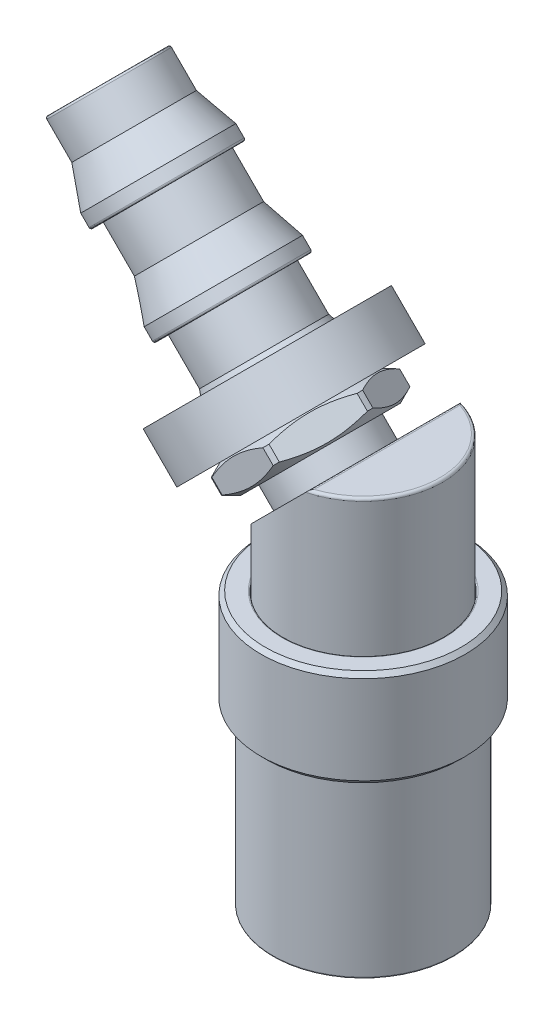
ISO-10303-21;
HEADER;
FILE_DESCRIPTION(('STEP AP214'),'2;1');
FILE_NAME('part.step','',(''),(''),'','','');
FILE_SCHEMA(('AUTOMOTIVE_DESIGN { 1 0 10303 214 1 1 1 1 }'));
ENDSEC;
DATA;
#1=APPLICATION_CONTEXT('core data for automotive mechanical design processes');
#2=APPLICATION_PROTOCOL_DEFINITION('international standard','automotive_design',2000,#1);
#3=PRODUCT_CONTEXT('',#1,'mechanical');
#4=PRODUCT('Part','Part','',(#3));
#5=PRODUCT_RELATED_PRODUCT_CATEGORY('part','',(#4));
#6=PRODUCT_DEFINITION_FORMATION('','',#4);
#7=PRODUCT_DEFINITION_CONTEXT('part definition',#1,'design');
#8=PRODUCT_DEFINITION('design','',#6,#7);
#9=PRODUCT_DEFINITION_SHAPE('','',#8);
#10=(LENGTH_UNIT() NAMED_UNIT(*) SI_UNIT(.MILLI.,.METRE.));
#11=(NAMED_UNIT(*) PLANE_ANGLE_UNIT() SI_UNIT($,.RADIAN.));
#12=(NAMED_UNIT(*) SI_UNIT($,.STERADIAN.) SOLID_ANGLE_UNIT());
#13=UNCERTAINTY_MEASURE_WITH_UNIT(LENGTH_MEASURE(1.E-05),#10,'distance_accuracy_value','');
#14=(GEOMETRIC_REPRESENTATION_CONTEXT(3) GLOBAL_UNCERTAINTY_ASSIGNED_CONTEXT((#13)) GLOBAL_UNIT_ASSIGNED_CONTEXT((#10,
#11,#12)) REPRESENTATION_CONTEXT('',''));
#15=CARTESIAN_POINT('',(0.,0.,0.));
#16=DIRECTION('',(0.,0.,1.));
#17=DIRECTION('',(1.,0.,0.));
#18=AXIS2_PLACEMENT_3D('',#15,#16,#17);
#19=CARTESIAN_POINT('',(0.691840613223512,30.1635704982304,-2.05799989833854E-13));
#20=DIRECTION('',(-0.707106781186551,0.707106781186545,0.));
#21=DIRECTION('',(0.707106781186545,0.707106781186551,0.));
#22=AXIS2_PLACEMENT_3D('',#19,#20,#21);
#23=CONICAL_SURFACE('',#22,4.445,0.785398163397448);
#24=CARTESIAN_POINT('',(0.506847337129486,30.3485637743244,-2.08383592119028E-13));
#25=DIRECTION('',(0.707106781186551,-0.707106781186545,0.));
#26=DIRECTION('',(-0.707106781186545,-0.707106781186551,0.));
#27=AXIS2_PLACEMENT_3D('',#24,#25,#26);
#28=CIRCLE('',#27,4.70662);
#29=CARTESIAN_POINT('',(3.8349302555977,33.6766466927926,-2.08959986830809E-13));
#30=VERTEX_POINT('',#29);
#31=CARTESIAN_POINT('',(-2.82123558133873,27.0204808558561,-2.07807197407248E-13));
#32=VERTEX_POINT('',#31);
#33=EDGE_CURVE('P0_E11',#30,#32,#28,.T.);
#34=ORIENTED_EDGE('',*,*,#33,.T.);
#35=DIRECTION('',(1.,0.,0.));
#36=VECTOR('',#35,1.);
#37=CARTESIAN_POINT('',(-2.45124902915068,27.0204808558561,-2.05255634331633E-13));
#38=LINE('',#37,#36);
#39=CARTESIAN_POINT('',(-2.09203878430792,27.0204808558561,-2.02778388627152E-13));
#40=VERTEX_POINT('',#39);
#41=EDGE_CURVE('P0_E27',#32,#40,#38,.T.);
#42=ORIENTED_EDGE('',*,*,#41,.T.);
#43=CARTESIAN_POINT('',(0.871445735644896,29.983965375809,-2.03291638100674E-13));
#44=DIRECTION('',(-0.707106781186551,0.707106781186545,0.));
#45=DIRECTION('',(0.707106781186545,0.707106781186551,0.));
#46=AXIS2_PLACEMENT_3D('',#43,#44,#45);
#47=CIRCLE('',#46,4.191);
#48=EDGE_CURVE('P0_E697',#40,#40,#47,.T.);
#49=ORIENTED_EDGE('',*,*,#48,.T.);
#50=ORIENTED_EDGE('',*,*,#41,.F.);
#51=CARTESIAN_POINT('',(0.506847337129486,30.3485637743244,-2.08383592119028E-13));
#52=DIRECTION('',(0.707106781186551,-0.707106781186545,0.));
#53=DIRECTION('',(-0.707106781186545,-0.707106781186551,0.));
#54=AXIS2_PLACEMENT_3D('',#51,#52,#53);
#55=CIRCLE('',#54,4.70662);
#56=EDGE_CURVE('P0_E638',#32,#30,#55,.T.);
#57=ORIENTED_EDGE('',*,*,#56,.T.);
#58=EDGE_LOOP('',(#34,#42,#49,#50,#57));
#59=FACE_BOUND('',#58,.T.);
#60=ADVANCED_FACE('P0_F16',(#59),#23,.T.);
#61=CARTESIAN_POINT('',(-2.45124902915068,26.6612706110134,-2.03291638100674E-13));
#62=DIRECTION('',(0.707106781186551,-0.707106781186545,0.));
#63=DIRECTION('',(0.707106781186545,0.707106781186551,0.));
#64=AXIS2_PLACEMENT_3D('',#61,#62,#63);
#65=PLANE('',#64);
#66=ORIENTED_EDGE('',*,*,#48,.F.);
#67=EDGE_LOOP('',(#66));
#68=FACE_BOUND('',#67,.T.);
#69=CARTESIAN_POINT('',(0.871445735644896,29.983965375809,-2.03291638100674E-13));
#70=DIRECTION('',(0.707106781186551,-0.707106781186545,0.));
#71=DIRECTION('',(0.707106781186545,0.707106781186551,0.));
#72=AXIS2_PLACEMENT_3D('',#69,#70,#71);
#73=CIRCLE('',#72,3.84204253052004);
#74=CARTESIAN_POINT('',(-1.84528859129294,27.2672310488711,-2.03997409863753E-13));
#75=VERTEX_POINT('',#74);
#76=CARTESIAN_POINT('',(3.58818006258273,32.7006997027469,-2.03762152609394E-13));
#77=VERTEX_POINT('',#76);
#78=EDGE_CURVE('P0_E593',#75,#77,#73,.T.);
#79=ORIENTED_EDGE('',*,*,#78,.F.);
#80=CARTESIAN_POINT('',(0.871445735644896,29.983965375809,-2.03291638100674E-13));
#81=DIRECTION('',(0.707106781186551,-0.707106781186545,0.));
#82=DIRECTION('',(0.707106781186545,0.707106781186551,0.));
#83=AXIS2_PLACEMENT_3D('',#80,#81,#82);
#84=CIRCLE('',#83,3.84204253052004);
#85=EDGE_CURVE('P0_E546',#77,#75,#84,.T.);
#86=ORIENTED_EDGE('',*,*,#85,.F.);
#87=EDGE_LOOP('',(#79,#86));
#88=FACE_BOUND('',#87,.T.);
#89=ADVANCED_FACE('P0_F862',(#68,#88),#65,.T.);
#90=CARTESIAN_POINT('',(-1.55322341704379,32.4086345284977,-2.37154386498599E-13));
#91=DIRECTION('',(-0.707106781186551,0.707106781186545,0.));
#92=DIRECTION('',(-0.707106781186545,-0.707106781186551,0.));
#93=AXIS2_PLACEMENT_3D('',#90,#91,#92);
#94=CYLINDRICAL_SURFACE('',#93,4.70662);
#95=CARTESIAN_POINT('',(-3.97789256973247,34.8333036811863,-2.71017134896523E-13));
#96=DIRECTION('',(-0.707106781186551,0.707106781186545,0.));
#97=DIRECTION('',(-0.707106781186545,-0.707106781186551,0.));
#98=AXIS2_PLACEMENT_3D('',#95,#96,#97);
#99=CIRCLE('',#98,4.70662);
#100=CARTESIAN_POINT('',(-0.649809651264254,38.1613865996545,-2.71593529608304E-13));
#101=VERTEX_POINT('',#100);
#102=EDGE_CURVE('P0_E395',#101,#101,#99,.T.);
#103=ORIENTED_EDGE('',*,*,#102,.F.);
#104=DIRECTION('',(0.707106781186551,-0.707106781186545,0.));
#105=VECTOR('',#104,1.);
#106=CARTESIAN_POINT('',(1.77485950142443,35.7367174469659,-2.37730781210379E-13));
#107=LINE('',#106,#105);
#108=EDGE_CURVE('P0_E631',#101,#30,#107,.T.);
#109=ORIENTED_EDGE('',*,*,#108,.T.);
#110=ORIENTED_EDGE('',*,*,#56,.F.);
#111=ORIENTED_EDGE('',*,*,#33,.F.);
#112=ORIENTED_EDGE('',*,*,#108,.F.);
#113=EDGE_LOOP('',(#103,#109,#110,#111,#112));
#114=FACE_BOUND('',#113,.T.);
#115=ADVANCED_FACE('P0_F867',(#114),#94,.T.);
#116=CARTESIAN_POINT('',(0.691840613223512,30.1635704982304,-2.05799989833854E-13));
#117=DIRECTION('',(-0.707106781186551,0.707106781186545,0.));
#118=DIRECTION('',(-0.707106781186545,-0.707106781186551,0.));
#119=AXIS2_PLACEMENT_3D('',#116,#117,#118);
#120=TOROIDAL_SURFACE('',#119,3.84204253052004,0.254);
#121=ORIENTED_EDGE('',*,*,#78,.T.);
#122=CARTESIAN_POINT('',(3.40857494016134,32.8803048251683,-2.06270504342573E-13));
#123=DIRECTION('',(0.,0.,-1.));
#124=DIRECTION('',(0.707106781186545,0.707106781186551,0.));
#125=AXIS2_PLACEMENT_3D('',#122,#123,#124);
#126=CIRCLE('',#125,0.254);
#127=CARTESIAN_POINT('',(3.22896981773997,32.7006997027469,-2.06239398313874E-13));
#128=VERTEX_POINT('',#127);
#129=EDGE_CURVE('P0_E580',#77,#128,#126,.T.);
#130=ORIENTED_EDGE('',*,*,#129,.T.);
#131=CARTESIAN_POINT('',(0.691840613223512,30.1635704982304,-2.05799989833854E-13));
#132=DIRECTION('',(-0.707106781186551,0.707106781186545,0.));
#133=DIRECTION('',(0.707106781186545,0.707106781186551,0.));
#134=AXIS2_PLACEMENT_3D('',#131,#132,#133);
#135=CIRCLE('',#134,3.58804253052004);
#136=CARTESIAN_POINT('',(-1.84528859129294,27.6264412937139,-2.05580285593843E-13));
#137=VERTEX_POINT('',#136);
#138=EDGE_CURVE('P0_E577',#128,#137,#135,.T.);
#139=ORIENTED_EDGE('',*,*,#138,.T.);
#140=CARTESIAN_POINT('',(0.691840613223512,30.1635704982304,-2.05799989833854E-13));
#141=DIRECTION('',(-0.707106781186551,0.707106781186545,0.));
#142=DIRECTION('',(0.707106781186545,0.707106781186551,0.));
#143=AXIS2_PLACEMENT_3D('',#140,#141,#142);
#144=CIRCLE('',#143,3.58804253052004);
#145=EDGE_CURVE('P0_E550',#137,#128,#144,.T.);
#146=ORIENTED_EDGE('',*,*,#145,.T.);
#147=ORIENTED_EDGE('',*,*,#129,.F.);
#148=ORIENTED_EDGE('',*,*,#85,.T.);
#149=EDGE_LOOP('',(#121,#130,#139,#146,#147,#148));
#150=FACE_BOUND('',#149,.T.);
#151=ADVANCED_FACE('P0_F910',(#150),#120,.T.);
#152=CARTESIAN_POINT('',(-11.4764505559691,42.3318616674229,-3.75741436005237E-13));
#153=DIRECTION('',(-0.707106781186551,0.707106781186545,0.));
#154=DIRECTION('',(-0.707106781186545,-0.707106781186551,0.));
#155=AXIS2_PLACEMENT_3D('',#152,#153,#154);
#156=CYLINDRICAL_SURFACE('',#155,3.58804253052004);
#157=CARTESIAN_POINT('',(-23.6986232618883,54.5540343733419,-5.46435387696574E-13));
#158=DIRECTION('',(0.707106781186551,-0.707106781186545,0.));
#159=DIRECTION('',(0.707106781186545,0.707106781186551,0.));
#160=AXIS2_PLACEMENT_3D('',#157,#158,#159);
#161=CIRCLE('',#160,3.58804253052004);
#162=CARTESIAN_POINT('',(-26.2357524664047,52.0169051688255,-5.47094500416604E-13));
#163=VERTEX_POINT('',#162);
#164=CARTESIAN_POINT('',(-21.1614940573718,57.0911635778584,-5.46874796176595E-13));
#165=VERTEX_POINT('',#164);
#166=EDGE_CURVE('P0_E492',#163,#165,#161,.T.);
#167=ORIENTED_EDGE('',*,*,#166,.F.);
#168=CARTESIAN_POINT('',(-23.6986232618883,54.5540343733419,-5.46435387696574E-13));
#169=DIRECTION('',(0.707106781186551,-0.707106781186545,0.));
#170=DIRECTION('',(0.707106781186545,0.707106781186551,0.));
#171=AXIS2_PLACEMENT_3D('',#168,#169,#170);
#172=CIRCLE('',#171,3.58804253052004);
#173=EDGE_CURVE('P0_E412',#165,#163,#172,.T.);
#174=ORIENTED_EDGE('',*,*,#173,.F.);
#175=DIRECTION('',(0.707106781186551,-0.707106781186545,0.));
#176=VECTOR('',#175,1.);
#177=CARTESIAN_POINT('',(-8.93932135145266,44.8689908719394,-3.76180844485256E-13));
#178=LINE('',#177,#176);
#179=EDGE_CURVE('P0_E495',#165,#128,#178,.T.);
#180=ORIENTED_EDGE('',*,*,#179,.T.);
#181=ORIENTED_EDGE('',*,*,#145,.F.);
#182=ORIENTED_EDGE('',*,*,#138,.F.);
#183=ORIENTED_EDGE('',*,*,#179,.F.);
#184=EDGE_LOOP('',(#167,#174,#180,#181,#182,#183));
#185=FACE_BOUND('',#184,.T.);
#186=ADVANCED_FACE('P0_F906',(#185),#156,.F.);
#187=CARTESIAN_POINT('',(-23.6986232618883,54.5540343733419,-5.46435387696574E-13));
#188=DIRECTION('',(-0.707106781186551,0.707106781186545,0.));
#189=DIRECTION('',(-0.707106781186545,-0.707106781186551,0.));
#190=AXIS2_PLACEMENT_3D('',#187,#188,#189);
#191=TOROIDAL_SURFACE('',#190,3.76584253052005,0.1778);
#192=ORIENTED_EDGE('',*,*,#166,.T.);
#193=CARTESIAN_POINT('',(-21.0357704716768,57.2168871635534,-5.46896570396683E-13));
#194=DIRECTION('',(0.,0.,-1.));
#195=DIRECTION('',(0.707106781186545,0.707106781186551,0.));
#196=AXIS2_PLACEMENT_3D('',#193,#194,#195);
#197=CIRCLE('',#196,0.1778);
#198=CARTESIAN_POINT('',(-21.1614940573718,57.3426107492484,-5.4865241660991E-13));
#199=VERTEX_POINT('',#198);
#200=EDGE_CURVE('P0_E496',#165,#199,#197,.T.);
#201=ORIENTED_EDGE('',*,*,#200,.T.);
#202=CARTESIAN_POINT('',(-23.8243468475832,54.6797579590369,-5.48191233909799E-13));
#203=DIRECTION('',(-0.707106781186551,0.707106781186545,0.));
#204=DIRECTION('',(0.707106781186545,0.707106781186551,0.));
#205=AXIS2_PLACEMENT_3D('',#202,#203,#204);
#206=CIRCLE('',#205,3.76584253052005);
#207=CARTESIAN_POINT('',(-26.4871996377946,52.0169051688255,-5.47960642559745E-13));
#208=VERTEX_POINT('',#207);
#209=EDGE_CURVE('P0_E411',#199,#208,#206,.T.);
#210=ORIENTED_EDGE('',*,*,#209,.T.);
#211=CARTESIAN_POINT('',(-23.8243468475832,54.6797579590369,-5.48191233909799E-13));
#212=DIRECTION('',(-0.707106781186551,0.707106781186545,0.));
#213=DIRECTION('',(0.707106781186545,0.707106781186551,0.));
#214=AXIS2_PLACEMENT_3D('',#211,#212,#213);
#215=CIRCLE('',#214,3.76584253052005);
#216=EDGE_CURVE('P0_E407',#208,#199,#215,.T.);
#217=ORIENTED_EDGE('',*,*,#216,.T.);
#218=ORIENTED_EDGE('',*,*,#200,.F.);
#219=ORIENTED_EDGE('',*,*,#173,.T.);
#220=EDGE_LOOP('',(#192,#201,#210,#217,#218,#219));
#221=FACE_BOUND('',#220,.T.);
#222=ADVANCED_FACE('P0_F909',(#221),#191,.T.);
#223=CARTESIAN_POINT('',(-26.3614760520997,52.1426287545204,-5.481912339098E-13));
#224=DIRECTION('',(-0.707106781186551,0.707106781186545,0.));
#225=DIRECTION('',(0.,0.,1.));
#226=AXIS2_PLACEMENT_3D('',#223,#224,#225);
#227=PLANE('',#226);
#228=CARTESIAN_POINT('',(-23.8243468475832,54.6797579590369,-5.48191233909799E-13));
#229=DIRECTION('',(0.707106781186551,-0.707106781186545,0.));
#230=DIRECTION('',(0.707106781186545,0.707106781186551,0.));
#231=AXIS2_PLACEMENT_3D('',#228,#229,#230);
#232=CIRCLE('',#231,4.57086113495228);
#233=CARTESIAN_POINT('',(-27.05643375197,51.4476710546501,-5.4903088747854E-13));
#234=VERTEX_POINT('',#233);
#235=CARTESIAN_POINT('',(-20.5922599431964,57.9118448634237,-5.48751002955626E-13));
#236=VERTEX_POINT('',#235);
#237=EDGE_CURVE('P0_E405',#234,#236,#232,.T.);
#238=ORIENTED_EDGE('',*,*,#237,.F.);
#239=CARTESIAN_POINT('',(-23.8243468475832,54.6797579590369,-5.48191233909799E-13));
#240=DIRECTION('',(0.707106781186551,-0.707106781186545,0.));
#241=DIRECTION('',(0.707106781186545,0.707106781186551,0.));
#242=AXIS2_PLACEMENT_3D('',#239,#240,#241);
#243=CIRCLE('',#242,4.57086113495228);
#244=EDGE_CURVE('P0_E372',#236,#234,#243,.T.);
#245=ORIENTED_EDGE('',*,*,#244,.F.);
#246=EDGE_LOOP('',(#238,#245));
#247=FACE_BOUND('',#246,.T.);
#248=ORIENTED_EDGE('',*,*,#216,.F.);
#249=ORIENTED_EDGE('',*,*,#209,.F.);
#250=EDGE_LOOP('',(#248,#249));
#251=FACE_BOUND('',#250,.T.);
#252=ADVANCED_FACE('P0_F889',(#247,#251),#227,.T.);
#253=CARTESIAN_POINT('',(-23.6986232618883,54.5540343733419,-5.46435387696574E-13));
#254=DIRECTION('',(-0.707106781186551,0.707106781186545,0.));
#255=DIRECTION('',(-0.707106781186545,-0.707106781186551,0.));
#256=AXIS2_PLACEMENT_3D('',#253,#254,#255);
#257=TOROIDAL_SURFACE('',#256,4.57086113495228,0.1778);
#258=ORIENTED_EDGE('',*,*,#237,.T.);
#259=CARTESIAN_POINT('',(-20.4665363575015,57.7861212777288,-5.469951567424E-13));
#260=DIRECTION('',(0.,0.,-1.));
#261=DIRECTION('',(0.707106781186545,0.707106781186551,0.));
#262=AXIS2_PLACEMENT_3D('',#259,#260,#261);
#263=CIRCLE('',#262,0.1778);
#264=CARTESIAN_POINT('',(-20.3408127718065,57.9118448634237,-5.4701693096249E-13));
#265=VERTEX_POINT('',#264);
#266=EDGE_CURVE('P0_E401',#236,#265,#263,.T.);
#267=ORIENTED_EDGE('',*,*,#266,.T.);
#268=CARTESIAN_POINT('',(-23.6986232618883,54.5540343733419,-5.46435387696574E-13));
#269=DIRECTION('',(-0.707106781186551,0.707106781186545,0.));
#270=DIRECTION('',(0.707106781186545,0.707106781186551,0.));
#271=AXIS2_PLACEMENT_3D('',#268,#269,#270);
#272=CIRCLE('',#271,4.74866113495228);
#273=CARTESIAN_POINT('',(-27.05643375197,51.1962238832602,-5.46144616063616E-13));
#274=VERTEX_POINT('',#273);
#275=EDGE_CURVE('P0_E406',#265,#274,#272,.T.);
#276=ORIENTED_EDGE('',*,*,#275,.T.);
#277=CARTESIAN_POINT('',(-23.6986232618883,54.5540343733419,-5.46435387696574E-13));
#278=DIRECTION('',(-0.707106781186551,0.707106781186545,0.));
#279=DIRECTION('',(0.707106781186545,0.707106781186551,0.));
#280=AXIS2_PLACEMENT_3D('',#277,#278,#279);
#281=CIRCLE('',#280,4.74866113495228);
#282=EDGE_CURVE('P0_E376',#274,#265,#281,.T.);
#283=ORIENTED_EDGE('',*,*,#282,.T.);
#284=ORIENTED_EDGE('',*,*,#266,.F.);
#285=ORIENTED_EDGE('',*,*,#244,.T.);
#286=EDGE_LOOP('',(#258,#267,#276,#283,#284,#285));
#287=FACE_BOUND('',#286,.T.);
#288=ADVANCED_FACE('P0_F882',(#287),#257,.T.);
#289=CARTESIAN_POINT('',(-22.6006211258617,53.4560322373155,-5.31100771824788E-13));
#290=DIRECTION('',(-0.707106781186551,0.707106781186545,0.));
#291=DIRECTION('',(-0.707106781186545,-0.707106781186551,0.));
#292=AXIS2_PLACEMENT_3D('',#289,#290,#291);
#293=CYLINDRICAL_SURFACE('',#292,4.74866113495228);
#294=ORIENTED_EDGE('',*,*,#282,.F.);
#295=ORIENTED_EDGE('',*,*,#275,.F.);
#296=DIRECTION('',(0.707106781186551,-0.707106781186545,0.));
#297=VECTOR('',#296,1.);
#298=CARTESIAN_POINT('',(-19.24281063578,56.8138427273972,-5.31682315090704E-13));
#299=LINE('',#298,#297);
#300=CARTESIAN_POINT('',(-18.0190849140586,55.5901170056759,-5.14591853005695E-13));
#301=VERTEX_POINT('',#300);
#302=EDGE_CURVE('P0_E377',#265,#301,#299,.T.);
#303=ORIENTED_EDGE('',*,*,#302,.T.);
#304=CARTESIAN_POINT('',(-21.3768954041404,52.2323065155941,-5.1401030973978E-13));
#305=DIRECTION('',(-0.707106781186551,0.707106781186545,0.));
#306=DIRECTION('',(0.,0.,1.));
#307=AXIS2_PLACEMENT_3D('',#304,#305,#306);
#308=CIRCLE('',#307,4.74866113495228);
#309=CARTESIAN_POINT('',(-24.7347058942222,48.8744960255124,-5.14010309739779E-13));
#310=VERTEX_POINT('',#309);
#311=EDGE_CURVE('P0_E75',#301,#310,#308,.T.);
#312=ORIENTED_EDGE('',*,*,#311,.T.);
#313=CARTESIAN_POINT('',(-21.3768954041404,52.2323065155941,-5.1401030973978E-13));
#314=DIRECTION('',(-0.707106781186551,0.707106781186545,0.));
#315=DIRECTION('',(0.,0.,1.));
#316=AXIS2_PLACEMENT_3D('',#313,#314,#315);
#317=CIRCLE('',#316,4.74866113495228);
#318=EDGE_CURVE('P0_E541',#310,#301,#317,.T.);
#319=ORIENTED_EDGE('',*,*,#318,.T.);
#320=ORIENTED_EDGE('',*,*,#302,.F.);
#321=EDGE_LOOP('',(#294,#295,#303,#312,#319,#320));
#322=FACE_BOUND('',#321,.T.);
#323=ADVANCED_FACE('P0_F879',(#322),#293,.T.);
#324=CARTESIAN_POINT('',(-7.04267802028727,37.8980891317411,-3.13819699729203E-13));
#325=DIRECTION('',(-0.707106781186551,0.707106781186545,0.));
#326=DIRECTION('',(-0.707106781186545,-0.707106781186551,0.));
#327=AXIS2_PLACEMENT_3D('',#324,#325,#326);
#328=TOROIDAL_SURFACE('',#327,5.30338938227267,0.1778);
#329=CARTESIAN_POINT('',(-7.04267802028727,37.8980891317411,-3.13819699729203E-13));
#330=DIRECTION('',(0.707106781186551,-0.707106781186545,0.));
#331=DIRECTION('',(0.707106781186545,0.707106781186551,0.));
#332=AXIS2_PLACEMENT_3D('',#329,#330,#331);
#333=CIRCLE('',#332,5.48118938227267);
#334=CARTESIAN_POINT('',(-10.91846420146,34.0223029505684,-3.14826577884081E-13));
#335=VERTEX_POINT('',#334);
#336=CARTESIAN_POINT('',(-3.16689183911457,41.7738753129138,-3.14490951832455E-13));
#337=VERTEX_POINT('',#336);
#338=EDGE_CURVE('P0_E555',#335,#337,#333,.T.);
#339=ORIENTED_EDGE('',*,*,#338,.T.);
#340=CARTESIAN_POINT('',(-3.29261542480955,41.6481517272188,-3.14469177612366E-13));
#341=DIRECTION('',(0.,0.,-1.));
#342=DIRECTION('',(0.707106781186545,0.707106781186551,0.));
#343=AXIS2_PLACEMENT_3D('',#340,#341,#342);
#344=CIRCLE('',#343,0.1778);
#345=CARTESIAN_POINT('',(-3.16689183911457,41.5224281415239,-3.1271333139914E-13));
#346=VERTEX_POINT('',#345);
#347=EDGE_CURVE('P0_E551',#337,#346,#344,.T.);
#348=ORIENTED_EDGE('',*,*,#347,.T.);
#349=CARTESIAN_POINT('',(-6.9169544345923,37.7723655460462,-3.12063853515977E-13));
#350=DIRECTION('',(-0.707106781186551,0.707106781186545,0.));
#351=DIRECTION('',(0.707106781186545,0.707106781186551,0.));
#352=AXIS2_PLACEMENT_3D('',#349,#350,#351);
#353=CIRCLE('',#352,5.30338938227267);
#354=CARTESIAN_POINT('',(-10.66701703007,34.0223029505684,-3.11739114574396E-13));
#355=VERTEX_POINT('',#354);
#356=EDGE_CURVE('P0_E556',#346,#355,#353,.T.);
#357=ORIENTED_EDGE('',*,*,#356,.T.);
#358=CARTESIAN_POINT('',(-6.9169544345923,37.7723655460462,-3.12063853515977E-13));
#359=DIRECTION('',(-0.707106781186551,0.707106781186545,0.));
#360=DIRECTION('',(0.707106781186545,0.707106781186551,0.));
#361=AXIS2_PLACEMENT_3D('',#358,#359,#360);
#362=CIRCLE('',#361,5.30338938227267);
#363=EDGE_CURVE('P0_E706',#355,#346,#362,.T.);
#364=ORIENTED_EDGE('',*,*,#363,.T.);
#365=ORIENTED_EDGE('',*,*,#347,.F.);
#366=CARTESIAN_POINT('',(-7.04267802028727,37.8980891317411,-3.13819699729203E-13));
#367=DIRECTION('',(0.707106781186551,-0.707106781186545,0.));
#368=DIRECTION('',(0.707106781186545,0.707106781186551,0.));
#369=AXIS2_PLACEMENT_3D('',#366,#367,#368);
#370=CIRCLE('',#369,5.48118938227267);
#371=EDGE_CURVE('P0_E90',#337,#335,#370,.T.);
#372=ORIENTED_EDGE('',*,*,#371,.T.);
#373=EDGE_LOOP('',(#339,#348,#357,#364,#365,#372));
#374=FACE_BOUND('',#373,.T.);
#375=ADVANCED_FACE('P0_F807',(#374),#328,.T.);
#376=CARTESIAN_POINT('',(-10.792740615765,33.8965793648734,-3.12063853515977E-13));
#377=DIRECTION('',(0.707106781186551,-0.707106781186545,0.));
#378=DIRECTION('',(0.707106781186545,0.707106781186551,0.));
#379=AXIS2_PLACEMENT_3D('',#376,#377,#378);
#380=PLANE('',#379);
#381=ORIENTED_EDGE('',*,*,#363,.F.);
#382=ORIENTED_EDGE('',*,*,#356,.F.);
#383=EDGE_LOOP('',(#381,#382));
#384=FACE_BOUND('',#383,.T.);
#385=CARTESIAN_POINT('',(-6.9169544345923,37.7723655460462,-3.12063853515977E-13));
#386=DIRECTION('',(-0.707106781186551,0.707106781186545,0.));
#387=DIRECTION('',(0.,0.,1.));
#388=AXIS2_PLACEMENT_3D('',#385,#386,#387);
#389=CIRCLE('',#388,4.98889364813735);
#390=CARTESIAN_POINT('',(-10.4446349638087,34.2446850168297,-3.12063853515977E-13));
#391=VERTEX_POINT('',#390);
#392=CARTESIAN_POINT('',(-3.3892739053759,41.3000460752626,-3.12674816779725E-13));
#393=VERTEX_POINT('',#392);
#394=EDGE_CURVE('P0_E445',#391,#393,#389,.T.);
#395=ORIENTED_EDGE('',*,*,#394,.T.);
#396=CARTESIAN_POINT('',(-6.9169544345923,37.7723655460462,-3.12063853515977E-13));
#397=DIRECTION('',(-0.707106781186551,0.707106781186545,0.));
#398=DIRECTION('',(0.,0.,1.));
#399=AXIS2_PLACEMENT_3D('',#396,#397,#398);
#400=CIRCLE('',#399,4.98889364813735);
#401=EDGE_CURVE('P0_E442',#393,#391,#400,.T.);
#402=ORIENTED_EDGE('',*,*,#401,.T.);
#403=EDGE_LOOP('',(#395,#402));
#404=FACE_BOUND('',#403,.T.);
#405=ADVANCED_FACE('P0_F809',(#384,#404),#380,.T.);
#406=CARTESIAN_POINT('',(-7.54557236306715,38.4009834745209,-3.20843084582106E-13));
#407=DIRECTION('',(-0.707106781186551,0.707106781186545,0.));
#408=DIRECTION('',(-0.707106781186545,-0.707106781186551,0.));
#409=AXIS2_PLACEMENT_3D('',#406,#407,#408);
#410=CYLINDRICAL_SURFACE('',#409,5.48118938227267);
#411=CARTESIAN_POINT('',(-8.17419029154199,39.0296014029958,-3.29622315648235E-13));
#412=DIRECTION('',(-0.707106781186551,0.707106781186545,0.));
#413=DIRECTION('',(0.,0.,1.));
#414=AXIS2_PLACEMENT_3D('',#411,#412,#413);
#415=CIRCLE('',#414,5.48118938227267);
#416=CARTESIAN_POINT('',(-12.0499764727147,35.1538152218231,-3.29622315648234E-13));
#417=VERTEX_POINT('',#416);
#418=CARTESIAN_POINT('',(-4.29840411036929,42.9053875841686,-3.30293567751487E-13));
#419=VERTEX_POINT('',#418);
#420=EDGE_CURVE('P0_E413',#417,#419,#415,.T.);
#421=ORIENTED_EDGE('',*,*,#420,.F.);
#422=CARTESIAN_POINT('',(-8.17419029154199,39.0296014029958,-3.29622315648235E-13));
#423=DIRECTION('',(-0.707106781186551,0.707106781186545,0.));
#424=DIRECTION('',(0.,0.,1.));
#425=AXIS2_PLACEMENT_3D('',#422,#423,#424);
#426=CIRCLE('',#425,5.48118938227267);
#427=EDGE_CURVE('P0_E417',#419,#417,#426,.T.);
#428=ORIENTED_EDGE('',*,*,#427,.F.);
#429=DIRECTION('',(0.707106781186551,-0.707106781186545,0.));
#430=VECTOR('',#429,1.);
#431=CARTESIAN_POINT('',(-3.66978618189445,42.2767696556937,-3.21514336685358E-13));
#432=LINE('',#431,#430);
#433=EDGE_CURVE('P0_E446',#419,#337,#432,.T.);
#434=ORIENTED_EDGE('',*,*,#433,.T.);
#435=ORIENTED_EDGE('',*,*,#338,.F.);
#436=ORIENTED_EDGE('',*,*,#371,.F.);
#437=ORIENTED_EDGE('',*,*,#433,.F.);
#438=EDGE_LOOP('',(#421,#428,#434,#435,#436,#437));
#439=FACE_BOUND('',#438,.T.);
#440=ADVANCED_FACE('P0_F812',(#439),#410,.T.);
#441=CARTESIAN_POINT('',(-12.2757374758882,43.131148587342,-3.86904217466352E-13));
#442=DIRECTION('',(-0.707106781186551,0.707106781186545,0.));
#443=DIRECTION('',(-0.707106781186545,-0.707106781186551,0.));
#444=AXIS2_PLACEMENT_3D('',#441,#442,#443);
#445=TOROIDAL_SURFACE('',#444,5.85622861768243,0.1778);
#446=CARTESIAN_POINT('',(-12.2757374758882,43.131148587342,-3.86904217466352E-13));
#447=DIRECTION('',(0.707106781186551,-0.707106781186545,0.));
#448=DIRECTION('',(0.707106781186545,0.707106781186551,0.));
#449=AXIS2_PLACEMENT_3D('',#446,#447,#448);
#450=CIRCLE('',#449,6.03402861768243);
#451=CARTESIAN_POINT('',(-16.5424400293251,38.864446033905,-3.88012650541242E-13));
#452=VERTEX_POINT('',#451);
#453=CARTESIAN_POINT('',(-8.00903492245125,47.3978511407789,-3.87643172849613E-13));
#454=VERTEX_POINT('',#453);
#455=EDGE_CURVE('P0_E545',#452,#454,#450,.T.);
#456=ORIENTED_EDGE('',*,*,#455,.T.);
#457=CARTESIAN_POINT('',(-8.13475850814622,47.272127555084,-3.87621398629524E-13));
#458=DIRECTION('',(0.,0.,-1.));
#459=DIRECTION('',(0.707106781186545,0.707106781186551,0.));
#460=AXIS2_PLACEMENT_3D('',#457,#458,#459);
#461=CIRCLE('',#460,0.1778);
#462=CARTESIAN_POINT('',(-8.00903492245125,47.146403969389,-3.85865552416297E-13));
#463=VERTEX_POINT('',#462);
#464=EDGE_CURVE('P0_E694',#454,#463,#461,.T.);
#465=ORIENTED_EDGE('',*,*,#464,.T.);
#466=CARTESIAN_POINT('',(-12.1500138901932,43.005425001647,-3.85148371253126E-13));
#467=DIRECTION('',(-0.707106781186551,0.707106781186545,0.));
#468=DIRECTION('',(0.707106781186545,0.707106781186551,0.));
#469=AXIS2_PLACEMENT_3D('',#466,#467,#468);
#470=CIRCLE('',#469,5.85622861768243);
#471=CARTESIAN_POINT('',(-16.2909928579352,38.864446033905,-3.8478978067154E-13));
#472=VERTEX_POINT('',#471);
#473=EDGE_CURVE('P0_E648',#463,#472,#470,.T.);
#474=ORIENTED_EDGE('',*,*,#473,.T.);
#475=CARTESIAN_POINT('',(-12.1500138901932,43.005425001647,-3.85148371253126E-13));
#476=DIRECTION('',(-0.707106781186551,0.707106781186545,0.));
#477=DIRECTION('',(0.707106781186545,0.707106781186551,0.));
#478=AXIS2_PLACEMENT_3D('',#475,#476,#477);
#479=CIRCLE('',#478,5.85622861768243);
#480=EDGE_CURVE('P0_E394',#472,#463,#479,.T.);
#481=ORIENTED_EDGE('',*,*,#480,.T.);
#482=ORIENTED_EDGE('',*,*,#464,.F.);
#483=CARTESIAN_POINT('',(-12.2757374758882,43.131148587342,-3.86904217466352E-13));
#484=DIRECTION('',(0.707106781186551,-0.707106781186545,0.));
#485=DIRECTION('',(0.707106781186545,0.707106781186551,0.));
#486=AXIS2_PLACEMENT_3D('',#483,#484,#485);
#487=CIRCLE('',#486,6.03402861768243);
#488=EDGE_CURVE('P0_E390',#454,#452,#487,.T.);
#489=ORIENTED_EDGE('',*,*,#488,.T.);
#490=EDGE_LOOP('',(#456,#465,#474,#481,#482,#489));
#491=FACE_BOUND('',#490,.T.);
#492=ADVANCED_FACE('P0_F849',(#491),#445,.T.);
#493=CARTESIAN_POINT('',(-16.4167164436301,38.73872244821,-3.85148371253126E-13));
#494=DIRECTION('',(0.707106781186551,-0.707106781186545,0.));
#495=DIRECTION('',(0.707106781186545,0.707106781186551,0.));
#496=AXIS2_PLACEMENT_3D('',#493,#494,#495);
#497=PLANE('',#496);
#498=ORIENTED_EDGE('',*,*,#480,.F.);
#499=ORIENTED_EDGE('',*,*,#473,.F.);
#500=EDGE_LOOP('',(#498,#499));
#501=FACE_BOUND('',#500,.T.);
#502=CARTESIAN_POINT('',(-12.1500138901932,43.005425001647,-3.85148371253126E-13));
#503=DIRECTION('',(-0.707106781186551,0.707106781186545,0.));
#504=DIRECTION('',(0.,0.,1.));
#505=AXIS2_PLACEMENT_3D('',#502,#503,#504);
#506=CIRCLE('',#505,4.92247644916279);
#507=CARTESIAN_POINT('',(-15.6307303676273,39.5247085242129,-3.85148371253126E-13));
#508=VERTEX_POINT('',#507);
#509=CARTESIAN_POINT('',(-8.66929741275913,46.4861414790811,-3.8575120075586E-13));
#510=VERTEX_POINT('',#509);
#511=EDGE_CURVE('P0_E388',#508,#510,#506,.T.);
#512=ORIENTED_EDGE('',*,*,#511,.T.);
#513=CARTESIAN_POINT('',(-12.1500138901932,43.005425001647,-3.85148371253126E-13));
#514=DIRECTION('',(-0.707106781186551,0.707106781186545,0.));
#515=DIRECTION('',(0.,0.,1.));
#516=AXIS2_PLACEMENT_3D('',#513,#514,#515);
#517=CIRCLE('',#516,4.92247644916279);
#518=EDGE_CURVE('P0_E384',#510,#508,#517,.T.);
#519=ORIENTED_EDGE('',*,*,#518,.T.);
#520=EDGE_LOOP('',(#512,#519));
#521=FACE_BOUND('',#520,.T.);
#522=ADVANCED_FACE('P0_F18',(#501,#521),#497,.T.);
#523=CARTESIAN_POINT('',(-12.5990266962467,43.4544378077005,-3.91419250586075E-13));
#524=DIRECTION('',(-0.707106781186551,0.707106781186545,0.));
#525=DIRECTION('',(-0.707106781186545,-0.707106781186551,0.));
#526=AXIS2_PLACEMENT_3D('',#523,#524,#525);
#527=CYLINDRICAL_SURFACE('',#526,6.03402861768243);
#528=CARTESIAN_POINT('',(-13.0480395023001,43.9034506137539,-3.97690129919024E-13));
#529=DIRECTION('',(-0.707106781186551,0.707106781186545,0.));
#530=DIRECTION('',(0.,0.,1.));
#531=AXIS2_PLACEMENT_3D('',#528,#529,#530);
#532=CIRCLE('',#531,6.03402861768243);
#533=CARTESIAN_POINT('',(-17.3147420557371,39.636748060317,-3.97690129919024E-13));
#534=VERTEX_POINT('',#533);
#535=CARTESIAN_POINT('',(-8.7813369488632,48.1701531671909,-3.98429085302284E-13));
#536=VERTEX_POINT('',#535);
#537=EDGE_CURVE('P0_E585',#534,#536,#532,.T.);
#538=ORIENTED_EDGE('',*,*,#537,.F.);
#539=CARTESIAN_POINT('',(-13.0480395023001,43.9034506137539,-3.97690129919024E-13));
#540=DIRECTION('',(-0.707106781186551,0.707106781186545,0.));
#541=DIRECTION('',(0.,0.,1.));
#542=AXIS2_PLACEMENT_3D('',#539,#540,#541);
#543=CIRCLE('',#542,6.03402861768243);
#544=EDGE_CURVE('P0_E20',#536,#534,#543,.T.);
#545=ORIENTED_EDGE('',*,*,#544,.F.);
#546=DIRECTION('',(0.707106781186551,-0.707106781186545,0.));
#547=VECTOR('',#546,1.);
#548=CARTESIAN_POINT('',(-8.33232414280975,47.7211403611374,-3.92158205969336E-13));
#549=LINE('',#548,#547);
#550=EDGE_CURVE('P0_E389',#536,#454,#549,.T.);
#551=ORIENTED_EDGE('',*,*,#550,.T.);
#552=ORIENTED_EDGE('',*,*,#455,.F.);
#553=ORIENTED_EDGE('',*,*,#488,.F.);
#554=ORIENTED_EDGE('',*,*,#550,.F.);
#555=EDGE_LOOP('',(#538,#545,#551,#552,#553,#554));
#556=FACE_BOUND('',#555,.T.);
#557=ADVANCED_FACE('P0_F848',(#556),#527,.T.);
#558=CARTESIAN_POINT('',(-18.346390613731,49.2018017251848,-4.71686506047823E-13));
#559=DIRECTION('',(-0.707106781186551,0.707106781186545,0.));
#560=DIRECTION('',(-0.707106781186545,-0.707106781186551,0.));
#561=AXIS2_PLACEMENT_3D('',#558,#559,#560);
#562=TOROIDAL_SURFACE('',#561,5.73322955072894,0.1778);
#563=CARTESIAN_POINT('',(-18.346390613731,49.2018017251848,-4.71686506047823E-13));
#564=DIRECTION('',(0.707106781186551,-0.707106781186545,0.));
#565=DIRECTION('',(0.707106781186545,0.707106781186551,0.));
#566=AXIS2_PLACEMENT_3D('',#563,#564,#565);
#567=CIRCLE('',#566,5.91102955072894);
#568=CARTESIAN_POINT('',(-22.5261196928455,45.0220726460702,-4.72772344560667E-13));
#569=VERTEX_POINT('',#568);
#570=CARTESIAN_POINT('',(-14.1666615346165,53.3815308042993,-4.72410398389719E-13));
#571=VERTEX_POINT('',#570);
#572=EDGE_CURVE('P0_E517',#569,#571,#567,.T.);
#573=ORIENTED_EDGE('',*,*,#572,.T.);
#574=CARTESIAN_POINT('',(-14.2923851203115,53.2558072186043,-4.7238862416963E-13));
#575=DIRECTION('',(0.,0.,-1.));
#576=DIRECTION('',(0.707106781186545,0.707106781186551,0.));
#577=AXIS2_PLACEMENT_3D('',#574,#575,#576);
#578=CIRCLE('',#577,0.1778);
#579=CARTESIAN_POINT('',(-14.1666615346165,53.1300836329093,-4.70632777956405E-13));
#580=VERTEX_POINT('',#579);
#581=EDGE_CURVE('P0_E524',#571,#580,#578,.T.);
#582=ORIENTED_EDGE('',*,*,#581,.T.);
#583=CARTESIAN_POINT('',(-18.2206670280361,49.0760781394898,-4.69930659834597E-13));
#584=DIRECTION('',(-0.707106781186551,0.707106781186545,0.));
#585=DIRECTION('',(0.707106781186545,0.707106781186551,0.));
#586=AXIS2_PLACEMENT_3D('',#583,#584,#585);
#587=CIRCLE('',#586,5.73322955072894);
#588=CARTESIAN_POINT('',(-22.2746725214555,45.0220726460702,-4.69579600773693E-13));
#589=VERTEX_POINT('',#588);
#590=EDGE_CURVE('P0_E624',#580,#589,#587,.T.);
#591=ORIENTED_EDGE('',*,*,#590,.T.);
#592=CARTESIAN_POINT('',(-18.2206670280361,49.0760781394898,-4.69930659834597E-13));
#593=DIRECTION('',(-0.707106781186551,0.707106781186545,0.));
#594=DIRECTION('',(0.707106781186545,0.707106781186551,0.));
#595=AXIS2_PLACEMENT_3D('',#592,#593,#594);
#596=CIRCLE('',#595,5.73322955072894);
#597=EDGE_CURVE('P0_E620',#589,#580,#596,.T.);
#598=ORIENTED_EDGE('',*,*,#597,.T.);
#599=ORIENTED_EDGE('',*,*,#581,.F.);
#600=CARTESIAN_POINT('',(-18.346390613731,49.2018017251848,-4.71686506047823E-13));
#601=DIRECTION('',(0.707106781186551,-0.707106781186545,0.));
#602=DIRECTION('',(0.707106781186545,0.707106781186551,0.));
#603=AXIS2_PLACEMENT_3D('',#600,#601,#602);
#604=CIRCLE('',#603,5.91102955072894);
#605=EDGE_CURVE('P0_E480',#571,#569,#604,.T.);
#606=ORIENTED_EDGE('',*,*,#605,.T.);
#607=EDGE_LOOP('',(#573,#582,#591,#598,#599,#606));
#608=FACE_BOUND('',#607,.T.);
#609=ADVANCED_FACE('P0_F856',(#608),#562,.T.);
#610=CARTESIAN_POINT('',(-22.4003961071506,44.8963490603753,-4.69930659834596E-13));
#611=DIRECTION('',(0.707106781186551,-0.707106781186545,0.));
#612=DIRECTION('',(0.707106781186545,0.707106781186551,0.));
#613=AXIS2_PLACEMENT_3D('',#610,#611,#612);
#614=PLANE('',#613);
#615=ORIENTED_EDGE('',*,*,#597,.F.);
#616=ORIENTED_EDGE('',*,*,#590,.F.);
#617=EDGE_LOOP('',(#615,#616));
#618=FACE_BOUND('',#617,.T.);
#619=CARTESIAN_POINT('',(-18.2206670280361,49.0760781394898,-4.69930659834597E-13));
#620=DIRECTION('',(-0.707106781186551,0.707106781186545,0.));
#621=DIRECTION('',(0.,0.,1.));
#622=AXIS2_PLACEMENT_3D('',#619,#620,#621);
#623=CIRCLE('',#622,4.92247644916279);
#624=CARTESIAN_POINT('',(-21.7013835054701,45.5953616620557,-4.69930659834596E-13));
#625=VERTEX_POINT('',#624);
#626=CARTESIAN_POINT('',(-14.739950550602,52.5567946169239,-4.70533489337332E-13));
#627=VERTEX_POINT('',#626);
#628=EDGE_CURVE('P0_E371',#625,#627,#623,.T.);
#629=ORIENTED_EDGE('',*,*,#628,.T.);
#630=CARTESIAN_POINT('',(-18.2206670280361,49.0760781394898,-4.69930659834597E-13));
#631=DIRECTION('',(-0.707106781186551,0.707106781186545,0.));
#632=DIRECTION('',(0.,0.,1.));
#633=AXIS2_PLACEMENT_3D('',#630,#631,#632);
#634=CIRCLE('',#633,4.92247644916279);
#635=EDGE_CURVE('P0_E368',#627,#625,#634,.T.);
#636=ORIENTED_EDGE('',*,*,#635,.T.);
#637=EDGE_LOOP('',(#629,#636));
#638=FACE_BOUND('',#637,.T.);
#639=ADVANCED_FACE('P0_F904',(#618,#638),#614,.T.);
#640=CARTESIAN_POINT('',(-18.6696798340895,49.5250909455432,-4.76201539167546E-13));
#641=DIRECTION('',(-0.707106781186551,0.707106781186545,0.));
#642=DIRECTION('',(-0.707106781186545,-0.707106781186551,0.));
#643=AXIS2_PLACEMENT_3D('',#640,#641,#642);
#644=CYLINDRICAL_SURFACE('',#643,5.91102955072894);
#645=CARTESIAN_POINT('',(-19.118692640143,49.9741037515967,-4.82472418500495E-13));
#646=DIRECTION('',(-0.707106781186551,0.707106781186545,0.));
#647=DIRECTION('',(0.,0.,1.));
#648=AXIS2_PLACEMENT_3D('',#645,#646,#647);
#649=CIRCLE('',#648,5.91102955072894);
#650=CARTESIAN_POINT('',(-23.2984217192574,45.7943746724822,-4.82472418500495E-13));
#651=VERTEX_POINT('',#650);
#652=CARTESIAN_POINT('',(-14.9389635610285,54.1538328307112,-4.83196310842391E-13));
#653=VERTEX_POINT('',#652);
#654=EDGE_CURVE('P0_E454',#651,#653,#649,.T.);
#655=ORIENTED_EDGE('',*,*,#654,.F.);
#656=CARTESIAN_POINT('',(-19.118692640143,49.9741037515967,-4.82472418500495E-13));
#657=DIRECTION('',(-0.707106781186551,0.707106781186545,0.));
#658=DIRECTION('',(0.,0.,1.));
#659=AXIS2_PLACEMENT_3D('',#656,#657,#658);
#660=CIRCLE('',#659,5.91102955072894);
#661=EDGE_CURVE('P0_E460',#653,#651,#660,.T.);
#662=ORIENTED_EDGE('',*,*,#661,.F.);
#663=DIRECTION('',(0.707106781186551,-0.707106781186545,0.));
#664=VECTOR('',#663,1.);
#665=CARTESIAN_POINT('',(-14.489950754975,53.7048200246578,-4.76925431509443E-13));
#666=LINE('',#665,#664);
#667=EDGE_CURVE('P0_E351',#653,#571,#666,.T.);
#668=ORIENTED_EDGE('',*,*,#667,.T.);
#669=ORIENTED_EDGE('',*,*,#572,.F.);
#670=ORIENTED_EDGE('',*,*,#605,.F.);
#671=ORIENTED_EDGE('',*,*,#667,.F.);
#672=EDGE_LOOP('',(#655,#662,#668,#669,#670,#671));
#673=FACE_BOUND('',#672,.T.);
#674=ADVANCED_FACE('P0_F925',(#673),#644,.T.);
#675=CARTESIAN_POINT('',(-4.31330755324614,24.7992120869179,-2.04904930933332E-13));
#676=DIRECTION('',(0.612372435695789,0.612372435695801,0.5));
#677=DIRECTION('',(0.707106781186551,-0.707106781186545,0.));
#678=AXIS2_PLACEMENT_3D('',#675,#676,#677);
#679=PLANE('',#678);
#680=CARTESIAN_POINT('',(-8.08619413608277,33.5464618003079,-6.09232573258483));
#681=CARTESIAN_POINT('',(-9.92167236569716,32.9999535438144,-3.1750000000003));
#682=CARTESIAN_POINT('',(-10.4681806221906,31.1644753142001,-0.25767426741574));
#683=(BOUNDED_CURVE() B_SPLINE_CURVE(2,(#680,#681,#682),.UNSPECIFIED.,.F.,
.F.) B_SPLINE_CURVE_WITH_KNOTS((3,3),(0.,0.680644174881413),
.UNSPECIFIED.) CURVE() GEOMETRIC_REPRESENTATION_ITEM() RATIONAL_B_SPLINE_CURVE((1.,1.132,1.)) REPRESENTATION_ITEM(''));
#684=CARTESIAN_POINT('',(-8.08619413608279,33.5464618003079,-6.09232573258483));
#685=VERTEX_POINT('',#684);
#686=CARTESIAN_POINT('',(-10.4681806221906,31.1644753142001,-0.257674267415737));
#687=VERTEX_POINT('',#686);
#688=EDGE_CURVE('P0_E337',#685,#687,#683,.T.);
#689=ORIENTED_EDGE('',*,*,#688,.F.);
#690=DIRECTION('',(-0.707106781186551,0.707106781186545,0.));
#691=VECTOR('',#690,1.);
#692=CARTESIAN_POINT('',(-7.58821934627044,33.0484870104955,-6.09232573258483));
#693=LINE('',#692,#691);
#694=CARTESIAN_POINT('',(-7.12447709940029,32.5847447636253,-6.09232573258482));
#695=VERTEX_POINT('',#694);
#696=EDGE_CURVE('P0_E331',#695,#685,#693,.T.);
#697=ORIENTED_EDGE('',*,*,#696,.F.);
#698=CARTESIAN_POINT('',(-9.50646358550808,30.2027582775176,-0.257674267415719));
#699=CARTESIAN_POINT('',(-7.67098535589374,30.749266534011,-3.17500000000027));
#700=CARTESIAN_POINT('',(-7.12447709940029,32.5847447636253,-6.09232573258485));
#701=(BOUNDED_CURVE() B_SPLINE_CURVE(2,(#698,#699,#700),.UNSPECIFIED.,.F.,
.F.) B_SPLINE_CURVE_WITH_KNOTS((3,3),(0.,0.680644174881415),
.UNSPECIFIED.) CURVE() GEOMETRIC_REPRESENTATION_ITEM() RATIONAL_B_SPLINE_CURVE((1.,1.132,1.)) REPRESENTATION_ITEM(''));
#702=CARTESIAN_POINT('',(-9.50646358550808,30.2027582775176,-0.257674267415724));
#703=VERTEX_POINT('',#702);
#704=EDGE_CURVE('P0_E334',#703,#695,#701,.T.);
#705=ORIENTED_EDGE('',*,*,#704,.F.);
#706=DIRECTION('',(0.707106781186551,-0.707106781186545,0.));
#707=VECTOR('',#706,1.);
#708=CARTESIAN_POINT('',(-9.97020583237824,30.6665005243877,-0.25767426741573));
#709=LINE('',#708,#707);
#710=EDGE_CURVE('P0_E325',#687,#703,#709,.T.);
#711=ORIENTED_EDGE('',*,*,#710,.F.);
#712=EDGE_LOOP('',(#689,#697,#705,#711));
#713=FACE_BOUND('',#712,.T.);
#714=ADVANCED_FACE('P0_F333',(#713),#679,.F.);
#715=CARTESIAN_POINT('',(-1.72093090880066,27.3915887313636,6.34999999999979));
#716=DIRECTION('',(0.612372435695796,0.612372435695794,-0.5));
#717=DIRECTION('',(-0.353553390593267,-0.353553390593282,-0.866025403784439));
#718=AXIS2_PLACEMENT_3D('',#715,#716,#717);
#719=PLANE('',#718);
#720=CARTESIAN_POINT('',(-10.4681806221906,31.1644753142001,0.257674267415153));
#721=CARTESIAN_POINT('',(-9.92167236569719,32.9999535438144,3.1749999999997));
#722=CARTESIAN_POINT('',(-8.08619413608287,33.546461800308,6.09232573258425));
#723=(BOUNDED_CURVE() B_SPLINE_CURVE(2,(#720,#721,#722),.UNSPECIFIED.,.F.,
.F.) B_SPLINE_CURVE_WITH_KNOTS((3,3),(0.,0.680644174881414),
.UNSPECIFIED.) CURVE() GEOMETRIC_REPRESENTATION_ITEM() RATIONAL_B_SPLINE_CURVE((1.,1.132,1.)) REPRESENTATION_ITEM(''));
#724=CARTESIAN_POINT('',(-10.4681806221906,31.1644753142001,0.257674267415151));
#725=VERTEX_POINT('',#724);
#726=CARTESIAN_POINT('',(-8.08619413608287,33.546461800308,6.09232573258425));
#727=VERTEX_POINT('',#726);
#728=EDGE_CURVE('P0_E619',#725,#727,#723,.T.);
#729=ORIENTED_EDGE('',*,*,#728,.F.);
#730=DIRECTION('',(-0.707106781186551,0.707106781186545,0.));
#731=VECTOR('',#730,1.);
#732=CARTESIAN_POINT('',(-9.97020583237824,30.6665005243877,0.257674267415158));
#733=LINE('',#732,#731);
#734=CARTESIAN_POINT('',(-9.50646358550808,30.2027582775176,0.257674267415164));
#735=VERTEX_POINT('',#734);
#736=EDGE_CURVE('P0_E399',#735,#725,#733,.T.);
#737=ORIENTED_EDGE('',*,*,#736,.F.);
#738=CARTESIAN_POINT('',(-7.12447709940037,32.5847447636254,6.09232573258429));
#739=CARTESIAN_POINT('',(-7.67098535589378,30.749266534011,3.17499999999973));
#740=CARTESIAN_POINT('',(-9.50646358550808,30.2027582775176,0.257674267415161));
#741=(BOUNDED_CURVE() B_SPLINE_CURVE(2,(#738,#739,#740),.UNSPECIFIED.,.F.,
.F.) B_SPLINE_CURVE_WITH_KNOTS((3,3),(0.,0.680644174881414),
.UNSPECIFIED.) CURVE() GEOMETRIC_REPRESENTATION_ITEM() RATIONAL_B_SPLINE_CURVE((1.,1.132,1.)) REPRESENTATION_ITEM(''));
#742=CARTESIAN_POINT('',(-7.12447709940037,32.5847447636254,6.09232573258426));
#743=VERTEX_POINT('',#742);
#744=EDGE_CURVE('P0_E625',#743,#735,#741,.T.);
#745=ORIENTED_EDGE('',*,*,#744,.F.);
#746=DIRECTION('',(0.707106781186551,-0.707106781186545,0.));
#747=VECTOR('',#746,1.);
#748=CARTESIAN_POINT('',(-7.58821934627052,33.0484870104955,6.09232573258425));
#749=LINE('',#748,#747);
#750=EDGE_CURVE('P0_E534',#727,#743,#749,.T.);
#751=ORIENTED_EDGE('',*,*,#750,.F.);
#752=EDGE_LOOP('',(#729,#737,#745,#751));
#753=FACE_BOUND('',#752,.T.);
#754=ADVANCED_FACE('P0_F746',(#753),#719,.F.);
#755=CARTESIAN_POINT('',(3.46382238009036,32.5763420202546,6.3499999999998));
#756=DIRECTION('',(0.,0.,-1.));
#757=DIRECTION('',(-0.707106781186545,-0.707106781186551,0.));
#758=AXIS2_PLACEMENT_3D('',#755,#756,#757);
#759=PLANE('',#758);
#760=CARTESIAN_POINT('',(-7.77060889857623,33.8620470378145,6.34999999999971));
#761=CARTESIAN_POINT('',(-6.03310739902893,36.8885185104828,6.3499999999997));
#762=CARTESIAN_POINT('',(-3.00663592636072,38.6260200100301,6.34999999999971));
#763=(BOUNDED_CURVE() B_SPLINE_CURVE(2,(#760,#761,#762),.UNSPECIFIED.,.F.,
.F.) B_SPLINE_CURVE_WITH_KNOTS((3,3),(0.,0.680644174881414),
.UNSPECIFIED.) CURVE() GEOMETRIC_REPRESENTATION_ITEM() RATIONAL_B_SPLINE_CURVE((1.,1.132,1.)) REPRESENTATION_ITEM(''));
#764=CARTESIAN_POINT('',(-7.77060889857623,33.8620470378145,6.34999999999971));
#765=VERTEX_POINT('',#764);
#766=CARTESIAN_POINT('',(-3.00663592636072,38.6260200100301,6.34999999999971));
#767=VERTEX_POINT('',#766);
#768=EDGE_CURVE('P0_E424',#765,#767,#763,.T.);
#769=ORIENTED_EDGE('',*,*,#768,.F.);
#770=DIRECTION('',(-0.707106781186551,0.707106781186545,0.));
#771=VECTOR('',#770,1.);
#772=CARTESIAN_POINT('',(-7.27263410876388,33.3640722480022,6.34999999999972));
#773=LINE('',#772,#771);
#774=CARTESIAN_POINT('',(-6.80889186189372,32.9003300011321,6.34999999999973));
#775=VERTEX_POINT('',#774);
#776=EDGE_CURVE('P0_E530',#775,#765,#773,.T.);
#777=ORIENTED_EDGE('',*,*,#776,.F.);
#778=CARTESIAN_POINT('',(-2.04491888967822,37.6643029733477,6.34999999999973));
#779=CARTESIAN_POINT('',(-3.78242038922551,34.6378315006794,6.34999999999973));
#780=CARTESIAN_POINT('',(-6.80889186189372,32.9003300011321,6.34999999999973));
#781=(BOUNDED_CURVE() B_SPLINE_CURVE(2,(#778,#779,#780),.UNSPECIFIED.,.F.,
.F.) B_SPLINE_CURVE_WITH_KNOTS((3,3),(0.,0.680644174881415),
.UNSPECIFIED.) CURVE() GEOMETRIC_REPRESENTATION_ITEM() RATIONAL_B_SPLINE_CURVE((1.,1.132,1.)) REPRESENTATION_ITEM(''));
#782=CARTESIAN_POINT('',(-2.04491888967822,37.6643029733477,6.34999999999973));
#783=VERTEX_POINT('',#782);
#784=EDGE_CURVE('P0_E383',#783,#775,#781,.T.);
#785=ORIENTED_EDGE('',*,*,#784,.F.);
#786=DIRECTION('',(0.707106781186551,-0.707106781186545,0.));
#787=VECTOR('',#786,1.);
#788=CARTESIAN_POINT('',(-2.50866113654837,38.1280452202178,6.34999999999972));
#789=LINE('',#788,#787);
#790=EDGE_CURVE('P0_E419',#767,#783,#789,.T.);
#791=ORIENTED_EDGE('',*,*,#790,.F.);
#792=EDGE_LOOP('',(#769,#777,#785,#791));
#793=FACE_BOUND('',#792,.T.);
#794=ADVANCED_FACE('P0_F883',(#793),#759,.F.);
#795=CARTESIAN_POINT('',(6.05619902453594,35.1687186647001,-2.04471250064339E-13));
#796=DIRECTION('',(-0.612372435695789,-0.612372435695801,-0.5));
#797=DIRECTION('',(-0.707106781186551,0.707106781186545,0.));
#798=AXIS2_PLACEMENT_3D('',#795,#796,#797);
#799=PLANE('',#798);
#800=CARTESIAN_POINT('',(-2.69105068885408,38.9416052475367,6.09232573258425));
#801=CARTESIAN_POINT('',(-2.14454243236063,40.7770834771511,3.1749999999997));
#802=CARTESIAN_POINT('',(-0.309064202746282,41.3235917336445,0.25767426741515));
#803=(BOUNDED_CURVE() B_SPLINE_CURVE(2,(#800,#801,#802),.UNSPECIFIED.,.F.,
.F.) B_SPLINE_CURVE_WITH_KNOTS((3,3),(0.,0.680644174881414),
.UNSPECIFIED.) CURVE() GEOMETRIC_REPRESENTATION_ITEM() RATIONAL_B_SPLINE_CURVE((1.,1.132,1.)) REPRESENTATION_ITEM(''));
#804=CARTESIAN_POINT('',(-2.69105068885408,38.9416052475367,6.09232573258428));
#805=VERTEX_POINT('',#804);
#806=CARTESIAN_POINT('',(-0.309064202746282,41.3235917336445,0.25767426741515));
#807=VERTEX_POINT('',#806);
#808=EDGE_CURVE('P0_E448',#805,#807,#803,.T.);
#809=ORIENTED_EDGE('',*,*,#808,.F.);
#810=DIRECTION('',(-0.707106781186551,0.707106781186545,0.));
#811=VECTOR('',#810,1.);
#812=CARTESIAN_POINT('',(-2.19307589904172,38.4436304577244,6.09232573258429));
#813=LINE('',#812,#811);
#814=CARTESIAN_POINT('',(-1.72933365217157,37.9798882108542,6.09232573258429));
#815=VERTEX_POINT('',#814);
#816=EDGE_CURVE('P0_E423',#815,#805,#813,.T.);
#817=ORIENTED_EDGE('',*,*,#816,.F.);
#818=CARTESIAN_POINT('',(0.652652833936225,40.361874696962,0.257674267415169));
#819=CARTESIAN_POINT('',(0.106144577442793,38.5263964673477,3.17499999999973));
#820=CARTESIAN_POINT('',(-1.72933365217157,37.9798882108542,6.09232573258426));
#821=(BOUNDED_CURVE() B_SPLINE_CURVE(2,(#818,#819,#820),.UNSPECIFIED.,.F.,
.F.) B_SPLINE_CURVE_WITH_KNOTS((3,3),(0.,0.680644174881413),
.UNSPECIFIED.) CURVE() GEOMETRIC_REPRESENTATION_ITEM() RATIONAL_B_SPLINE_CURVE((1.,1.132,1.)) REPRESENTATION_ITEM(''));
#822=CARTESIAN_POINT('',(0.652652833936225,40.361874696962,0.257674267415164));
#823=VERTEX_POINT('',#822);
#824=EDGE_CURVE('P0_E382',#823,#815,#821,.T.);
#825=ORIENTED_EDGE('',*,*,#824,.F.);
#826=DIRECTION('',(0.707106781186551,-0.707106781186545,0.));
#827=VECTOR('',#826,1.);
#828=CARTESIAN_POINT('',(0.188910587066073,40.8256169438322,0.257674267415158));
#829=LINE('',#828,#827);
#830=EDGE_CURVE('P0_E473',#807,#823,#829,.T.);
#831=ORIENTED_EDGE('',*,*,#830,.F.);
#832=EDGE_LOOP('',(#809,#817,#825,#831));
#833=FACE_BOUND('',#832,.T.);
#834=ADVANCED_FACE('P0_F877',(#833),#799,.F.);
#835=CARTESIAN_POINT('',(3.46382238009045,32.5763420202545,-6.3500000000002));
#836=DIRECTION('',(-0.612372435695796,-0.612372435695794,0.5));
#837=DIRECTION('',(0.707106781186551,-0.707106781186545,0.));
#838=AXIS2_PLACEMENT_3D('',#835,#836,#837);
#839=PLANE('',#838);
#840=CARTESIAN_POINT('',(-0.309064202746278,41.3235917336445,-0.257674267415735));
#841=CARTESIAN_POINT('',(-2.14454243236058,40.777083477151,-3.1750000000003));
#842=CARTESIAN_POINT('',(-2.69105068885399,38.9416052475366,-6.09232573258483));
#843=(BOUNDED_CURVE() B_SPLINE_CURVE(2,(#840,#841,#842),.UNSPECIFIED.,.F.,
.F.) B_SPLINE_CURVE_WITH_KNOTS((3,3),(0.,0.680644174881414),
.UNSPECIFIED.) CURVE() GEOMETRIC_REPRESENTATION_ITEM() RATIONAL_B_SPLINE_CURVE((1.,1.132,1.)) REPRESENTATION_ITEM(''));
#844=CARTESIAN_POINT('',(-0.309064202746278,41.3235917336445,-0.257674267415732));
#845=VERTEX_POINT('',#844);
#846=CARTESIAN_POINT('',(-2.69105068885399,38.9416052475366,-6.09232573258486));
#847=VERTEX_POINT('',#846);
#848=EDGE_CURVE('P0_E511',#845,#847,#843,.T.);
#849=ORIENTED_EDGE('',*,*,#848,.F.);
#850=DIRECTION('',(-0.707106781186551,0.707106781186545,0.));
#851=VECTOR('',#850,1.);
#852=CARTESIAN_POINT('',(0.188910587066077,40.8256169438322,-0.257674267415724));
#853=LINE('',#852,#851);
#854=CARTESIAN_POINT('',(0.652652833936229,40.361874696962,-0.257674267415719));
#855=VERTEX_POINT('',#854);
#856=EDGE_CURVE('P0_E422',#855,#845,#853,.T.);
#857=ORIENTED_EDGE('',*,*,#856,.F.);
#858=CARTESIAN_POINT('',(-1.72933365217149,37.9798882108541,-6.09232573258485));
#859=CARTESIAN_POINT('',(0.106144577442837,38.5263964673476,-3.17500000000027));
#860=CARTESIAN_POINT('',(0.652652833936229,40.361874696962,-0.257674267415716));
#861=(BOUNDED_CURVE() B_SPLINE_CURVE(2,(#858,#859,#860),.UNSPECIFIED.,.F.,
.F.) B_SPLINE_CURVE_WITH_KNOTS((3,3),(0.,0.680644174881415),
.UNSPECIFIED.) CURVE() GEOMETRIC_REPRESENTATION_ITEM() RATIONAL_B_SPLINE_CURVE((1.,1.132,1.)) REPRESENTATION_ITEM(''));
#862=CARTESIAN_POINT('',(-1.72933365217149,37.9798882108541,-6.09232573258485));
#863=VERTEX_POINT('',#862);
#864=EDGE_CURVE('P0_E491',#863,#855,#861,.T.);
#865=ORIENTED_EDGE('',*,*,#864,.F.);
#866=DIRECTION('',(0.707106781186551,-0.707106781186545,0.));
#867=VECTOR('',#866,1.);
#868=CARTESIAN_POINT('',(-2.19307589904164,38.4436304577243,-6.09232573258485));
#869=LINE('',#868,#867);
#870=EDGE_CURVE('P0_E472',#847,#863,#869,.T.);
#871=ORIENTED_EDGE('',*,*,#870,.F.);
#872=EDGE_LOOP('',(#849,#857,#865,#871));
#873=FACE_BOUND('',#872,.T.);
#874=ADVANCED_FACE('P0_F873',(#873),#839,.F.);
#875=CARTESIAN_POINT('',(-1.72093090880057,27.3915887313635,-6.35000000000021));
#876=DIRECTION('',(0.,0.,1.));
#877=DIRECTION('',(-0.707106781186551,0.707106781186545,0.));
#878=AXIS2_PLACEMENT_3D('',#875,#876,#877);
#879=PLANE('',#878);
#880=CARTESIAN_POINT('',(-3.00663592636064,38.62602001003,-6.35000000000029));
#881=CARTESIAN_POINT('',(-6.03310739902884,36.8885185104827,-6.3500000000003));
#882=CARTESIAN_POINT('',(-7.77060889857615,33.8620470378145,-6.35000000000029));
#883=(BOUNDED_CURVE() B_SPLINE_CURVE(2,(#880,#881,#882),.UNSPECIFIED.,.F.,
.F.) B_SPLINE_CURVE_WITH_KNOTS((3,3),(0.,0.680644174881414),
.UNSPECIFIED.) CURVE() GEOMETRIC_REPRESENTATION_ITEM() RATIONAL_B_SPLINE_CURVE((1.,1.132,1.)) REPRESENTATION_ITEM(''));
#884=CARTESIAN_POINT('',(-3.00663592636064,38.62602001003,-6.35000000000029));
#885=VERTEX_POINT('',#884);
#886=CARTESIAN_POINT('',(-7.77060889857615,33.8620470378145,-6.35000000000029));
#887=VERTEX_POINT('',#886);
#888=EDGE_CURVE('P0_E122',#885,#887,#883,.T.);
#889=ORIENTED_EDGE('',*,*,#888,.F.);
#890=DIRECTION('',(-0.707106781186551,0.707106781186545,0.));
#891=VECTOR('',#890,1.);
#892=CARTESIAN_POINT('',(-2.50866113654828,38.1280452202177,-6.35000000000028));
#893=LINE('',#892,#891);
#894=CARTESIAN_POINT('',(-2.04491888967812,37.6643029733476,-6.35000000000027));
#895=VERTEX_POINT('',#894);
#896=EDGE_CURVE('P0_E135',#895,#885,#893,.T.);
#897=ORIENTED_EDGE('',*,*,#896,.F.);
#898=CARTESIAN_POINT('',(-6.80889186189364,32.9003300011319,-6.35000000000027));
#899=CARTESIAN_POINT('',(-3.78242038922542,34.6378315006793,-6.35000000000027));
#900=CARTESIAN_POINT('',(-2.04491888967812,37.6643029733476,-6.35000000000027));
#901=(BOUNDED_CURVE() B_SPLINE_CURVE(2,(#898,#899,#900),.UNSPECIFIED.,.F.,
.F.) B_SPLINE_CURVE_WITH_KNOTS((3,3),(0.,0.680644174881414),
.UNSPECIFIED.) CURVE() GEOMETRIC_REPRESENTATION_ITEM() RATIONAL_B_SPLINE_CURVE((1.,1.132,1.)) REPRESENTATION_ITEM(''));
#902=CARTESIAN_POINT('',(-6.80889186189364,32.9003300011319,-6.35000000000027));
#903=VERTEX_POINT('',#902);
#904=EDGE_CURVE('P0_E355',#903,#895,#901,.T.);
#905=ORIENTED_EDGE('',*,*,#904,.F.);
#906=DIRECTION('',(0.707106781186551,-0.707106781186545,0.));
#907=VECTOR('',#906,1.);
#908=CARTESIAN_POINT('',(-7.2726341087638,33.3640722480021,-6.35000000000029));
#909=LINE('',#908,#907);
#910=EDGE_CURVE('P0_E344',#887,#903,#909,.T.);
#911=ORIENTED_EDGE('',*,*,#910,.F.);
#912=EDGE_LOOP('',(#889,#897,#905,#911));
#913=FACE_BOUND('',#912,.T.);
#914=ADVANCED_FACE('P0_F876',(#913),#879,.F.);
#915=CARTESIAN_POINT('',(-4.2023989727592,35.0578100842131,-2.74152574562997E-13));
#916=DIRECTION('',(-0.707106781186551,0.707106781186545,0.));
#917=DIRECTION('',(0.707106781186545,0.707106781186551,0.));
#918=AXIS2_PLACEMENT_3D('',#915,#916,#917);
#919=CONICAL_SURFACE('',#918,6.63827386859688,1.0471975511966);
#920=ORIENTED_EDGE('',*,*,#704,.T.);
#921=CARTESIAN_POINT('',(-4.42690537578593,35.2823164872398,-2.77288014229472E-13));
#922=DIRECTION('',(0.707106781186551,-0.707106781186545,0.));
#923=DIRECTION('',(0.707106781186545,0.707106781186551,0.));
#924=AXIS2_PLACEMENT_3D('',#921,#922,#923);
#925=CIRCLE('',#924,7.1882);
#926=EDGE_CURVE('P0_E349',#695,#903,#925,.T.);
#927=ORIENTED_EDGE('',*,*,#926,.T.);
#928=ORIENTED_EDGE('',*,*,#904,.T.);
#929=CARTESIAN_POINT('',(-4.42690537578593,35.2823164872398,-2.77288014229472E-13));
#930=DIRECTION('',(0.707106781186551,-0.707106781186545,0.));
#931=DIRECTION('',(0.707106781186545,0.707106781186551,0.));
#932=AXIS2_PLACEMENT_3D('',#929,#930,#931);
#933=CIRCLE('',#932,7.1882);
#934=EDGE_CURVE('P0_E361',#895,#863,#933,.T.);
#935=ORIENTED_EDGE('',*,*,#934,.T.);
#936=ORIENTED_EDGE('',*,*,#864,.T.);
#937=CARTESIAN_POINT('',(-4.42690537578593,35.2823164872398,-2.77288014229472E-13));
#938=DIRECTION('',(0.707106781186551,-0.707106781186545,0.));
#939=DIRECTION('',(0.707106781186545,0.707106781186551,0.));
#940=AXIS2_PLACEMENT_3D('',#937,#938,#939);
#941=CIRCLE('',#940,7.1882);
#942=EDGE_CURVE('P0_E487',#855,#823,#941,.T.);
#943=ORIENTED_EDGE('',*,*,#942,.T.);
#944=ORIENTED_EDGE('',*,*,#824,.T.);
#945=CARTESIAN_POINT('',(-4.42690537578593,35.2823164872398,-2.77288014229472E-13));
#946=DIRECTION('',(0.707106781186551,-0.707106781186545,0.));
#947=DIRECTION('',(0.707106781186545,0.707106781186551,0.));
#948=AXIS2_PLACEMENT_3D('',#945,#946,#947);
#949=CIRCLE('',#948,7.1882);
#950=EDGE_CURVE('P0_E378',#815,#783,#949,.T.);
#951=ORIENTED_EDGE('',*,*,#950,.T.);
#952=ORIENTED_EDGE('',*,*,#784,.T.);
#953=CARTESIAN_POINT('',(-4.42690537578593,35.2823164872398,-2.77288014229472E-13));
#954=DIRECTION('',(0.707106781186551,-0.707106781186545,0.));
#955=DIRECTION('',(0.707106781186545,0.707106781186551,0.));
#956=AXIS2_PLACEMENT_3D('',#953,#954,#955);
#957=CIRCLE('',#956,7.1882);
#958=EDGE_CURVE('P0_E562',#775,#743,#957,.T.);
#959=ORIENTED_EDGE('',*,*,#958,.T.);
#960=ORIENTED_EDGE('',*,*,#744,.T.);
#961=CARTESIAN_POINT('',(-4.42690537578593,35.2823164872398,-2.77288014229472E-13));
#962=DIRECTION('',(0.707106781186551,-0.707106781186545,0.));
#963=DIRECTION('',(0.707106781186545,0.707106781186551,0.));
#964=AXIS2_PLACEMENT_3D('',#961,#962,#963);
#965=CIRCLE('',#964,7.1882);
#966=CARTESIAN_POINT('',(-9.50973034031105,30.1994915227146,-2.76407713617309E-13));
#967=VERTEX_POINT('',#966);
#968=EDGE_CURVE('P0_E502',#735,#967,#965,.T.);
#969=ORIENTED_EDGE('',*,*,#968,.T.);
#970=DIRECTION('',(0.965925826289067,0.258819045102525,0.));
#971=VECTOR('',#970,1.);
#972=CARTESIAN_POINT('',(-8.89636744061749,30.3638416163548,-2.73339620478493E-13));
#973=LINE('',#972,#971);
#974=CARTESIAN_POINT('',(-8.28300454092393,30.5281917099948,-2.70271527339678E-13));
#975=VERTEX_POINT('',#974);
#976=EDGE_CURVE('P0_E498',#967,#975,#973,.T.);
#977=ORIENTED_EDGE('',*,*,#976,.T.);
#978=CARTESIAN_POINT('',(-3.97789256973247,34.8333036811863,-2.71017134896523E-13));
#979=DIRECTION('',(-0.707106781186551,0.707106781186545,0.));
#980=DIRECTION('',(0.707106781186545,0.707106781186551,0.));
#981=AXIS2_PLACEMENT_3D('',#978,#979,#980);
#982=CIRCLE('',#981,6.08834773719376);
#983=EDGE_CURVE('P0_E503',#975,#975,#982,.T.);
#984=ORIENTED_EDGE('',*,*,#983,.T.);
#985=ORIENTED_EDGE('',*,*,#976,.F.);
#986=CARTESIAN_POINT('',(-4.42690537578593,35.2823164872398,-2.77288014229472E-13));
#987=DIRECTION('',(0.707106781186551,-0.707106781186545,0.));
#988=DIRECTION('',(0.707106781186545,0.707106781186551,0.));
#989=AXIS2_PLACEMENT_3D('',#986,#987,#988);
#990=CIRCLE('',#989,7.1882);
#991=EDGE_CURVE('P0_E343',#967,#703,#990,.T.);
#992=ORIENTED_EDGE('',*,*,#991,.T.);
#993=EDGE_LOOP('',(#920,#927,#928,#935,#936,#943,#944,#951,#952,#959,#960,#969,#977,#984,#985,#992));
#994=FACE_BOUND('',#993,.T.);
#995=ADVANCED_FACE('P0_F348',(#994),#919,.T.);
#996=CARTESIAN_POINT('',(-4.89064762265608,35.74605873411,-2.83764603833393E-13));
#997=DIRECTION('',(-0.707106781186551,0.707106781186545,0.));
#998=DIRECTION('',(-0.707106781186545,-0.707106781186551,0.));
#999=AXIS2_PLACEMENT_3D('',#996,#997,#998);
#1000=CYLINDRICAL_SURFACE('',#999,7.1882);
#1001=ORIENTED_EDGE('',*,*,#696,.T.);
#1002=CARTESIAN_POINT('',(-5.38862241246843,36.2440335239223,-2.90719282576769E-13));
#1003=DIRECTION('',(-0.707106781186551,0.707106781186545,0.));
#1004=DIRECTION('',(0.707106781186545,0.707106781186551,0.));
#1005=AXIS2_PLACEMENT_3D('',#1002,#1003,#1004);
#1006=CIRCLE('',#1005,7.1882);
#1007=EDGE_CURVE('P0_E465',#887,#685,#1006,.T.);
#1008=ORIENTED_EDGE('',*,*,#1007,.F.);
#1009=ORIENTED_EDGE('',*,*,#910,.T.);
#1010=ORIENTED_EDGE('',*,*,#926,.F.);
#1011=EDGE_LOOP('',(#1001,#1008,#1009,#1010));
#1012=FACE_BOUND('',#1011,.T.);
#1013=ADVANCED_FACE('P0_F353',(#1012),#1000,.T.);
#1014=CARTESIAN_POINT('',(-4.89064762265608,35.74605873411,-2.83764603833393E-13));
#1015=DIRECTION('',(-0.707106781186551,0.707106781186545,0.));
#1016=DIRECTION('',(-0.707106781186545,-0.707106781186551,0.));
#1017=AXIS2_PLACEMENT_3D('',#1014,#1015,#1016);
#1018=CYLINDRICAL_SURFACE('',#1017,7.1882);
#1019=ORIENTED_EDGE('',*,*,#870,.T.);
#1020=ORIENTED_EDGE('',*,*,#934,.F.);
#1021=ORIENTED_EDGE('',*,*,#896,.T.);
#1022=CARTESIAN_POINT('',(-5.38862241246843,36.2440335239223,-2.90719282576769E-13));
#1023=DIRECTION('',(-0.707106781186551,0.707106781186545,0.));
#1024=DIRECTION('',(0.707106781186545,0.707106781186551,0.));
#1025=AXIS2_PLACEMENT_3D('',#1022,#1023,#1024);
#1026=CIRCLE('',#1025,7.1882);
#1027=EDGE_CURVE('P0_E516',#847,#885,#1026,.T.);
#1028=ORIENTED_EDGE('',*,*,#1027,.F.);
#1029=EDGE_LOOP('',(#1019,#1020,#1021,#1028));
#1030=FACE_BOUND('',#1029,.T.);
#1031=ADVANCED_FACE('P0_F895',(#1030),#1018,.T.);
#1032=CARTESIAN_POINT('',(-4.89064762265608,35.74605873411,-2.83764603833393E-13));
#1033=DIRECTION('',(-0.707106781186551,0.707106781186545,0.));
#1034=DIRECTION('',(0.707106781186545,0.707106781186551,0.));
#1035=AXIS2_PLACEMENT_3D('',#1032,#1033,#1034);
#1036=CYLINDRICAL_SURFACE('',#1035,7.1882);
#1037=ORIENTED_EDGE('',*,*,#830,.T.);
#1038=ORIENTED_EDGE('',*,*,#942,.F.);
#1039=ORIENTED_EDGE('',*,*,#856,.T.);
#1040=CARTESIAN_POINT('',(-5.38862241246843,36.2440335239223,-2.90719282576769E-13));
#1041=DIRECTION('',(-0.707106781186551,0.707106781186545,0.));
#1042=DIRECTION('',(0.707106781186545,0.707106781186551,0.));
#1043=AXIS2_PLACEMENT_3D('',#1040,#1041,#1042);
#1044=CIRCLE('',#1043,7.1882);
#1045=EDGE_CURVE('P0_E453',#807,#845,#1044,.T.);
#1046=ORIENTED_EDGE('',*,*,#1045,.F.);
#1047=EDGE_LOOP('',(#1037,#1038,#1039,#1046));
#1048=FACE_BOUND('',#1047,.T.);
#1049=ADVANCED_FACE('P0_F891',(#1048),#1036,.T.);
#1050=CARTESIAN_POINT('',(-4.89064762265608,35.74605873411,-2.83764603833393E-13));
#1051=DIRECTION('',(-0.707106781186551,0.707106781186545,0.));
#1052=DIRECTION('',(-0.707106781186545,-0.707106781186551,0.));
#1053=AXIS2_PLACEMENT_3D('',#1050,#1051,#1052);
#1054=CYLINDRICAL_SURFACE('',#1053,7.1882);
#1055=ORIENTED_EDGE('',*,*,#790,.T.);
#1056=ORIENTED_EDGE('',*,*,#950,.F.);
#1057=ORIENTED_EDGE('',*,*,#816,.T.);
#1058=CARTESIAN_POINT('',(-5.38862241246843,36.2440335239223,-2.90719282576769E-13));
#1059=DIRECTION('',(-0.707106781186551,0.707106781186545,0.));
#1060=DIRECTION('',(0.707106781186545,0.707106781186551,0.));
#1061=AXIS2_PLACEMENT_3D('',#1058,#1059,#1060);
#1062=CIRCLE('',#1061,7.1882);
#1063=EDGE_CURVE('P0_E429',#767,#805,#1062,.T.);
#1064=ORIENTED_EDGE('',*,*,#1063,.F.);
#1065=EDGE_LOOP('',(#1055,#1056,#1057,#1064));
#1066=FACE_BOUND('',#1065,.T.);
#1067=ADVANCED_FACE('P0_F894',(#1066),#1054,.T.);
#1068=CARTESIAN_POINT('',(-4.89064762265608,35.74605873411,-2.83764603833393E-13));
#1069=DIRECTION('',(-0.707106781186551,0.707106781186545,0.));
#1070=DIRECTION('',(-0.707106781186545,-0.707106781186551,0.));
#1071=AXIS2_PLACEMENT_3D('',#1068,#1069,#1070);
#1072=CYLINDRICAL_SURFACE('',#1071,7.1882);
#1073=ORIENTED_EDGE('',*,*,#750,.T.);
#1074=ORIENTED_EDGE('',*,*,#958,.F.);
#1075=ORIENTED_EDGE('',*,*,#776,.T.);
#1076=CARTESIAN_POINT('',(-5.38862241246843,36.2440335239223,-2.90719282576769E-13));
#1077=DIRECTION('',(-0.707106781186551,0.707106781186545,0.));
#1078=DIRECTION('',(0.707106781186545,0.707106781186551,0.));
#1079=AXIS2_PLACEMENT_3D('',#1076,#1077,#1078);
#1080=CIRCLE('',#1079,7.1882);
#1081=EDGE_CURVE('P0_E428',#727,#765,#1080,.T.);
#1082=ORIENTED_EDGE('',*,*,#1081,.F.);
#1083=EDGE_LOOP('',(#1073,#1074,#1075,#1082));
#1084=FACE_BOUND('',#1083,.T.);
#1085=ADVANCED_FACE('P0_F914',(#1084),#1072,.T.);
#1086=CARTESIAN_POINT('',(-5.59601254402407,36.4514236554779,-2.93615677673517E-13));
#1087=DIRECTION('',(0.707106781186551,-0.707106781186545,0.));
#1088=DIRECTION('',(0.707106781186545,0.707106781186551,0.));
#1089=AXIS2_PLACEMENT_3D('',#1086,#1087,#1088);
#1090=CONICAL_SURFACE('',#1089,6.6802,1.0471975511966);
#1091=CARTESIAN_POINT('',(-5.80340267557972,36.6588137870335,-2.96512072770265E-13));
#1092=DIRECTION('',(0.707106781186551,-0.707106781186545,0.));
#1093=DIRECTION('',(0.707106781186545,0.707106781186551,0.));
#1094=AXIS2_PLACEMENT_3D('',#1091,#1092,#1093);
#1095=CIRCLE('',#1094,6.1722);
#1096=CARTESIAN_POINT('',(-10.1678071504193,32.2944093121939,-2.97267949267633E-13));
#1097=VERTEX_POINT('',#1096);
#1098=EDGE_CURVE('P0_E535',#1097,#1097,#1095,.T.);
#1099=ORIENTED_EDGE('',*,*,#1098,.T.);
#1100=DIRECTION('',(-0.258819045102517,-0.96592582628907,0.));
#1101=VECTOR('',#1100,1.);
#1102=CARTESIAN_POINT('',(-10.3196272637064,31.7278089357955,-2.9279758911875E-13));
#1103=LINE('',#1102,#1101);
#1104=CARTESIAN_POINT('',(-10.4714473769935,31.1612085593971,-2.89838981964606E-13));
#1105=VERTEX_POINT('',#1104);
#1106=EDGE_CURVE('P0_E618',#1097,#1105,#1103,.T.);
#1107=ORIENTED_EDGE('',*,*,#1106,.T.);
#1108=CARTESIAN_POINT('',(-5.38862241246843,36.2440335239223,-2.90719282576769E-13));
#1109=DIRECTION('',(-0.707106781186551,0.707106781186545,0.));
#1110=DIRECTION('',(0.707106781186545,0.707106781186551,0.));
#1111=AXIS2_PLACEMENT_3D('',#1108,#1109,#1110);
#1112=CIRCLE('',#1111,7.1882);
#1113=EDGE_CURVE('P0_E614',#1105,#725,#1112,.T.);
#1114=ORIENTED_EDGE('',*,*,#1113,.T.);
#1115=ORIENTED_EDGE('',*,*,#728,.T.);
#1116=ORIENTED_EDGE('',*,*,#1081,.T.);
#1117=ORIENTED_EDGE('',*,*,#768,.T.);
#1118=ORIENTED_EDGE('',*,*,#1063,.T.);
#1119=ORIENTED_EDGE('',*,*,#808,.T.);
#1120=ORIENTED_EDGE('',*,*,#1045,.T.);
#1121=ORIENTED_EDGE('',*,*,#848,.T.);
#1122=ORIENTED_EDGE('',*,*,#1027,.T.);
#1123=ORIENTED_EDGE('',*,*,#888,.T.);
#1124=ORIENTED_EDGE('',*,*,#1007,.T.);
#1125=ORIENTED_EDGE('',*,*,#688,.T.);
#1126=CARTESIAN_POINT('',(-5.38862241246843,36.2440335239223,-2.90719282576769E-13));
#1127=DIRECTION('',(-0.707106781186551,0.707106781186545,0.));
#1128=DIRECTION('',(0.707106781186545,0.707106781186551,0.));
#1129=AXIS2_PLACEMENT_3D('',#1126,#1127,#1128);
#1130=CIRCLE('',#1129,7.1882);
#1131=EDGE_CURVE('P0_E466',#687,#1105,#1130,.T.);
#1132=ORIENTED_EDGE('',*,*,#1131,.T.);
#1133=ORIENTED_EDGE('',*,*,#1106,.F.);
#1134=EDGE_LOOP('',(#1099,#1107,#1114,#1115,#1116,#1117,#1118,#1119,#1120,#1121,#1122,#1123,
#1124,#1125,#1132,#1133));
#1135=FACE_BOUND('',#1134,.T.);
#1136=ADVANCED_FACE('P0_F754',(#1135),#1090,.T.);
#1137=CARTESIAN_POINT('',(-4.89064762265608,35.74605873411,-2.83764603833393E-13));
#1138=DIRECTION('',(-0.707106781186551,0.707106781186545,0.));
#1139=DIRECTION('',(-0.707106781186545,-0.707106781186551,0.));
#1140=AXIS2_PLACEMENT_3D('',#1137,#1138,#1139);
#1141=CYLINDRICAL_SURFACE('',#1140,7.1882);
#1142=ORIENTED_EDGE('',*,*,#710,.T.);
#1143=ORIENTED_EDGE('',*,*,#991,.F.);
#1144=ORIENTED_EDGE('',*,*,#968,.F.);
#1145=ORIENTED_EDGE('',*,*,#736,.T.);
#1146=ORIENTED_EDGE('',*,*,#1113,.F.);
#1147=ORIENTED_EDGE('',*,*,#1131,.F.);
#1148=EDGE_LOOP('',(#1142,#1143,#1144,#1145,#1146,#1147));
#1149=FACE_BOUND('',#1148,.T.);
#1150=ADVANCED_FACE('P0_F742',(#1149),#1141,.T.);
#1151=CARTESIAN_POINT('',(-9.33108320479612,33.1311332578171,-2.96512072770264E-13));
#1152=DIRECTION('',(-0.707106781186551,0.707106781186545,0.));
#1153=DIRECTION('',(0.,0.,1.));
#1154=AXIS2_PLACEMENT_3D('',#1151,#1152,#1153);
#1155=PLANE('',#1154);
#1156=ORIENTED_EDGE('',*,*,#1098,.F.);
#1157=EDGE_LOOP('',(#1156));
#1158=FACE_BOUND('',#1157,.T.);
#1159=CARTESIAN_POINT('',(-5.80340267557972,36.6588137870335,-2.96512072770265E-13));
#1160=DIRECTION('',(-0.707106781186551,0.707106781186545,0.));
#1161=DIRECTION('',(0.,0.,1.));
#1162=AXIS2_PLACEMENT_3D('',#1159,#1160,#1161);
#1163=CIRCLE('',#1162,4.98889364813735);
#1164=CARTESIAN_POINT('',(-9.33108320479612,33.1311332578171,-2.96512072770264E-13));
#1165=VERTEX_POINT('',#1164);
#1166=CARTESIAN_POINT('',(-2.27572214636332,40.18649431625,-2.97123036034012E-13));
#1167=VERTEX_POINT('',#1166);
#1168=EDGE_CURVE('P0_E576',#1165,#1167,#1163,.T.);
#1169=ORIENTED_EDGE('',*,*,#1168,.F.);
#1170=CARTESIAN_POINT('',(-5.80340267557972,36.6588137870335,-2.96512072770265E-13));
#1171=DIRECTION('',(-0.707106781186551,0.707106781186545,0.));
#1172=DIRECTION('',(0.,0.,1.));
#1173=AXIS2_PLACEMENT_3D('',#1170,#1171,#1172);
#1174=CIRCLE('',#1173,4.98889364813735);
#1175=EDGE_CURVE('P0_E597',#1167,#1165,#1174,.T.);
#1176=ORIENTED_EDGE('',*,*,#1175,.F.);
#1177=EDGE_LOOP('',(#1169,#1176));
#1178=FACE_BOUND('',#1177,.T.);
#1179=ADVANCED_FACE('P0_F1007',(#1158,#1178),#1155,.T.);
#1180=CARTESIAN_POINT('',(-9.06071753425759,29.7504787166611,-2.71017134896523E-13));
#1181=DIRECTION('',(0.707106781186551,-0.707106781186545,0.));
#1182=DIRECTION('',(0.707106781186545,0.707106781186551,0.));
#1183=AXIS2_PLACEMENT_3D('',#1180,#1181,#1182);
#1184=PLANE('',#1183);
#1185=ORIENTED_EDGE('',*,*,#983,.F.);
#1186=EDGE_LOOP('',(#1185));
#1187=FACE_BOUND('',#1186,.T.);
#1188=ORIENTED_EDGE('',*,*,#102,.T.);
#1189=EDGE_LOOP('',(#1188));
#1190=FACE_BOUND('',#1189,.T.);
#1191=ADVANCED_FACE('P0_F937',(#1187,#1190),#1184,.T.);
#1192=CARTESIAN_POINT('',(-6.36017855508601,37.2155896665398,-3.04287963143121E-13));
#1193=DIRECTION('',(-0.707106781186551,0.707106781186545,0.));
#1194=DIRECTION('',(-0.707106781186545,-0.707106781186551,0.));
#1195=AXIS2_PLACEMENT_3D('',#1192,#1193,#1194);
#1196=CYLINDRICAL_SURFACE('',#1195,4.98889364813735);
#1197=ORIENTED_EDGE('',*,*,#394,.F.);
#1198=ORIENTED_EDGE('',*,*,#401,.F.);
#1199=DIRECTION('',(0.707106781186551,-0.707106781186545,0.));
#1200=VECTOR('',#1199,1.);
#1201=CARTESIAN_POINT('',(-2.83249802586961,40.7432701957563,-3.04898926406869E-13));
#1202=LINE('',#1201,#1200);
#1203=EDGE_CURVE('P0_E400',#393,#1167,#1202,.T.);
#1204=ORIENTED_EDGE('',*,*,#1203,.T.);
#1205=ORIENTED_EDGE('',*,*,#1175,.T.);
#1206=ORIENTED_EDGE('',*,*,#1168,.T.);
#1207=ORIENTED_EDGE('',*,*,#1203,.F.);
#1208=EDGE_LOOP('',(#1197,#1198,#1204,#1205,#1206,#1207));
#1209=FACE_BOUND('',#1208,.T.);
#1210=ADVANCED_FACE('P0_F816',(#1209),#1196,.T.);
#1211=CARTESIAN_POINT('',(-8.71126793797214,39.566679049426,-3.37123101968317E-13));
#1212=DIRECTION('',(0.707106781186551,-0.707106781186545,0.));
#1213=DIRECTION('',(-0.707106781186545,-0.707106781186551,0.));
#1214=AXIS2_PLACEMENT_3D('',#1211,#1212,#1213);
#1215=CONICAL_SURFACE('',#1214,5.20183291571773,0.352439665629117);
#1216=CARTESIAN_POINT('',(-9.24834558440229,40.1037566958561,-3.446238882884E-13));
#1217=DIRECTION('',(-0.707106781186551,0.707106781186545,0.));
#1218=DIRECTION('',(0.,0.,1.));
#1219=AXIS2_PLACEMENT_3D('',#1216,#1217,#1218);
#1220=CIRCLE('',#1219,4.92247644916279);
#1221=CARTESIAN_POINT('',(-12.7290620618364,36.623040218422,-3.446238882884E-13));
#1222=VERTEX_POINT('',#1221);
#1223=CARTESIAN_POINT('',(-5.76762910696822,43.5844731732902,-3.45226717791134E-13));
#1224=VERTEX_POINT('',#1223);
#1225=EDGE_CURVE('P0_E510',#1222,#1224,#1220,.T.);
#1226=ORIENTED_EDGE('',*,*,#1225,.F.);
#1227=CARTESIAN_POINT('',(-9.24834558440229,40.1037566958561,-3.446238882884E-13));
#1228=DIRECTION('',(-0.707106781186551,0.707106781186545,0.));
#1229=DIRECTION('',(0.,0.,1.));
#1230=AXIS2_PLACEMENT_3D('',#1227,#1228,#1229);
#1231=CIRCLE('',#1230,4.92247644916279);
#1232=EDGE_CURVE('P0_E486',#1224,#1222,#1231,.T.);
#1233=ORIENTED_EDGE('',*,*,#1232,.F.);
#1234=DIRECTION('',(0.907728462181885,-0.419558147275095,0.));
#1235=VECTOR('',#1234,1.);
#1236=CARTESIAN_POINT('',(-5.03301660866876,43.2449303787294,-3.37760142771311E-13));
#1237=LINE('',#1236,#1235);
#1238=EDGE_CURVE('P0_E572',#1224,#419,#1237,.T.);
#1239=ORIENTED_EDGE('',*,*,#1238,.T.);
#1240=ORIENTED_EDGE('',*,*,#427,.T.);
#1241=ORIENTED_EDGE('',*,*,#420,.T.);
#1242=ORIENTED_EDGE('',*,*,#1238,.F.);
#1243=EDGE_LOOP('',(#1226,#1233,#1239,#1240,#1241,#1242));
#1244=FACE_BOUND('',#1243,.T.);
#1245=ADVANCED_FACE('P0_F841',(#1244),#1215,.T.);
#1246=CARTESIAN_POINT('',(-10.6991797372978,41.5545908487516,-3.64886129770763E-13));
#1247=DIRECTION('',(-0.707106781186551,0.707106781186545,0.));
#1248=DIRECTION('',(-0.707106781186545,-0.707106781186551,0.));
#1249=AXIS2_PLACEMENT_3D('',#1246,#1247,#1248);
#1250=CYLINDRICAL_SURFACE('',#1249,4.92247644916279);
#1251=ORIENTED_EDGE('',*,*,#511,.F.);
#1252=ORIENTED_EDGE('',*,*,#518,.F.);
#1253=DIRECTION('',(0.707106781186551,-0.707106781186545,0.));
#1254=VECTOR('',#1253,1.);
#1255=CARTESIAN_POINT('',(-7.21846325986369,45.0353073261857,-3.65488959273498E-13));
#1256=LINE('',#1255,#1254);
#1257=EDGE_CURVE('P0_E418',#510,#1224,#1256,.T.);
#1258=ORIENTED_EDGE('',*,*,#1257,.T.);
#1259=ORIENTED_EDGE('',*,*,#1232,.T.);
#1260=ORIENTED_EDGE('',*,*,#1225,.T.);
#1261=ORIENTED_EDGE('',*,*,#1257,.F.);
#1262=EDGE_LOOP('',(#1251,#1252,#1258,#1259,#1260,#1261));
#1263=FACE_BOUND('',#1262,.T.);
#1264=ADVANCED_FACE('P0_F845',(#1263),#1250,.T.);
#1265=CARTESIAN_POINT('',(-14.1835191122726,45.0389302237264,-4.13548153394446E-13));
#1266=DIRECTION('',(0.707106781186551,-0.707106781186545,0.));
#1267=DIRECTION('',(-0.707106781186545,-0.707106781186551,0.));
#1268=AXIS2_PLACEMENT_3D('',#1265,#1266,#1267);
#1269=CONICAL_SURFACE('',#1268,5.47825253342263,0.33319900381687);
#1270=CARTESIAN_POINT('',(-15.318998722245,46.1744098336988,-4.2940617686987E-13));
#1271=DIRECTION('',(-0.707106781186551,0.707106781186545,0.));
#1272=DIRECTION('',(0.,0.,1.));
#1273=AXIS2_PLACEMENT_3D('',#1270,#1271,#1272);
#1274=CIRCLE('',#1273,4.92247644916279);
#1275=CARTESIAN_POINT('',(-18.7997151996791,42.6936933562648,-4.2940617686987E-13));
#1276=VERTEX_POINT('',#1275);
#1277=CARTESIAN_POINT('',(-11.838282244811,49.6551263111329,-4.30009006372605E-13));
#1278=VERTEX_POINT('',#1277);
#1279=EDGE_CURVE('P0_E664',#1276,#1278,#1274,.T.);
#1280=ORIENTED_EDGE('',*,*,#1279,.F.);
#1281=CARTESIAN_POINT('',(-15.318998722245,46.1744098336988,-4.2940617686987E-13));
#1282=DIRECTION('',(-0.707106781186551,0.707106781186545,0.));
#1283=DIRECTION('',(0.,0.,1.));
#1284=AXIS2_PLACEMENT_3D('',#1281,#1282,#1283);
#1285=CIRCLE('',#1284,4.92247644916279);
#1286=EDGE_CURVE('P0_E586',#1278,#1276,#1285,.T.);
#1287=ORIENTED_EDGE('',*,*,#1286,.F.);
#1288=DIRECTION('',(0.89948836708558,-0.436944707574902,0.));
#1289=VECTOR('',#1288,1.);
#1290=CARTESIAN_POINT('',(-10.3098095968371,48.9126397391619,-4.14219045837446E-13));
#1291=LINE('',#1290,#1289);
#1292=EDGE_CURVE('P0_E683',#1278,#536,#1291,.T.);
#1293=ORIENTED_EDGE('',*,*,#1292,.T.);
#1294=ORIENTED_EDGE('',*,*,#544,.T.);
#1295=ORIENTED_EDGE('',*,*,#537,.T.);
#1296=ORIENTED_EDGE('',*,*,#1292,.F.);
#1297=EDGE_LOOP('',(#1280,#1287,#1293,#1294,#1295,#1296));
#1298=FACE_BOUND('',#1297,.T.);
#1299=ADVANCED_FACE('P0_F934',(#1298),#1269,.T.);
#1300=CARTESIAN_POINT('',(-16.7698328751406,47.6252439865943,-4.49668418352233E-13));
#1301=DIRECTION('',(-0.707106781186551,0.707106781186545,0.));
#1302=DIRECTION('',(-0.707106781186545,-0.707106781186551,0.));
#1303=AXIS2_PLACEMENT_3D('',#1300,#1301,#1302);
#1304=CYLINDRICAL_SURFACE('',#1303,4.92247644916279);
#1305=ORIENTED_EDGE('',*,*,#628,.F.);
#1306=ORIENTED_EDGE('',*,*,#635,.F.);
#1307=DIRECTION('',(0.707106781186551,-0.707106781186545,0.));
#1308=VECTOR('',#1307,1.);
#1309=CARTESIAN_POINT('',(-13.2891163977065,51.1059604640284,-4.50271247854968E-13));
#1310=LINE('',#1309,#1308);
#1311=EDGE_CURVE('P0_E581',#627,#1278,#1310,.T.);
#1312=ORIENTED_EDGE('',*,*,#1311,.T.);
#1313=ORIENTED_EDGE('',*,*,#1286,.T.);
#1314=ORIENTED_EDGE('',*,*,#1279,.T.);
#1315=ORIENTED_EDGE('',*,*,#1311,.F.);
#1316=EDGE_LOOP('',(#1305,#1306,#1312,#1313,#1314,#1315));
#1317=FACE_BOUND('',#1316,.T.);
#1318=ADVANCED_FACE('P0_F945',(#1317),#1304,.T.);
#1319=CARTESIAN_POINT('',(-20.2477940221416,51.1032051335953,-4.98241364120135E-13));
#1320=DIRECTION('',(0.707106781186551,-0.707106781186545,0.));
#1321=DIRECTION('',(-0.707106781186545,-0.707106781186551,0.));
#1322=AXIS2_PLACEMENT_3D('',#1319,#1320,#1321);
#1323=CONICAL_SURFACE('',#1322,5.32984534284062,0.349065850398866);
#1324=ORIENTED_EDGE('',*,*,#318,.F.);
#1325=ORIENTED_EDGE('',*,*,#311,.F.);
#1326=DIRECTION('',(0.906307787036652,-0.422618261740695,0.));
#1327=VECTOR('',#1326,1.);
#1328=CARTESIAN_POINT('',(-16.4790242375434,54.8719749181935,-4.98894081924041E-13));
#1329=LINE('',#1328,#1327);
#1330=EDGE_CURVE('P0_E670',#301,#653,#1329,.T.);
#1331=ORIENTED_EDGE('',*,*,#1330,.T.);
#1332=ORIENTED_EDGE('',*,*,#661,.T.);
#1333=ORIENTED_EDGE('',*,*,#654,.T.);
#1334=ORIENTED_EDGE('',*,*,#1330,.F.);
#1335=EDGE_LOOP('',(#1324,#1325,#1331,#1332,#1333,#1334));
#1336=FACE_BOUND('',#1335,.T.);
#1337=ADVANCED_FACE('P0_F947',(#1336),#1323,.T.);
#1338=CLOSED_SHELL('',(#60,#89,#115,#151,#186,#222,#252,#288,#323,#375,#405,#440,#492,#522,#557,
#609,#639,#674,#714,#754,#794,#834,#874,#914,#995,#1013,#1031,#1049,#1067,#1085,#1136,#1150,
#1179,#1191,#1210,#1245,#1264,#1299,#1318,#1337));
#1339=MANIFOLD_SOLID_BREP('P0_B1',#1338);
#1340=CARTESIAN_POINT('',(0.,25.2095,-1.76036997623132E-13));
#1341=DIRECTION('',(0.,-1.,0.));
#1342=DIRECTION('',(1.,0.,0.));
#1343=AXIS2_PLACEMENT_3D('',#1340,#1341,#1342);
#1344=CONICAL_SURFACE('',#1343,9.3345,0.785398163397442);
#1345=CARTESIAN_POINT('',(0.,25.4,-1.77367252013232E-13));
#1346=DIRECTION('',(0.,-1.,0.));
#1347=DIRECTION('',(1.,0.,0.));
#1348=AXIS2_PLACEMENT_3D('',#1345,#1346,#1347);
#1349=CIRCLE('',#1348,9.144);
#1350=CARTESIAN_POINT('',(-9.144,25.4,-2.42339279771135E-13));
#1351=VERTEX_POINT('',#1350);
#1352=EDGE_CURVE('P1_E11',#1351,#1351,#1349,.T.);
#1353=ORIENTED_EDGE('',*,*,#1352,.T.);
#1354=DIRECTION('',(-0.707106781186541,-0.707106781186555,0.));
#1355=VECTOR('',#1354,1.);
#1356=CARTESIAN_POINT('',(-9.3345,25.2095,-2.4007631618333E-13));
#1357=LINE('',#1356,#1355);
#1358=CARTESIAN_POINT('',(-9.525,25.019,-2.40052986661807E-13));
#1359=VERTEX_POINT('',#1358);
#1360=EDGE_CURVE('P1_E27',#1351,#1359,#1357,.T.);
#1361=ORIENTED_EDGE('',*,*,#1360,.T.);
#1362=CARTESIAN_POINT('',(0.,25.019,-1.74706743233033E-13));
#1363=DIRECTION('',(0.,1.,0.));
#1364=DIRECTION('',(1.,0.,0.));
#1365=AXIS2_PLACEMENT_3D('',#1362,#1363,#1364);
#1366=CIRCLE('',#1365,9.525);
#1367=CARTESIAN_POINT('',(9.525,25.019,-1.09360499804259E-13));
#1368=VERTEX_POINT('',#1367);
#1369=EDGE_CURVE('P1_E232',#1359,#1368,#1366,.T.);
#1370=ORIENTED_EDGE('',*,*,#1369,.T.);
#1371=CARTESIAN_POINT('',(0.,25.019,-1.74706743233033E-13));
#1372=DIRECTION('',(0.,1.,0.));
#1373=DIRECTION('',(1.,0.,0.));
#1374=AXIS2_PLACEMENT_3D('',#1371,#1372,#1373);
#1375=CIRCLE('',#1374,9.525);
#1376=EDGE_CURVE('P1_E236',#1368,#1359,#1375,.T.);
#1377=ORIENTED_EDGE('',*,*,#1376,.T.);
#1378=ORIENTED_EDGE('',*,*,#1360,.F.);
#1379=EDGE_LOOP('',(#1353,#1361,#1370,#1377,#1378));
#1380=FACE_BOUND('',#1379,.T.);
#1381=ADVANCED_FACE('P1_F16',(#1380),#1344,.T.);
#1382=CARTESIAN_POINT('',(0.,20.828,-1.4544114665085E-13));
#1383=DIRECTION('',(0.,1.,0.));
#1384=DIRECTION('',(-1.,0.,0.));
#1385=AXIS2_PLACEMENT_3D('',#1382,#1383,#1384);
#1386=CYLINDRICAL_SURFACE('',#1385,9.525);
#1387=ORIENTED_EDGE('',*,*,#1369,.F.);
#1388=ORIENTED_EDGE('',*,*,#1376,.F.);
#1389=DIRECTION('',(0.,-1.,0.));
#1390=VECTOR('',#1389,1.);
#1391=CARTESIAN_POINT('',(9.525,20.828,0.));
#1392=LINE('',#1391,#1390);
#1393=CARTESIAN_POINT('',(9.525,16.764,0.));
#1394=VERTEX_POINT('',#1393);
#1395=EDGE_CURVE('P1_E250',#1368,#1394,#1392,.T.);
#1396=ORIENTED_EDGE('',*,*,#1395,.T.);
#1397=CARTESIAN_POINT('',(0.,16.764,-1.17062386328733E-13));
#1398=DIRECTION('',(0.,-1.,0.));
#1399=DIRECTION('',(1.,0.,0.));
#1400=AXIS2_PLACEMENT_3D('',#1397,#1398,#1399);
#1401=CIRCLE('',#1400,9.525);
#1402=CARTESIAN_POINT('',(-9.525,16.764,-1.84741581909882E-13));
#1403=VERTEX_POINT('',#1402);
#1404=EDGE_CURVE('P1_E230',#1403,#1394,#1401,.T.);
#1405=ORIENTED_EDGE('',*,*,#1404,.F.);
#1406=CARTESIAN_POINT('',(0.,16.764,-1.17062386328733E-13));
#1407=DIRECTION('',(0.,-1.,0.));
#1408=DIRECTION('',(1.,0.,0.));
#1409=AXIS2_PLACEMENT_3D('',#1406,#1407,#1408);
#1410=CIRCLE('',#1409,9.525);
#1411=EDGE_CURVE('P1_E227',#1394,#1403,#1410,.T.);
#1412=ORIENTED_EDGE('',*,*,#1411,.F.);
#1413=ORIENTED_EDGE('',*,*,#1395,.F.);
#1414=EDGE_LOOP('',(#1387,#1388,#1396,#1405,#1412,#1413));
#1415=FACE_BOUND('',#1414,.T.);
#1416=ADVANCED_FACE('P1_F362',(#1415),#1386,.T.);
#1417=CARTESIAN_POINT('',(-7.45490000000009,25.4,-2.29424540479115E-13));
#1418=DIRECTION('',(0.,1.,0.));
#1419=DIRECTION('',(0.,0.,1.));
#1420=AXIS2_PLACEMENT_3D('',#1417,#1418,#1419);
#1421=PLANE('',#1420);
#1422=ORIENTED_EDGE('',*,*,#1352,.F.);
#1423=EDGE_LOOP('',(#1422));
#1424=FACE_BOUND('',#1423,.T.);
#1425=CARTESIAN_POINT('',(0.,25.4,-1.77367252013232E-13));
#1426=DIRECTION('',(0.,1.,0.));
#1427=DIRECTION('',(1.,0.,0.));
#1428=AXIS2_PLACEMENT_3D('',#1425,#1426,#1427);
#1429=CIRCLE('',#1428,7.5819);
#1430=CARTESIAN_POINT('',(-7.58190000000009,25.4,-2.29847119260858E-13));
#1431=VERTEX_POINT('',#1430);
#1432=CARTESIAN_POINT('',(7.58189999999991,25.4,-1.25351642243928E-13));
#1433=VERTEX_POINT('',#1432);
#1434=EDGE_CURVE('P1_E269',#1431,#1433,#1429,.T.);
#1435=ORIENTED_EDGE('',*,*,#1434,.F.);
#1436=CARTESIAN_POINT('',(0.,25.4,-1.77367252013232E-13));
#1437=DIRECTION('',(0.,1.,0.));
#1438=DIRECTION('',(1.,0.,0.));
#1439=AXIS2_PLACEMENT_3D('',#1436,#1437,#1438);
#1440=CIRCLE('',#1439,7.5819);
#1441=EDGE_CURVE('P1_E288',#1433,#1431,#1440,.T.);
#1442=ORIENTED_EDGE('',*,*,#1441,.F.);
#1443=EDGE_LOOP('',(#1435,#1442));
#1444=FACE_BOUND('',#1443,.T.);
#1445=ADVANCED_FACE('P1_F18',(#1424,#1444),#1421,.T.);
#1446=CARTESIAN_POINT('',(0.,6.096,0.));
#1447=DIRECTION('',(0.,1.,0.));
#1448=DIRECTION('',(-1.,0.,0.));
#1449=AXIS2_PLACEMENT_3D('',#1446,#1447,#1448);
#1450=TOROIDAL_SURFACE('',#1449,6.6802,0.254);
#1451=CARTESIAN_POINT('',(0.,6.096,0.));
#1452=DIRECTION('',(0.,-1.,0.));
#1453=DIRECTION('',(1.,0.,0.));
#1454=AXIS2_PLACEMENT_3D('',#1451,#1452,#1453);
#1455=CIRCLE('',#1454,6.4262);
#1456=CARTESIAN_POINT('',(-6.4262,6.096,0.));
#1457=VERTEX_POINT('',#1456);
#1458=CARTESIAN_POINT('',(6.4262,6.096,0.));
#1459=VERTEX_POINT('',#1458);
#1460=EDGE_CURVE('P1_E246',#1457,#1459,#1455,.T.);
#1461=ORIENTED_EDGE('',*,*,#1460,.T.);
#1462=CARTESIAN_POINT('',(6.6802,6.096,0.));
#1463=DIRECTION('',(0.,0.,-1.));
#1464=DIRECTION('',(1.,0.,0.));
#1465=AXIS2_PLACEMENT_3D('',#1462,#1463,#1464);
#1466=CIRCLE('',#1465,0.254);
#1467=CARTESIAN_POINT('',(6.6802,6.35,0.));
#1468=VERTEX_POINT('',#1467);
#1469=EDGE_CURVE('P1_E251',#1459,#1468,#1466,.T.);
#1470=ORIENTED_EDGE('',*,*,#1469,.T.);
#1471=CARTESIAN_POINT('',(0.,6.35,0.));
#1472=DIRECTION('',(0.,1.,0.));
#1473=DIRECTION('',(1.,0.,0.));
#1474=AXIS2_PLACEMENT_3D('',#1471,#1472,#1473);
#1475=CIRCLE('',#1474,6.6802);
#1476=CARTESIAN_POINT('',(-6.6802,6.35,0.));
#1477=VERTEX_POINT('',#1476);
#1478=EDGE_CURVE('P1_E127',#1468,#1477,#1475,.T.);
#1479=ORIENTED_EDGE('',*,*,#1478,.T.);
#1480=CARTESIAN_POINT('',(0.,6.35,0.));
#1481=DIRECTION('',(0.,1.,0.));
#1482=DIRECTION('',(1.,0.,0.));
#1483=AXIS2_PLACEMENT_3D('',#1480,#1481,#1482);
#1484=CIRCLE('',#1483,6.6802);
#1485=EDGE_CURVE('P1_E270',#1477,#1468,#1484,.T.);
#1486=ORIENTED_EDGE('',*,*,#1485,.T.);
#1487=ORIENTED_EDGE('',*,*,#1469,.F.);
#1488=CARTESIAN_POINT('',(0.,6.096,0.));
#1489=DIRECTION('',(0.,-1.,0.));
#1490=DIRECTION('',(1.,0.,0.));
#1491=AXIS2_PLACEMENT_3D('',#1488,#1489,#1490);
#1492=CIRCLE('',#1491,6.4262);
#1493=EDGE_CURVE('P1_E114',#1459,#1457,#1492,.T.);
#1494=ORIENTED_EDGE('',*,*,#1493,.T.);
#1495=EDGE_LOOP('',(#1461,#1470,#1479,#1486,#1487,#1494));
#1496=FACE_BOUND('',#1495,.T.);
#1497=ADVANCED_FACE('P1_F406',(#1496),#1450,.T.);
#1498=CARTESIAN_POINT('',(-6.4262,6.35,0.));
#1499=DIRECTION('',(0.,1.,0.));
#1500=DIRECTION('',(0.,0.,1.));
#1501=AXIS2_PLACEMENT_3D('',#1498,#1499,#1500);
#1502=PLANE('',#1501);
#1503=CARTESIAN_POINT('',(0.,6.35,0.));
#1504=DIRECTION('',(0.,-1.,0.));
#1505=DIRECTION('',(1.,0.,0.));
#1506=AXIS2_PLACEMENT_3D('',#1503,#1504,#1505);
#1507=CIRCLE('',#1506,7.2009);
#1508=CARTESIAN_POINT('',(-7.2009,6.35,0.));
#1509=VERTEX_POINT('',#1508);
#1510=CARTESIAN_POINT('',(7.2009,6.35,0.));
#1511=VERTEX_POINT('',#1510);
#1512=EDGE_CURVE('P1_E277',#1509,#1511,#1507,.T.);
#1513=ORIENTED_EDGE('',*,*,#1512,.F.);
#1514=CARTESIAN_POINT('',(0.,6.35,0.));
#1515=DIRECTION('',(0.,-1.,0.));
#1516=DIRECTION('',(1.,0.,0.));
#1517=AXIS2_PLACEMENT_3D('',#1514,#1515,#1516);
#1518=CIRCLE('',#1517,7.2009);
#1519=EDGE_CURVE('P1_E279',#1511,#1509,#1518,.T.);
#1520=ORIENTED_EDGE('',*,*,#1519,.F.);
#1521=EDGE_LOOP('',(#1513,#1520));
#1522=FACE_BOUND('',#1521,.T.);
#1523=ORIENTED_EDGE('',*,*,#1485,.F.);
#1524=ORIENTED_EDGE('',*,*,#1478,.F.);
#1525=EDGE_LOOP('',(#1523,#1524));
#1526=FACE_BOUND('',#1525,.T.);
#1527=ADVANCED_FACE('P1_F408',(#1522,#1526),#1502,.T.);
#1528=CARTESIAN_POINT('',(0.,4.1402,0.));
#1529=DIRECTION('',(0.,1.,0.));
#1530=DIRECTION('',(-1.,0.,0.));
#1531=AXIS2_PLACEMENT_3D('',#1528,#1529,#1530);
#1532=CYLINDRICAL_SURFACE('',#1531,6.4262);
#1533=ORIENTED_EDGE('',*,*,#1460,.F.);
#1534=ORIENTED_EDGE('',*,*,#1493,.F.);
#1535=DIRECTION('',(0.,-1.,0.));
#1536=VECTOR('',#1535,1.);
#1537=CARTESIAN_POINT('',(6.4262,4.1402,0.));
#1538=LINE('',#1537,#1536);
#1539=CARTESIAN_POINT('',(6.4262,1.93040000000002,0.));
#1540=VERTEX_POINT('',#1539);
#1541=EDGE_CURVE('P1_E276',#1459,#1540,#1538,.T.);
#1542=ORIENTED_EDGE('',*,*,#1541,.T.);
#1543=CARTESIAN_POINT('',(0.,1.9304,0.));
#1544=DIRECTION('',(0.,1.,0.));
#1545=DIRECTION('',(0.,0.,1.));
#1546=AXIS2_PLACEMENT_3D('',#1543,#1544,#1545);
#1547=CIRCLE('',#1546,6.4262);
#1548=CARTESIAN_POINT('',(-6.4262,1.9304,0.));
#1549=VERTEX_POINT('',#1548);
#1550=EDGE_CURVE('P1_E216',#1549,#1540,#1547,.T.);
#1551=ORIENTED_EDGE('',*,*,#1550,.F.);
#1552=CARTESIAN_POINT('',(0.,1.9304,0.));
#1553=DIRECTION('',(0.,1.,0.));
#1554=DIRECTION('',(0.,0.,1.));
#1555=AXIS2_PLACEMENT_3D('',#1552,#1553,#1554);
#1556=CIRCLE('',#1555,6.4262);
#1557=EDGE_CURVE('P1_E240',#1540,#1549,#1556,.T.);
#1558=ORIENTED_EDGE('',*,*,#1557,.F.);
#1559=ORIENTED_EDGE('',*,*,#1541,.F.);
#1560=EDGE_LOOP('',(#1533,#1534,#1542,#1551,#1558,#1559));
#1561=FACE_BOUND('',#1560,.T.);
#1562=ADVANCED_FACE('P1_F402',(#1561),#1532,.F.);
#1563=CARTESIAN_POINT('',(0.,6.604,0.));
#1564=DIRECTION('',(0.,1.,0.));
#1565=DIRECTION('',(-1.,0.,0.));
#1566=AXIS2_PLACEMENT_3D('',#1563,#1564,#1565);
#1567=TOROIDAL_SURFACE('',#1566,7.2009,0.254);
#1568=CARTESIAN_POINT('',(0.,6.604,0.));
#1569=DIRECTION('',(0.,1.,0.));
#1570=DIRECTION('',(1.,0.,0.));
#1571=AXIS2_PLACEMENT_3D('',#1568,#1569,#1570);
#1572=CIRCLE('',#1571,7.4549);
#1573=CARTESIAN_POINT('',(-7.4549,6.604,0.));
#1574=VERTEX_POINT('',#1573);
#1575=CARTESIAN_POINT('',(7.4549,6.604,0.));
#1576=VERTEX_POINT('',#1575);
#1577=EDGE_CURVE('P1_E319',#1574,#1576,#1572,.T.);
#1578=ORIENTED_EDGE('',*,*,#1577,.T.);
#1579=CARTESIAN_POINT('',(7.2009,6.604,0.));
#1580=DIRECTION('',(0.,0.,-1.));
#1581=DIRECTION('',(1.,0.,0.));
#1582=AXIS2_PLACEMENT_3D('',#1579,#1580,#1581);
#1583=CIRCLE('',#1582,0.254);
#1584=EDGE_CURVE('P1_E320',#1576,#1511,#1583,.T.);
#1585=ORIENTED_EDGE('',*,*,#1584,.T.);
#1586=ORIENTED_EDGE('',*,*,#1519,.T.);
#1587=ORIENTED_EDGE('',*,*,#1512,.T.);
#1588=ORIENTED_EDGE('',*,*,#1584,.F.);
#1589=CARTESIAN_POINT('',(0.,6.604,0.));
#1590=DIRECTION('',(0.,1.,0.));
#1591=DIRECTION('',(1.,0.,0.));
#1592=AXIS2_PLACEMENT_3D('',#1589,#1590,#1591);
#1593=CIRCLE('',#1592,7.4549);
#1594=EDGE_CURVE('P1_E245',#1576,#1574,#1593,.T.);
#1595=ORIENTED_EDGE('',*,*,#1594,.T.);
#1596=EDGE_LOOP('',(#1578,#1585,#1586,#1587,#1588,#1595));
#1597=FACE_BOUND('',#1596,.T.);
#1598=ADVANCED_FACE('P1_F386',(#1597),#1567,.F.);
#1599=CARTESIAN_POINT('',(0.,15.875,-1.1085453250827E-13));
#1600=DIRECTION('',(0.,1.,0.));
#1601=DIRECTION('',(-1.,0.,0.));
#1602=AXIS2_PLACEMENT_3D('',#1599,#1600,#1601);
#1603=CYLINDRICAL_SURFACE('',#1602,7.4549);
#1604=CARTESIAN_POINT('',(0.,25.273,-1.76480415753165E-13));
#1605=DIRECTION('',(0.,-1.,0.));
#1606=DIRECTION('',(1.,0.,0.));
#1607=AXIS2_PLACEMENT_3D('',#1604,#1605,#1606);
#1608=CIRCLE('',#1607,7.4549);
#1609=CARTESIAN_POINT('',(-7.45490000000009,25.273,-2.29907147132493E-13));
#1610=VERTEX_POINT('',#1609);
#1611=CARTESIAN_POINT('',(7.45489999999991,25.273,-1.25336089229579E-13));
#1612=VERTEX_POINT('',#1611);
#1613=EDGE_CURVE('P1_E215',#1610,#1612,#1608,.T.);
#1614=ORIENTED_EDGE('',*,*,#1613,.F.);
#1615=CARTESIAN_POINT('',(0.,25.273,-1.76480415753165E-13));
#1616=DIRECTION('',(0.,-1.,0.));
#1617=DIRECTION('',(1.,0.,0.));
#1618=AXIS2_PLACEMENT_3D('',#1615,#1616,#1617);
#1619=CIRCLE('',#1618,7.4549);
#1620=EDGE_CURVE('P1_E256',#1612,#1610,#1619,.T.);
#1621=ORIENTED_EDGE('',*,*,#1620,.F.);
#1622=DIRECTION('',(0.,-1.,0.));
#1623=VECTOR('',#1622,1.);
#1624=CARTESIAN_POINT('',(7.4549,15.875,0.));
#1625=LINE('',#1624,#1623);
#1626=EDGE_CURVE('P1_E241',#1612,#1576,#1625,.T.);
#1627=ORIENTED_EDGE('',*,*,#1626,.T.);
#1628=ORIENTED_EDGE('',*,*,#1577,.F.);
#1629=ORIENTED_EDGE('',*,*,#1594,.F.);
#1630=ORIENTED_EDGE('',*,*,#1626,.F.);
#1631=EDGE_LOOP('',(#1614,#1621,#1627,#1628,#1629,#1630));
#1632=FACE_BOUND('',#1631,.T.);
#1633=ADVANCED_FACE('P1_F381',(#1632),#1603,.F.);
#1634=CARTESIAN_POINT('',(0.,16.51,-1.15288713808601E-13));
#1635=DIRECTION('',(0.,1.,0.));
#1636=DIRECTION('',(1.,0.,0.));
#1637=AXIS2_PLACEMENT_3D('',#1634,#1635,#1636);
#1638=CONICAL_SURFACE('',#1637,9.271,0.785398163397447);
#1639=ORIENTED_EDGE('',*,*,#1404,.T.);
#1640=ORIENTED_EDGE('',*,*,#1411,.T.);
#1641=DIRECTION('',(0.70710678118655,-0.707106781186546,0.));
#1642=VECTOR('',#1641,1.);
#1643=CARTESIAN_POINT('',(-9.271,16.51,-1.78892390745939E-13));
#1644=LINE('',#1643,#1642);
#1645=CARTESIAN_POINT('',(-9.017,16.256,-1.75376151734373E-13));
#1646=VERTEX_POINT('',#1645);
#1647=EDGE_CURVE('P1_E231',#1403,#1646,#1644,.T.);
#1648=ORIENTED_EDGE('',*,*,#1647,.T.);
#1649=CARTESIAN_POINT('',(0.,16.256,-1.13515041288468E-13));
#1650=DIRECTION('',(0.,1.,0.));
#1651=DIRECTION('',(1.,0.,0.));
#1652=AXIS2_PLACEMENT_3D('',#1649,#1650,#1651);
#1653=CIRCLE('',#1652,9.017);
#1654=EDGE_CURVE('P1_E192',#1646,#1646,#1653,.T.);
#1655=ORIENTED_EDGE('',*,*,#1654,.T.);
#1656=ORIENTED_EDGE('',*,*,#1647,.F.);
#1657=EDGE_LOOP('',(#1639,#1640,#1648,#1655,#1656));
#1658=FACE_BOUND('',#1657,.T.);
#1659=ADVANCED_FACE('P1_F378',(#1658),#1638,.T.);
#1660=CARTESIAN_POINT('',(-9.525,16.256,-1.80027760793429E-13));
#1661=DIRECTION('',(0.,-1.,0.));
#1662=DIRECTION('',(1.,0.,0.));
#1663=AXIS2_PLACEMENT_3D('',#1660,#1661,#1662);
#1664=PLANE('',#1663);
#1665=ORIENTED_EDGE('',*,*,#1654,.F.);
#1666=EDGE_LOOP('',(#1665));
#1667=FACE_BOUND('',#1666,.T.);
#1668=CARTESIAN_POINT('',(0.,16.256,-1.13515041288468E-13));
#1669=DIRECTION('',(0.,1.,0.));
#1670=DIRECTION('',(0.,0.,1.));
#1671=AXIS2_PLACEMENT_3D('',#1668,#1669,#1670);
#1672=CIRCLE('',#1671,8.4328);
#1673=CARTESIAN_POINT('',(-8.4328,16.256,-1.7240096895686E-13));
#1674=VERTEX_POINT('',#1673);
#1675=CARTESIAN_POINT('',(8.4328,16.256,0.));
#1676=VERTEX_POINT('',#1675);
#1677=EDGE_CURVE('P1_E196',#1674,#1676,#1672,.T.);
#1678=ORIENTED_EDGE('',*,*,#1677,.T.);
#1679=CARTESIAN_POINT('',(0.,16.256,-1.13515041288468E-13));
#1680=DIRECTION('',(0.,1.,0.));
#1681=DIRECTION('',(0.,0.,1.));
#1682=AXIS2_PLACEMENT_3D('',#1679,#1680,#1681);
#1683=CIRCLE('',#1682,8.4328);
#1684=EDGE_CURVE('P1_E194',#1676,#1674,#1683,.T.);
#1685=ORIENTED_EDGE('',*,*,#1684,.T.);
#1686=EDGE_LOOP('',(#1678,#1685));
#1687=FACE_BOUND('',#1686,.T.);
#1688=ADVANCED_FACE('P1_F357',(#1667,#1687),#1664,.T.);
#1689=CARTESIAN_POINT('',(0.,0.127,0.));
#1690=DIRECTION('',(0.,1.,0.));
#1691=DIRECTION('',(-1.,0.,0.));
#1692=AXIS2_PLACEMENT_3D('',#1689,#1690,#1691);
#1693=TOROIDAL_SURFACE('',#1692,8.3058,0.127);
#1694=CARTESIAN_POINT('',(0.,0.127,0.));
#1695=DIRECTION('',(0.,-1.,0.));
#1696=DIRECTION('',(1.,0.,0.));
#1697=AXIS2_PLACEMENT_3D('',#1694,#1695,#1696);
#1698=CIRCLE('',#1697,8.4328);
#1699=CARTESIAN_POINT('',(-8.4328,0.126999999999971,0.));
#1700=VERTEX_POINT('',#1699);
#1701=CARTESIAN_POINT('',(8.4328,0.127000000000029,0.));
#1702=VERTEX_POINT('',#1701);
#1703=EDGE_CURVE('P1_E20',#1700,#1702,#1698,.T.);
#1704=ORIENTED_EDGE('',*,*,#1703,.T.);
#1705=CARTESIAN_POINT('',(8.3058,0.127000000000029,0.));
#1706=DIRECTION('',(0.,0.,-1.));
#1707=DIRECTION('',(1.,0.,0.));
#1708=AXIS2_PLACEMENT_3D('',#1705,#1706,#1707);
#1709=CIRCLE('',#1708,0.127);
#1710=CARTESIAN_POINT('',(8.3058,0.,0.));
#1711=VERTEX_POINT('',#1710);
#1712=EDGE_CURVE('P1_E175',#1702,#1711,#1709,.T.);
#1713=ORIENTED_EDGE('',*,*,#1712,.T.);
#1714=CARTESIAN_POINT('',(0.,0.,0.));
#1715=DIRECTION('',(0.,1.,0.));
#1716=DIRECTION('',(1.,0.,0.));
#1717=AXIS2_PLACEMENT_3D('',#1714,#1715,#1716);
#1718=CIRCLE('',#1717,8.3058);
#1719=CARTESIAN_POINT('',(-8.3058,0.,0.));
#1720=VERTEX_POINT('',#1719);
#1721=EDGE_CURVE('P1_E169',#1711,#1720,#1718,.T.);
#1722=ORIENTED_EDGE('',*,*,#1721,.T.);
#1723=CARTESIAN_POINT('',(0.,0.,0.));
#1724=DIRECTION('',(0.,1.,0.));
#1725=DIRECTION('',(1.,0.,0.));
#1726=AXIS2_PLACEMENT_3D('',#1723,#1724,#1725);
#1727=CIRCLE('',#1726,8.3058);
#1728=EDGE_CURVE('P1_E174',#1720,#1711,#1727,.T.);
#1729=ORIENTED_EDGE('',*,*,#1728,.T.);
#1730=ORIENTED_EDGE('',*,*,#1712,.F.);
#1731=CARTESIAN_POINT('',(0.,0.127,0.));
#1732=DIRECTION('',(0.,-1.,0.));
#1733=DIRECTION('',(1.,0.,0.));
#1734=AXIS2_PLACEMENT_3D('',#1731,#1732,#1733);
#1735=CIRCLE('',#1734,8.4328);
#1736=EDGE_CURVE('P1_E182',#1702,#1700,#1735,.T.);
#1737=ORIENTED_EDGE('',*,*,#1736,.T.);
#1738=EDGE_LOOP('',(#1704,#1713,#1722,#1729,#1730,#1737));
#1739=FACE_BOUND('',#1738,.T.);
#1740=ADVANCED_FACE('P1_F172',(#1739),#1693,.T.);
#1741=CARTESIAN_POINT('',(-8.4328,0.,0.));
#1742=DIRECTION('',(0.,-1.,0.));
#1743=DIRECTION('',(1.,0.,0.));
#1744=AXIS2_PLACEMENT_3D('',#1741,#1742,#1743);
#1745=PLANE('',#1744);
#1746=ORIENTED_EDGE('',*,*,#1728,.F.);
#1747=ORIENTED_EDGE('',*,*,#1721,.F.);
#1748=EDGE_LOOP('',(#1746,#1747));
#1749=FACE_BOUND('',#1748,.T.);
#1750=CARTESIAN_POINT('',(0.,0.,0.));
#1751=DIRECTION('',(0.,-1.,0.));
#1752=DIRECTION('',(1.,0.,0.));
#1753=AXIS2_PLACEMENT_3D('',#1750,#1751,#1752);
#1754=CIRCLE('',#1753,7.4422);
#1755=CARTESIAN_POINT('',(-7.4422,0.,0.));
#1756=VERTEX_POINT('',#1755);
#1757=CARTESIAN_POINT('',(7.4422,0.,0.));
#1758=VERTEX_POINT('',#1757);
#1759=EDGE_CURVE('P1_E252',#1756,#1758,#1754,.T.);
#1760=ORIENTED_EDGE('',*,*,#1759,.F.);
#1761=CARTESIAN_POINT('',(0.,0.,0.));
#1762=DIRECTION('',(0.,-1.,0.));
#1763=DIRECTION('',(1.,0.,0.));
#1764=AXIS2_PLACEMENT_3D('',#1761,#1762,#1763);
#1765=CIRCLE('',#1764,7.4422);
#1766=EDGE_CURVE('P1_E226',#1758,#1756,#1765,.T.);
#1767=ORIENTED_EDGE('',*,*,#1766,.F.);
#1768=EDGE_LOOP('',(#1760,#1767));
#1769=FACE_BOUND('',#1768,.T.);
#1770=ADVANCED_FACE('P1_F179',(#1749,#1769),#1745,.T.);
#1771=CARTESIAN_POINT('',(0.,8.128,0.));
#1772=DIRECTION('',(0.,1.,0.));
#1773=DIRECTION('',(-1.,0.,0.));
#1774=AXIS2_PLACEMENT_3D('',#1771,#1772,#1773);
#1775=CYLINDRICAL_SURFACE('',#1774,8.4328);
#1776=ORIENTED_EDGE('',*,*,#1677,.F.);
#1777=ORIENTED_EDGE('',*,*,#1684,.F.);
#1778=DIRECTION('',(0.,-1.,0.));
#1779=VECTOR('',#1778,1.);
#1780=CARTESIAN_POINT('',(8.4328,8.128,0.));
#1781=LINE('',#1780,#1779);
#1782=EDGE_CURVE('P1_E189',#1676,#1702,#1781,.T.);
#1783=ORIENTED_EDGE('',*,*,#1782,.T.);
#1784=ORIENTED_EDGE('',*,*,#1703,.F.);
#1785=ORIENTED_EDGE('',*,*,#1736,.F.);
#1786=ORIENTED_EDGE('',*,*,#1782,.F.);
#1787=EDGE_LOOP('',(#1776,#1777,#1783,#1784,#1785,#1786));
#1788=FACE_BOUND('',#1787,.T.);
#1789=ADVANCED_FACE('P1_F347',(#1788),#1775,.T.);
#1790=CARTESIAN_POINT('',(0.,25.273,-1.76480415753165E-13));
#1791=DIRECTION('',(0.,1.,0.));
#1792=DIRECTION('',(-1.,0.,0.));
#1793=AXIS2_PLACEMENT_3D('',#1790,#1791,#1792);
#1794=TOROIDAL_SURFACE('',#1793,7.5819,0.127);
#1795=ORIENTED_EDGE('',*,*,#1613,.T.);
#1796=CARTESIAN_POINT('',(7.58189999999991,25.273,-1.24464805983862E-13));
#1797=DIRECTION('',(0.,0.,-1.));
#1798=DIRECTION('',(1.,0.,0.));
#1799=AXIS2_PLACEMENT_3D('',#1796,#1797,#1798);
#1800=CIRCLE('',#1799,0.127);
#1801=EDGE_CURVE('P1_E282',#1612,#1433,#1800,.T.);
#1802=ORIENTED_EDGE('',*,*,#1801,.T.);
#1803=ORIENTED_EDGE('',*,*,#1441,.T.);
#1804=ORIENTED_EDGE('',*,*,#1434,.T.);
#1805=ORIENTED_EDGE('',*,*,#1801,.F.);
#1806=ORIENTED_EDGE('',*,*,#1620,.T.);
#1807=EDGE_LOOP('',(#1795,#1802,#1803,#1804,#1805,#1806));
#1808=FACE_BOUND('',#1807,.T.);
#1809=ADVANCED_FACE('P1_F354',(#1808),#1794,.T.);
#1810=CARTESIAN_POINT('',(0.,0.127,0.));
#1811=DIRECTION('',(0.,1.,0.));
#1812=DIRECTION('',(-1.,0.,0.));
#1813=AXIS2_PLACEMENT_3D('',#1810,#1811,#1812);
#1814=TOROIDAL_SURFACE('',#1813,7.4422,0.127);
#1815=ORIENTED_EDGE('',*,*,#1759,.T.);
#1816=CARTESIAN_POINT('',(7.4422,0.127000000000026,0.));
#1817=DIRECTION('',(0.,0.,-1.));
#1818=DIRECTION('',(1.,0.,0.));
#1819=AXIS2_PLACEMENT_3D('',#1816,#1817,#1818);
#1820=CIRCLE('',#1819,0.127);
#1821=CARTESIAN_POINT('',(7.3152,0.127000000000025,0.));
#1822=VERTEX_POINT('',#1821);
#1823=EDGE_CURVE('P1_E257',#1758,#1822,#1820,.T.);
#1824=ORIENTED_EDGE('',*,*,#1823,.T.);
#1825=CARTESIAN_POINT('',(0.,0.127,0.));
#1826=DIRECTION('',(0.,1.,0.));
#1827=DIRECTION('',(1.,0.,0.));
#1828=AXIS2_PLACEMENT_3D('',#1825,#1826,#1827);
#1829=CIRCLE('',#1828,7.3152);
#1830=CARTESIAN_POINT('',(-7.3152,0.126999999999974,0.));
#1831=VERTEX_POINT('',#1830);
#1832=EDGE_CURVE('P1_E225',#1822,#1831,#1829,.T.);
#1833=ORIENTED_EDGE('',*,*,#1832,.T.);
#1834=CARTESIAN_POINT('',(0.,0.127,0.));
#1835=DIRECTION('',(0.,1.,0.));
#1836=DIRECTION('',(1.,0.,0.));
#1837=AXIS2_PLACEMENT_3D('',#1834,#1835,#1836);
#1838=CIRCLE('',#1837,7.3152);
#1839=EDGE_CURVE('P1_E222',#1831,#1822,#1838,.T.);
#1840=ORIENTED_EDGE('',*,*,#1839,.T.);
#1841=ORIENTED_EDGE('',*,*,#1823,.F.);
#1842=ORIENTED_EDGE('',*,*,#1766,.T.);
#1843=EDGE_LOOP('',(#1815,#1824,#1833,#1840,#1841,#1842));
#1844=FACE_BOUND('',#1843,.T.);
#1845=ADVANCED_FACE('P1_F345',(#1844),#1814,.T.);
#1846=CARTESIAN_POINT('',(0.,0.5207,0.));
#1847=DIRECTION('',(0.,1.,0.));
#1848=DIRECTION('',(-1.,0.,0.));
#1849=AXIS2_PLACEMENT_3D('',#1846,#1847,#1848);
#1850=CYLINDRICAL_SURFACE('',#1849,7.3152);
#1851=CARTESIAN_POINT('',(0.,1.0414,0.));
#1852=DIRECTION('',(0.,1.,0.));
#1853=DIRECTION('',(0.,0.,1.));
#1854=AXIS2_PLACEMENT_3D('',#1851,#1852,#1853);
#1855=CIRCLE('',#1854,7.3152);
#1856=CARTESIAN_POINT('',(-7.3152,1.04139999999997,0.));
#1857=VERTEX_POINT('',#1856);
#1858=CARTESIAN_POINT('',(7.3152,1.04140000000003,0.));
#1859=VERTEX_POINT('',#1858);
#1860=EDGE_CURVE('P1_E262',#1857,#1859,#1855,.T.);
#1861=ORIENTED_EDGE('',*,*,#1860,.T.);
#1862=DIRECTION('',(0.,-1.,0.));
#1863=VECTOR('',#1862,1.);
#1864=CARTESIAN_POINT('',(7.3152,0.520700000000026,0.));
#1865=LINE('',#1864,#1863);
#1866=EDGE_CURVE('P1_E258',#1859,#1822,#1865,.T.);
#1867=ORIENTED_EDGE('',*,*,#1866,.T.);
#1868=ORIENTED_EDGE('',*,*,#1839,.F.);
#1869=ORIENTED_EDGE('',*,*,#1832,.F.);
#1870=ORIENTED_EDGE('',*,*,#1866,.F.);
#1871=CARTESIAN_POINT('',(0.,1.0414,0.));
#1872=DIRECTION('',(0.,1.,0.));
#1873=DIRECTION('',(0.,0.,1.));
#1874=AXIS2_PLACEMENT_3D('',#1871,#1872,#1873);
#1875=CIRCLE('',#1874,7.3152);
#1876=EDGE_CURVE('P1_E220',#1859,#1857,#1875,.T.);
#1877=ORIENTED_EDGE('',*,*,#1876,.T.);
#1878=EDGE_LOOP('',(#1861,#1867,#1868,#1869,#1870,#1877));
#1879=FACE_BOUND('',#1878,.T.);
#1880=ADVANCED_FACE('P1_F370',(#1879),#1850,.F.);
#1881=CARTESIAN_POINT('',(0.,1.4859,0.));
#1882=DIRECTION('',(0.,-1.,0.));
#1883=DIRECTION('',(-1.,0.,0.));
#1884=AXIS2_PLACEMENT_3D('',#1881,#1882,#1883);
#1885=CONICAL_SURFACE('',#1884,6.8707,0.78539816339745);
#1886=ORIENTED_EDGE('',*,*,#1550,.T.);
#1887=DIRECTION('',(0.707106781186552,-0.707106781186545,0.));
#1888=VECTOR('',#1887,1.);
#1889=CARTESIAN_POINT('',(6.8707,1.48590000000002,0.));
#1890=LINE('',#1889,#1888);
#1891=EDGE_CURVE('P1_E221',#1540,#1859,#1890,.T.);
#1892=ORIENTED_EDGE('',*,*,#1891,.T.);
#1893=ORIENTED_EDGE('',*,*,#1860,.F.);
#1894=ORIENTED_EDGE('',*,*,#1876,.F.);
#1895=ORIENTED_EDGE('',*,*,#1891,.F.);
#1896=ORIENTED_EDGE('',*,*,#1557,.T.);
#1897=EDGE_LOOP('',(#1886,#1892,#1893,#1894,#1895,#1896));
#1898=FACE_BOUND('',#1897,.T.);
#1899=ADVANCED_FACE('P1_F373',(#1898),#1885,.F.);
#1900=CLOSED_SHELL('',(#1381,#1416,#1445,#1497,#1527,#1562,#1598,#1633,#1659,#1688,#1740,#1770,
#1789,#1809,#1845,#1880,#1899));
#1901=MANIFOLD_SOLID_BREP('P1_B1',#1900);
#1902=CARTESIAN_POINT('',(0.,0.3937,0.));
#1903=DIRECTION('',(0.,-1.,0.));
#1904=DIRECTION('',(1.,0.,0.));
#1905=AXIS2_PLACEMENT_3D('',#1902,#1903,#1904);
#1906=CONICAL_SURFACE('',#1905,5.1689,0.785398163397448);
#1907=CARTESIAN_POINT('',(0.,0.,0.));
#1908=DIRECTION('',(0.,-1.,0.));
#1909=DIRECTION('',(1.,0.,0.));
#1910=AXIS2_PLACEMENT_3D('',#1907,#1908,#1909);
#1911=CIRCLE('',#1910,5.5626);
#1912=CARTESIAN_POINT('',(-5.5626,0.,0.));
#1913=VERTEX_POINT('',#1912);
#1914=EDGE_CURVE('P2_E11',#1913,#1913,#1911,.T.);
#1915=ORIENTED_EDGE('',*,*,#1914,.T.);
#1916=DIRECTION('',(0.707106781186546,0.707106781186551,0.));
#1917=VECTOR('',#1916,1.);
#1918=CARTESIAN_POINT('',(-5.1689,0.393699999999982,0.));
#1919=LINE('',#1918,#1917);
#1920=CARTESIAN_POINT('',(-4.7752,0.787399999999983,0.));
#1921=VERTEX_POINT('',#1920);
#1922=EDGE_CURVE('P2_E27',#1913,#1921,#1919,.T.);
#1923=ORIENTED_EDGE('',*,*,#1922,.T.);
#1924=CARTESIAN_POINT('',(0.,0.7874,0.));
#1925=DIRECTION('',(0.,1.,0.));
#1926=DIRECTION('',(1.,0.,0.));
#1927=AXIS2_PLACEMENT_3D('',#1924,#1925,#1926);
#1928=CIRCLE('',#1927,4.7752);
#1929=CARTESIAN_POINT('',(4.7752,0.787400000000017,0.));
#1930=VERTEX_POINT('',#1929);
#1931=EDGE_CURVE('P2_E451',#1921,#1930,#1928,.T.);
#1932=ORIENTED_EDGE('',*,*,#1931,.T.);
#1933=CARTESIAN_POINT('',(0.,0.7874,0.));
#1934=DIRECTION('',(0.,1.,0.));
#1935=DIRECTION('',(1.,0.,0.));
#1936=AXIS2_PLACEMENT_3D('',#1933,#1934,#1935);
#1937=CIRCLE('',#1936,4.7752);
#1938=EDGE_CURVE('P2_E261',#1930,#1921,#1937,.T.);
#1939=ORIENTED_EDGE('',*,*,#1938,.T.);
#1940=ORIENTED_EDGE('',*,*,#1922,.F.);
#1941=EDGE_LOOP('',(#1915,#1923,#1932,#1939,#1940));
#1942=FACE_BOUND('',#1941,.T.);
#1943=ADVANCED_FACE('P2_F16',(#1942),#1906,.F.);
#1944=CARTESIAN_POINT('',(-6.35,0.,0.));
#1945=DIRECTION('',(0.,-1.,0.));
#1946=DIRECTION('',(1.,0.,0.));
#1947=AXIS2_PLACEMENT_3D('',#1944,#1945,#1946);
#1948=PLANE('',#1947);
#1949=CARTESIAN_POINT('',(0.,0.,0.));
#1950=DIRECTION('',(0.,1.,0.));
#1951=DIRECTION('',(1.,0.,0.));
#1952=AXIS2_PLACEMENT_3D('',#1949,#1950,#1951);
#1953=CIRCLE('',#1952,6.096);
#1954=CARTESIAN_POINT('',(-6.096,0.,0.));
#1955=VERTEX_POINT('',#1954);
#1956=CARTESIAN_POINT('',(6.096,0.,0.));
#1957=VERTEX_POINT('',#1956);
#1958=EDGE_CURVE('P2_E176',#1955,#1957,#1953,.T.);
#1959=ORIENTED_EDGE('',*,*,#1958,.F.);
#1960=CARTESIAN_POINT('',(0.,0.,0.));
#1961=DIRECTION('',(0.,1.,0.));
#1962=DIRECTION('',(1.,0.,0.));
#1963=AXIS2_PLACEMENT_3D('',#1960,#1961,#1962);
#1964=CIRCLE('',#1963,6.096);
#1965=EDGE_CURVE('P2_E479',#1957,#1955,#1964,.T.);
#1966=ORIENTED_EDGE('',*,*,#1965,.F.);
#1967=EDGE_LOOP('',(#1959,#1966));
#1968=FACE_BOUND('',#1967,.T.);
#1969=ORIENTED_EDGE('',*,*,#1914,.F.);
#1970=EDGE_LOOP('',(#1969));
#1971=FACE_BOUND('',#1970,.T.);
#1972=ADVANCED_FACE('P2_F610',(#1968,#1971),#1948,.T.);
#1973=CARTESIAN_POINT('',(0.,4.05954416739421,0.));
#1974=DIRECTION('',(0.,1.,0.));
#1975=DIRECTION('',(-1.,0.,0.));
#1976=AXIS2_PLACEMENT_3D('',#1973,#1974,#1975);
#1977=CYLINDRICAL_SURFACE('',#1976,4.7752);
#1978=CARTESIAN_POINT('',(0.,8.11908833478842,0.));
#1979=DIRECTION('',(0.,1.,0.));
#1980=DIRECTION('',(0.,0.,1.));
#1981=AXIS2_PLACEMENT_3D('',#1978,#1979,#1980);
#1982=CIRCLE('',#1981,4.7752);
#1983=CARTESIAN_POINT('',(-4.7752,8.1190883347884,0.));
#1984=VERTEX_POINT('',#1983);
#1985=CARTESIAN_POINT('',(4.7752,8.11908833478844,0.));
#1986=VERTEX_POINT('',#1985);
#1987=EDGE_CURVE('P2_E513',#1984,#1986,#1982,.T.);
#1988=ORIENTED_EDGE('',*,*,#1987,.T.);
#1989=DIRECTION('',(0.,-1.,0.));
#1990=VECTOR('',#1989,1.);
#1991=CARTESIAN_POINT('',(4.7752,4.05954416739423,0.));
#1992=LINE('',#1991,#1990);
#1993=EDGE_CURVE('P2_E509',#1986,#1930,#1992,.T.);
#1994=ORIENTED_EDGE('',*,*,#1993,.T.);
#1995=ORIENTED_EDGE('',*,*,#1931,.F.);
#1996=ORIENTED_EDGE('',*,*,#1938,.F.);
#1997=ORIENTED_EDGE('',*,*,#1993,.F.);
#1998=CARTESIAN_POINT('',(0.,8.11908833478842,0.));
#1999=DIRECTION('',(0.,1.,0.));
#2000=DIRECTION('',(0.,0.,1.));
#2001=AXIS2_PLACEMENT_3D('',#1998,#1999,#2000);
#2002=CIRCLE('',#2001,4.7752);
#2003=EDGE_CURVE('P2_E189',#1986,#1984,#2002,.T.);
#2004=ORIENTED_EDGE('',*,*,#2003,.T.);
#2005=EDGE_LOOP('',(#1988,#1994,#1995,#1996,#1997,#2004));
#2006=FACE_BOUND('',#2005,.T.);
#2007=ADVANCED_FACE('P2_F607',(#2006),#1977,.F.);
#2008=CARTESIAN_POINT('',(0.,13.1064,0.));
#2009=DIRECTION('',(0.,1.,0.));
#2010=DIRECTION('',(-1.,0.,0.));
#2011=AXIS2_PLACEMENT_3D('',#2008,#2009,#2010);
#2012=TOROIDAL_SURFACE('',#2011,3.8227,0.254);
#2013=CARTESIAN_POINT('',(0.,12.8524,0.));
#2014=DIRECTION('',(0.,-1.,0.));
#2015=DIRECTION('',(1.,0.,0.));
#2016=AXIS2_PLACEMENT_3D('',#2013,#2014,#2015);
#2017=CIRCLE('',#2016,3.8227);
#2018=CARTESIAN_POINT('',(-3.82270000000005,12.8524,-1.17143819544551E-13));
#2019=VERTEX_POINT('',#2018);
#2020=CARTESIAN_POINT('',(3.82269999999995,12.8524,0.));
#2021=VERTEX_POINT('',#2020);
#2022=EDGE_CURVE('P2_E458',#2019,#2021,#2017,.T.);
#2023=ORIENTED_EDGE('',*,*,#2022,.T.);
#2024=CARTESIAN_POINT('',(3.82269999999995,13.1064,0.));
#2025=DIRECTION('',(0.,0.,-1.));
#2026=DIRECTION('',(1.,0.,0.));
#2027=AXIS2_PLACEMENT_3D('',#2024,#2025,#2026);
#2028=CIRCLE('',#2027,0.254);
#2029=CARTESIAN_POINT('',(3.56869999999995,13.1064,0.));
#2030=VERTEX_POINT('',#2029);
#2031=EDGE_CURVE('P2_E462',#2021,#2030,#2028,.T.);
#2032=ORIENTED_EDGE('',*,*,#2031,.T.);
#2033=CARTESIAN_POINT('',(0.,13.1064,0.));
#2034=DIRECTION('',(0.,1.,0.));
#2035=DIRECTION('',(1.,0.,0.));
#2036=AXIS2_PLACEMENT_3D('',#2033,#2034,#2035);
#2037=CIRCLE('',#2036,3.5687);
#2038=CARTESIAN_POINT('',(-3.56870000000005,13.1064,-1.16223081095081E-13));
#2039=VERTEX_POINT('',#2038);
#2040=EDGE_CURVE('P2_E552',#2030,#2039,#2037,.T.);
#2041=ORIENTED_EDGE('',*,*,#2040,.T.);
#2042=CARTESIAN_POINT('',(0.,13.1064,0.));
#2043=DIRECTION('',(0.,1.,0.));
#2044=DIRECTION('',(1.,0.,0.));
#2045=AXIS2_PLACEMENT_3D('',#2042,#2043,#2044);
#2046=CIRCLE('',#2045,3.5687);
#2047=EDGE_CURVE('P2_E485',#2039,#2030,#2046,.T.);
#2048=ORIENTED_EDGE('',*,*,#2047,.T.);
#2049=ORIENTED_EDGE('',*,*,#2031,.F.);
#2050=CARTESIAN_POINT('',(0.,12.8524,0.));
#2051=DIRECTION('',(0.,-1.,0.));
#2052=DIRECTION('',(1.,0.,0.));
#2053=AXIS2_PLACEMENT_3D('',#2050,#2051,#2052);
#2054=CIRCLE('',#2053,3.8227);
#2055=EDGE_CURVE('P2_E481',#2021,#2019,#2054,.T.);
#2056=ORIENTED_EDGE('',*,*,#2055,.T.);
#2057=EDGE_LOOP('',(#2023,#2032,#2041,#2048,#2049,#2056));
#2058=FACE_BOUND('',#2057,.T.);
#2059=ADVANCED_FACE('P2_F286',(#2058),#2012,.T.);
#2060=CARTESIAN_POINT('',(0.,20.7137,-1.4464299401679E-13));
#2061=DIRECTION('',(0.,1.,0.));
#2062=DIRECTION('',(-1.,0.,0.));
#2063=AXIS2_PLACEMENT_3D('',#2060,#2061,#2062);
#2064=CYLINDRICAL_SURFACE('',#2063,3.5687);
#2065=CARTESIAN_POINT('',(0.0381382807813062,27.0877821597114,-3.56849620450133));
#2066=CARTESIAN_POINT('',(-0.00845881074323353,27.1353680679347,-3.56899073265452));
#2067=CARTESIAN_POINT('',(-0.0560561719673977,27.1820051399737,-3.56858985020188));
#2068=CARTESIAN_POINT('',(-0.151862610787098,27.2718046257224,-3.56578118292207));
#2069=CARTESIAN_POINT('',(-0.200016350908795,27.3150279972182,-3.56343045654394));
#2070=CARTESIAN_POINT('',(-0.296858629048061,27.3980077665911,-3.55665352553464));
#2071=CARTESIAN_POINT('',(-0.345497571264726,27.4378262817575,-3.55228510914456));
#2072=CARTESIAN_POINT('',(-0.4192384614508,27.4953063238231,-3.54407319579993));
#2073=CARTESIAN_POINT('',(-0.443702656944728,27.5139177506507,-3.54109680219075));
#2074=CARTESIAN_POINT('',(-0.492721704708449,27.550280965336,-3.53460728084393));
#2075=CARTESIAN_POINT('',(-0.517271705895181,27.5680405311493,-3.53110123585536));
#2076=CARTESIAN_POINT('',(-0.566449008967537,27.6026993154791,-3.52354462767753));
#2077=CARTESIAN_POINT('',(-0.591071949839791,27.6196062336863,-3.51950100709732));
#2078=CARTESIAN_POINT('',(-0.640382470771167,27.6525600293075,-3.51086163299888));
#2079=CARTESIAN_POINT('',(-0.665066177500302,27.6686144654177,-3.50627263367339));
#2080=CARTESIAN_POINT('',(-0.71448490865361,27.6998633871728,-3.49653520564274));
#2081=CARTESIAN_POINT('',(-0.739216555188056,27.7150652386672,-3.49139329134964));
#2082=CARTESIAN_POINT('',(-0.788717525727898,27.7446092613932,-3.48054304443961));
#2083=CARTESIAN_POINT('',(-0.813483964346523,27.7589585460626,-3.47484093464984));
#2084=CARTESIAN_POINT('',(-0.863040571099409,27.7867975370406,-3.46286360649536));
#2085=CARTESIAN_POINT('',(-0.887828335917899,27.8002940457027,-3.45659426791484));
#2086=CARTESIAN_POINT('',(-0.937413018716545,27.8264284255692,-3.44347622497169));
#2087=CARTESIAN_POINT('',(-0.962207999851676,27.8390727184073,-3.43663300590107));
#2088=CARTESIAN_POINT('',(-1.01179322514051,27.8635008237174,-3.42236094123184));
#2089=CARTESIAN_POINT('',(-1.03658196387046,27.8752906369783,-3.41493714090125));
#2090=CARTESIAN_POINT('',(-1.08613668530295,27.8980184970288,-3.39949932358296));
#2091=CARTESIAN_POINT('',(-1.11090158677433,27.9089619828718,-3.39148985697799));
#2092=CARTESIAN_POINT('',(-1.15891259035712,27.9293342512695,-3.37537244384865));
#2093=CARTESIAN_POINT('',(-1.18215050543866,27.9388153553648,-3.36730624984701));
#2094=CARTESIAN_POINT('',(-1.22912065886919,27.9572333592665,-3.35045009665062));
#2095=CARTESIAN_POINT('',(-1.25285422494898,27.9661572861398,-3.34164967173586));
#2096=CARTESIAN_POINT('',(-1.30078710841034,27.9834687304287,-3.32328805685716));
#2097=CARTESIAN_POINT('',(-1.3249868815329,27.9918431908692,-3.31371576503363));
#2098=CARTESIAN_POINT('',(-1.37382503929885,28.0080538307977,-3.29377189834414));
#2099=CARTESIAN_POINT('',(-1.39846302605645,28.0158767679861,-3.28338859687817));
#2100=CARTESIAN_POINT('',(-1.44814720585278,28.0309850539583,-3.26178437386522));
#2101=CARTESIAN_POINT('',(-1.47319208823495,28.03825709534,-3.25055114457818));
#2102=CARTESIAN_POINT('',(-1.52365754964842,28.0522634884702,-3.22720859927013));
#2103=CARTESIAN_POINT('',(-1.54907587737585,28.0589845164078,-3.21508643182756));
#2104=CARTESIAN_POINT('',(-1.60025316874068,28.0718889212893,-3.18992766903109));
#2105=CARTESIAN_POINT('',(-1.62600891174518,28.078059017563,-3.17687772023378));
#2106=CARTESIAN_POINT('',(-1.67782342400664,28.0898614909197,-3.14982529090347));
#2107=CARTESIAN_POINT('',(-1.70387798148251,28.0954806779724,-3.13580899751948));
#2108=CARTESIAN_POINT('',(-1.75624984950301,28.1061812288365,-3.10678617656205));
#2109=CARTESIAN_POINT('',(-1.78256193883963,28.1112495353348,-3.09176542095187));
#2110=CARTESIAN_POINT('',(-1.83540585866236,28.1208481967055,-3.06069653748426));
#2111=CARTESIAN_POINT('',(-1.86193144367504,28.1253656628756,-3.04463381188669));
#2112=CARTESIAN_POINT('',(-1.91515652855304,28.1338624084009,-3.01144458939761));
#2113=CARTESIAN_POINT('',(-1.94184874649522,28.1378289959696,-2.9943031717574));
#2114=CARTESIAN_POINT('',(-1.99535838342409,28.1452240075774,-2.95892109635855));
#2115=CARTESIAN_POINT('',(-2.02216747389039,28.1486399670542,-2.94066524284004));
#2116=CARTESIAN_POINT('',(-2.07585921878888,28.1549326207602,-2.90301993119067));
#2117=CARTESIAN_POINT('',(-2.10273249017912,28.1577970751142,-2.88361505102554));
#2118=CARTESIAN_POINT('',(-2.15649789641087,28.1629898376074,-2.84363871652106));
#2119=CARTESIAN_POINT('',(-2.1833795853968,28.1653062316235,-2.82305166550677));
#2120=CARTESIAN_POINT('',(-2.23710437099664,28.1693896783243,-2.78067930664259));
#2121=CARTESIAN_POINT('',(-2.26393595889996,28.1711448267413,-2.75887827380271));
#2122=CARTESIAN_POINT('',(-2.31749896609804,28.174155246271,-2.71404902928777));
#2123=CARTESIAN_POINT('',(-2.3442177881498,28.1753998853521,-2.69100503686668));
#2124=CARTESIAN_POINT('',(-2.39897025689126,28.1772476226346,-2.6423478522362));
#2125=CARTESIAN_POINT('',(-2.42695032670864,28.1777950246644,-2.61667222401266));
#2126=CARTESIAN_POINT('',(-2.48723905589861,28.1783369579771,-2.55954956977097));
#2127=CARTESIAN_POINT('',(-2.51937743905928,28.1782088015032,-2.52792194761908));
#2128=CARTESIAN_POINT('',(-2.58740769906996,28.1774093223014,-2.45838680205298));
#2129=CARTESIAN_POINT('',(-2.62309104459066,28.1766554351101,-2.420276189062));
#2130=CARTESIAN_POINT('',(-2.69749907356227,28.1745641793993,-2.33722844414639));
#2131=CARTESIAN_POINT('',(-2.73597427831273,28.1731612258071,-2.2920694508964));
#2132=CARTESIAN_POINT('',(-2.81510658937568,28.169761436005,-2.1943579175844));
#2133=CARTESIAN_POINT('',(-2.85547051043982,28.1677135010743,-2.14156891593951));
#2134=CARTESIAN_POINT('',(-2.91531384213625,28.1642755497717,-2.05860463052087));
#2135=CARTESIAN_POINT('',(-2.93586387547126,28.163015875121,-2.0291895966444));
#2136=CARTESIAN_POINT('',(-2.97706486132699,28.1603381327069,-1.96827906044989));
#2137=CARTESIAN_POINT('',(-2.99767013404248,28.1589153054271,-1.93675278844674));
#2138=CARTESIAN_POINT('',(-3.03882179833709,28.1559114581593,-1.87156010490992));
#2139=CARTESIAN_POINT('',(-3.05931925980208,28.1543261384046,-1.83786301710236));
#2140=CARTESIAN_POINT('',(-3.10008517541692,28.1509951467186,-1.76827327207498));
#2141=CARTESIAN_POINT('',(-3.12030142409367,28.1492454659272,-1.73235021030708));
#2142=CARTESIAN_POINT('',(-3.16032289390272,28.1455921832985,-1.65826037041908));
#2143=CARTESIAN_POINT('',(-3.18007254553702,28.1436851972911,-1.62006373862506));
#2144=CARTESIAN_POINT('',(-3.21896683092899,28.1396901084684,-1.54138798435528));
#2145=CARTESIAN_POINT('',(-3.23805245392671,28.1375977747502,-1.50087987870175));
#2146=CARTESIAN_POINT('',(-3.2713575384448,28.133800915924,-1.42659795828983));
#2147=CARTESIAN_POINT('',(-3.2858310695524,28.1320950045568,-1.3929379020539));
#2148=CARTESIAN_POINT('',(-3.3134657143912,28.128812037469,-1.32584145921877));
#2149=CARTESIAN_POINT('',(-3.32664682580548,28.1272331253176,-1.29241337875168));
#2150=CARTESIAN_POINT('',(-3.36391656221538,28.1227029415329,-1.19354344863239));
#2151=CARTESIAN_POINT('',(-3.38660414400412,28.1198576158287,-1.12756187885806));
#2152=CARTESIAN_POINT('',(-3.42723192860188,28.1146198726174,-0.997085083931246));
#2153=CARTESIAN_POINT('',(-3.4453277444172,28.1122137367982,-0.932638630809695));
#2154=CARTESIAN_POINT('',(-3.47718029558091,28.1078510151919,-0.805570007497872));
#2155=CARTESIAN_POINT('',(-3.49108846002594,28.1058796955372,-0.74298632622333));
#2156=CARTESIAN_POINT('',(-3.51497549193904,28.1023890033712,-0.619935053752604));
#2157=CARTESIAN_POINT('',(-3.52510097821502,28.100853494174,-0.55949634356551));
#2158=CARTESIAN_POINT('',(-3.54183203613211,28.0982355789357,-0.440975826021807));
#2159=CARTESIAN_POINT('',(-3.54857876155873,28.0971354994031,-0.382914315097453));
#2160=CARTESIAN_POINT('',(-3.55895566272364,28.0953901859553,-0.269344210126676));
#2161=CARTESIAN_POINT('',(-3.56272101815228,28.0947254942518,-0.213848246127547));
#2162=CARTESIAN_POINT('',(-3.567528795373,28.0938527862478,-0.105564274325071));
#2163=CARTESIAN_POINT('',(-3.56869999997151,28.0936232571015,-0.052782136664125));
#2164=CARTESIAN_POINT('',(-3.56870000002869,28.0936232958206,0.0527754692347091));
#2165=CARTESIAN_POINT('',(-3.56752909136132,28.0938528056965,0.105550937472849));
#2166=CARTESIAN_POINT('',(-3.56272242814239,28.0947254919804,0.21382351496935));
#2167=CARTESIAN_POINT('',(-3.55895781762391,28.0953901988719,0.269314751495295));
#2168=CARTESIAN_POINT('',(-3.54858270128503,28.097135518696,0.382877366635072));
#2169=CARTESIAN_POINT('',(-3.54183693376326,28.0982356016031,0.440936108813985));
#2170=CARTESIAN_POINT('',(-3.52510783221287,28.1008535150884,0.559453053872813));
#2171=CARTESIAN_POINT('',(-3.51498325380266,28.1023890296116,0.619890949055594));
#2172=CARTESIAN_POINT('',(-3.49109779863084,28.1058797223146,0.742942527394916));
#2173=CARTESIAN_POINT('',(-3.47719020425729,28.1078510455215,0.805527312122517));
#2174=CARTESIAN_POINT('',(-3.44533825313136,28.1122137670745,0.932600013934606));
#2175=CARTESIAN_POINT('',(-3.42724236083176,28.11461990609,0.997049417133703));
#2176=CARTESIAN_POINT('',(-3.38661356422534,28.1198576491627,1.12753387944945));
#2177=CARTESIAN_POINT('',(-3.36392493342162,28.1227029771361,1.19352013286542));
#2178=CARTESIAN_POINT('',(-3.32665297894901,28.1272331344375,1.29239762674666));
#2179=CARTESIAN_POINT('',(-3.31347087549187,28.1288120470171,1.32582864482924));
#2180=CARTESIAN_POINT('',(-3.28583389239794,28.1320950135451,1.39293133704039));
#2181=CARTESIAN_POINT('',(-3.27135899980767,28.1338009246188,1.42659469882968));
#2182=CARTESIAN_POINT('',(-3.23806042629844,28.137596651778,1.50086209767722));
#2183=CARTESIAN_POINT('',(-3.21898344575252,28.1396878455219,1.54135272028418));
#2184=CARTESIAN_POINT('',(-3.18010657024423,28.143680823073,1.61999650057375));
#2185=CARTESIAN_POINT('',(-3.16036557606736,28.1455868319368,1.65817858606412));
#2186=CARTESIAN_POINT('',(-3.12036119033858,28.1492383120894,1.7322422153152));
#2187=CARTESIAN_POINT('',(-3.1001532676,28.1509871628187,1.76815355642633));
#2188=CARTESIAN_POINT('',(-3.05940344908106,28.1543166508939,1.8377226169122));
#2189=CARTESIAN_POINT('',(-3.0389136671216,28.1559012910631,1.87141068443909));
#2190=CARTESIAN_POINT('',(-2.9977765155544,28.1589039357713,1.93658794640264));
#2191=CARTESIAN_POINT('',(-2.97717799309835,28.160326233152,1.96810776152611));
#2192=CARTESIAN_POINT('',(-2.93598940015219,28.1630030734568,2.02900785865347));
#2193=CARTESIAN_POINT('',(-2.91544493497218,28.1642623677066,2.05841885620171));
#2194=CARTESIAN_POINT('',(-2.85561387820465,28.1676995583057,2.14137758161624));
#2195=CARTESIAN_POINT('',(-2.81525669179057,28.1697471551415,2.19416518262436));
#2196=CARTESIAN_POINT('',(-2.73613121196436,28.1731469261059,2.29188224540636));
#2197=CARTESIAN_POINT('',(-2.6976556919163,28.1745500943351,2.33704780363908));
#2198=CARTESIAN_POINT('',(-2.62323923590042,28.1766426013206,2.42011590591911));
#2199=CARTESIAN_POINT('',(-2.58754747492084,28.1773973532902,2.45824001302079));
#2200=CARTESIAN_POINT('',(-2.51949179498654,28.1781990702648,2.52780843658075));
#2201=CARTESIAN_POINT('',(-2.48733620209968,28.178328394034,2.55945562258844));
#2202=CARTESIAN_POINT('',(-2.4270039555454,28.1777905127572,2.61662301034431));
#2203=CARTESIAN_POINT('',(-2.39899746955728,28.1772454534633,2.64232366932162));
#2204=CARTESIAN_POINT('',(-2.34423902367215,28.1754034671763,2.69098616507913));
#2205=CARTESIAN_POINT('',(-2.31754195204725,28.1741635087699,2.71401195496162));
#2206=CARTESIAN_POINT('',(-2.26402060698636,28.171161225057,2.75880850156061));
#2207=CARTESIAN_POINT('',(-2.23720885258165,28.1694095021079,2.78059494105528));
#2208=CARTESIAN_POINT('',(-2.18352158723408,28.1653325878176,2.82294158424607));
#2209=CARTESIAN_POINT('',(-2.15665751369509,28.1630192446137,2.84351741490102));
#2210=CARTESIAN_POINT('',(-2.10292493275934,28.1578320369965,2.88347451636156));
#2211=CARTESIAN_POINT('',(-2.07606680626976,28.1549700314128,2.90287128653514));
#2212=CARTESIAN_POINT('',(-2.02240270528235,28.148681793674,2.94050332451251));
#2213=CARTESIAN_POINT('',(-1.99560605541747,28.1452677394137,2.95875391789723));
#2214=CARTESIAN_POINT('',(-1.94211843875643,28.1378760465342,2.99412815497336));
#2215=CARTESIAN_POINT('',(-1.91543574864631,28.1339108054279,3.01126689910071));
#2216=CARTESIAN_POINT('',(-1.86222666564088,28.1254162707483,3.04445319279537));
#2217=CARTESIAN_POINT('',(-1.83570750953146,28.1208995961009,3.06051556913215));
#2218=CARTESIAN_POINT('',(-1.78287322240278,28.1113020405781,3.0915859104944));
#2219=CARTESIAN_POINT('',(-1.75656429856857,28.1062339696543,3.10660838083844));
#2220=CARTESIAN_POINT('',(-1.7041953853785,28.0955334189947,3.1356365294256));
#2221=CARTESIAN_POINT('',(-1.67814058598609,28.089913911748,3.14965634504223));
#2222=CARTESIAN_POINT('',(-1.62632208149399,28.0781103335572,3.17671746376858));
#2223=CARTESIAN_POINT('',(-1.60056256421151,28.071939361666,3.18977249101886));
#2224=CARTESIAN_POINT('',(-1.54937410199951,28.0590327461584,3.21494280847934));
#2225=CARTESIAN_POINT('',(-1.52394836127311,28.0523102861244,3.22707136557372));
#2226=CARTESIAN_POINT('',(-1.4734643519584,28.0383005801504,3.25042784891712));
#2227=CARTESIAN_POINT('',(-1.44840832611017,28.0310265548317,3.26166854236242));
#2228=CARTESIAN_POINT('',(-1.39869806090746,28.0159138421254,3.28328861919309));
#2229=CARTESIAN_POINT('',(-1.37404513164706,28.0080883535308,3.29368022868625));
#2230=CARTESIAN_POINT('',(-1.32517319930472,27.9918722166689,3.31364142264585));
#2231=CARTESIAN_POINT('',(-1.30095460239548,27.9834946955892,3.32322265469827));
#2232=CARTESIAN_POINT('',(-1.2529802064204,27.9661765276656,3.34160262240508));
#2233=CARTESIAN_POINT('',(-1.22922396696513,27.9572488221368,3.35041238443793));
#2234=CARTESIAN_POINT('',(-1.18220426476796,27.9388234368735,3.36728758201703));
#2235=CARTESIAN_POINT('',(-1.15893950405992,27.9293385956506,3.37536340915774));
#2236=CARTESIAN_POINT('',(-1.11091375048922,27.9089747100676,3.39148577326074));
#2237=CARTESIAN_POINT('',(-1.08616072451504,27.8980446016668,3.39949154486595));
#2238=CARTESIAN_POINT('',(-1.03662852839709,27.8753412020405,3.41492292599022));
#2239=CARTESIAN_POINT('',(-1.01185045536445,27.8635624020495,3.42234393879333));
#2240=CARTESIAN_POINT('',(-0.962284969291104,27.8391548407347,3.43661138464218));
#2241=CARTESIAN_POINT('',(-0.937499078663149,27.8265200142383,3.44345272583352));
#2242=CARTESIAN_POINT('',(-0.8879310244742,27.8004028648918,3.4565678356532));
#2243=CARTESIAN_POINT('',(-0.863150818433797,27.7869140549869,3.46283607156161));
#2244=CARTESIAN_POINT('',(-0.813607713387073,27.7590888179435,3.4748119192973));
#2245=CARTESIAN_POINT('',(-0.788847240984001,27.7447455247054,3.48051360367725));
#2246=CARTESIAN_POINT('',(-0.739356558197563,27.7152118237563,3.49136361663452));
#2247=CARTESIAN_POINT('',(-0.714629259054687,27.7000142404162,3.49650567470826));
#2248=CARTESIAN_POINT('',(-0.665217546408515,27.6687721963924,3.50624390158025));
#2249=CARTESIAN_POINT('',(-0.640536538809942,27.6527203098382,3.51083350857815));
#2250=CARTESIAN_POINT('',(-0.591229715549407,27.6197699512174,3.51947450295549));
#2251=CARTESIAN_POINT('',(-0.566607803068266,27.602863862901,3.52351908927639));
#2252=CARTESIAN_POINT('',(-0.517430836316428,27.5682050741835,3.53107792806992));
#2253=CARTESIAN_POINT('',(-0.492880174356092,27.55044461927,3.5345851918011));
#2254=CARTESIAN_POINT('',(-0.443858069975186,27.514077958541,3.54107734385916));
#2255=CARTESIAN_POINT('',(-0.41939151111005,27.4954639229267,3.5440551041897));
#2256=CARTESIAN_POINT('',(-0.345638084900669,27.4379713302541,3.55227158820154));
#2257=CARTESIAN_POINT('',(-0.296989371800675,27.3981422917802,3.55664274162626));
#2258=CARTESIAN_POINT('',(-0.200120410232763,27.3151349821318,3.56342485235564));
#2259=CARTESIAN_POINT('',(-0.151950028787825,27.2718942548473,3.56577768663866));
#2260=CARTESIAN_POINT('',(-0.0561032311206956,27.1820534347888,3.56858942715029));
#2261=CARTESIAN_POINT('',(-0.00848241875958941,27.1353920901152,3.56899095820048));
#2262=CARTESIAN_POINT('',(0.0381382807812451,27.0877821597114,3.56849620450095));
#2263=B_SPLINE_CURVE_WITH_KNOTS('',3,(#2065,#2066,#2067,#2068,#2069,#2070,#2071,#2072,#2073,
#2074,#2075,#2076,#2077,#2078,#2079,#2080,#2081,#2082,#2083,#2084,#2085,#2086,#2087,#2088,#2089,
#2090,#2091,#2092,#2093,#2094,#2095,#2096,#2097,#2098,#2099,#2100,#2101,#2102,#2103,#2104,#2105,
#2106,#2107,#2108,#2109,#2110,#2111,#2112,#2113,#2114,#2115,#2116,#2117,#2118,#2119,#2120,#2121,
#2122,#2123,#2124,#2125,#2126,#2127,#2128,#2129,#2130,#2131,#2132,#2133,#2134,#2135,#2136,#2137,
#2138,#2139,#2140,#2141,#2142,#2143,#2144,#2145,#2146,#2147,#2148,#2149,#2150,#2151,#2152,#2153,
#2154,#2155,#2156,#2157,#2158,#2159,#2160,#2161,#2162,#2163,#2164,#2165,#2166,#2167,#2168,#2169,
#2170,#2171,#2172,#2173,#2174,#2175,#2176,#2177,#2178,#2179,#2180,#2181,#2182,#2183,#2184,#2185,
#2186,#2187,#2188,#2189,#2190,#2191,#2192,#2193,#2194,#2195,#2196,#2197,#2198,#2199,#2200,#2201,
#2202,#2203,#2204,#2205,#2206,#2207,#2208,#2209,#2210,#2211,#2212,#2213,#2214,#2215,#2216,#2217,
#2218,#2219,#2220,#2221,#2222,#2223,#2224,#2225,#2226,#2227,#2228,#2229,#2230,#2231,#2232,#2233,
#2234,#2235,#2236,#2237,#2238,#2239,#2240,#2241,#2242,#2243,#2244,#2245,#2246,#2247,#2248,#2249,
#2250,#2251,#2252,#2253,#2254,#2255,#2256,#2257,#2258,#2259,#2260,#2261,#2262),.UNSPECIFIED.,
.F.,.F.,(4,2,2,2,2,2,2,2,2,2,2,2,2,2,2,2,2,2,2,2,2,2,2,2,2,2,2,2,2,2,2,2,2,2,2,2,2,2,2,2,2,2,2,
2,2,2,2,2,2,2,2,2,2,2,2,2,2,2,2,2,2,2,2,2,2,2,2,2,2,2,2,2,2,2,2,2,2,2,2,2,2,2,2,2,2,2,2,2,2,2,2,
2,2,2,2,2,2,2,4),(0.,0.199809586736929,0.393970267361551,0.582885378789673,0.675521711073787,
0.767013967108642,0.8574223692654,0.946809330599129,1.03523942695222,1.12277935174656,
1.20949785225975,1.29546564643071,1.38075531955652,1.46544120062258,1.54451122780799,
1.62501391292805,1.70701324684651,1.79056978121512,1.87574074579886,1.96258017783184,
2.05113905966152,2.14146546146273,2.23360468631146,2.32759941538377,2.4234898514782,
2.52131385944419,2.6211071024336,2.72290317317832,2.82673371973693,2.93262856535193,
3.04653954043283,3.18177574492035,3.33836406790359,3.51632109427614,3.7156574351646,
3.82335741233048,3.9364064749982,4.05480529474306,4.17855444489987,4.30765441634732,
4.44210563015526,4.55212691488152,4.66001612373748,4.86937774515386,5.07022004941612,
5.26254778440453,5.44636640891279,5.62168222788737,5.78850256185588,5.94683596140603,
6.10514936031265,6.27195540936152,6.44726265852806,6.63107842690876,6.8234090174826,
7.02425988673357,7.23363578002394,7.34153426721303,7.45156625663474,7.58595892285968,
7.71500815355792,7.83871436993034,7.95707806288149,8.07009980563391,8.1777802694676,
8.37710100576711,8.55507363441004,8.71170875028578,8.84702289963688,8.96104288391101,
9.06685225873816,9.1706086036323,9.27234179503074,9.3720835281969,9.46986743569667,
9.56572921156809,9.65970674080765,9.7518402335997,9.84217236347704,9.93074840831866,
10.0176163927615,10.1028272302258,10.186434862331,10.2684963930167,10.3490722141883,
10.4282261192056,10.5128620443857,10.5981078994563,10.6840382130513,10.7707257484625,
10.8582413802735,10.9466539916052,11.0360303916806,11.1264352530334,11.2179310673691,
11.3105781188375,11.4995363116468,11.6937690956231,11.8936798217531),.UNSPECIFIED.);
#2264=CARTESIAN_POINT('',(0.0381382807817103,27.0877821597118,-3.56849620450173));
#2265=VERTEX_POINT('',#2264);
#2266=CARTESIAN_POINT('',(0.0381382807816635,27.0877821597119,3.56849620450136));
#2267=VERTEX_POINT('',#2266);
#2268=EDGE_CURVE('P2_E268',#2265,#2267,#2263,.T.);
#2269=ORIENTED_EDGE('',*,*,#2268,.T.);
#2270=CARTESIAN_POINT('',(0.038138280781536,27.0877821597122,3.56849620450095));
#2271=CARTESIAN_POINT('',(0.0841692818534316,27.1097606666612,3.56800442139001));
#2272=CARTESIAN_POINT('',(0.130256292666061,27.131603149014,3.56662094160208));
#2273=CARTESIAN_POINT('',(0.221144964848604,27.1743576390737,3.56212352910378));
#2274=CARTESIAN_POINT('',(0.265945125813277,27.1952782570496,3.55906096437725));
#2275=CARTESIAN_POINT('',(0.354203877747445,27.2361893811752,3.5513466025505));
#2276=CARTESIAN_POINT('',(0.397662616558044,27.256189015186,3.54674494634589));
#2277=CARTESIAN_POINT('',(0.48319233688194,27.2952573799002,3.53609171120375));
#2278=CARTESIAN_POINT('',(0.52526495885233,27.3143358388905,3.53008898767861));
#2279=CARTESIAN_POINT('',(0.607985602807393,27.3515612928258,3.5167701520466));
#2280=CARTESIAN_POINT('',(0.648636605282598,27.3697186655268,3.50950157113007));
#2281=CARTESIAN_POINT('',(0.728485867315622,27.4051012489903,3.49378439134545));
#2282=CARTESIAN_POINT('',(0.767688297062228,27.4223375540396,3.48538196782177));
#2283=CARTESIAN_POINT('',(0.844620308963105,27.4558772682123,3.46752688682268));
#2284=CARTESIAN_POINT('',(0.88235510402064,27.4721925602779,3.45811902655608));
#2285=CARTESIAN_POINT('',(0.956339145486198,27.5038893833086,3.43837892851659));
#2286=CARTESIAN_POINT('',(0.992594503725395,27.5192836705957,3.4280900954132));
#2287=CARTESIAN_POINT('',(1.06361368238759,27.5491377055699,3.40670971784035));
#2288=CARTESIAN_POINT('',(1.09838437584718,27.5636111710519,3.39566017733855));
#2289=CARTESIAN_POINT('',(1.1664345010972,27.5916220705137,3.37287556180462));
#2290=CARTESIAN_POINT('',(1.19972142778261,27.6051743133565,3.36118109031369));
#2291=CARTESIAN_POINT('',(1.26480931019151,27.6313433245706,3.337219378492));
#2292=CARTESIAN_POINT('',(1.29661827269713,27.6439760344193,3.32499133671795));
#2293=CARTESIAN_POINT('',(1.35876218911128,27.6682987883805,3.300069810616));
#2294=CARTESIAN_POINT('',(1.38910547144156,27.6800063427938,3.28741415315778));
#2295=CARTESIAN_POINT('',(1.4598337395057,27.7068678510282,3.25675493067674));
#2296=CARTESIAN_POINT('',(1.50013237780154,27.7218432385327,3.23839387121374));
#2297=CARTESIAN_POINT('',(1.57939565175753,27.7506400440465,3.20047146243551));
#2298=CARTESIAN_POINT('',(1.61837029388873,27.7644794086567,3.18094463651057));
#2299=CARTESIAN_POINT('',(1.69496938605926,27.7909965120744,3.14078454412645));
#2300=CARTESIAN_POINT('',(1.73260477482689,27.8036929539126,3.12018452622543));
#2301=CARTESIAN_POINT('',(1.80651045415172,27.8279254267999,3.0779718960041));
#2302=CARTESIAN_POINT('',(1.84279261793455,27.8394807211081,3.05639114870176));
#2303=CARTESIAN_POINT('',(1.91398304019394,27.861429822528,3.01230856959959));
#2304=CARTESIAN_POINT('',(1.94890399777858,27.8718434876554,2.98983715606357));
#2305=CARTESIAN_POINT('',(2.01736769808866,27.8915088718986,2.94406277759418));
#2306=CARTESIAN_POINT('',(2.05092388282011,27.9007810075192,2.92078870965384));
#2307=CARTESIAN_POINT('',(2.11665829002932,27.9181627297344,2.87349626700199));
#2308=CARTESIAN_POINT('',(2.14885060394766,27.926293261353,2.84950519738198));
#2309=CARTESIAN_POINT('',(2.21186171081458,27.9413913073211,2.80086360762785));
#2310=CARTESIAN_POINT('',(2.24269514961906,27.9483802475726,2.7762387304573));
#2311=CARTESIAN_POINT('',(2.30299690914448,27.9611944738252,2.72641183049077));
#2312=CARTESIAN_POINT('',(2.3324803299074,27.9670416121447,2.7012337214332));
#2313=CARTESIAN_POINT('',(2.39009405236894,27.9775724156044,2.6503801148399));
#2314=CARTESIAN_POINT('',(2.41823980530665,27.9822782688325,2.62472673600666));
#2315=CARTESIAN_POINT('',(2.47319384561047,27.9905240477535,2.57299932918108));
#2316=CARTESIAN_POINT('',(2.50001782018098,27.9940864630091,2.54694557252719));
#2317=CARTESIAN_POINT('',(2.55234618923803,28.000052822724,2.49449244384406));
#2318=CARTESIAN_POINT('',(2.57786640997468,28.0024792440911,2.46811142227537));
#2319=CARTESIAN_POINT('',(2.63247204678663,28.0065039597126,2.40988942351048));
#2320=CARTESIAN_POINT('',(2.66140956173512,28.0078860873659,2.37789404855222));
#2321=CARTESIAN_POINT('',(2.71783423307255,28.0089758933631,2.31318420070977));
#2322=CARTESIAN_POINT('',(2.74533301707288,28.0087002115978,2.28048014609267));
#2323=CARTESIAN_POINT('',(2.79888013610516,28.0064853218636,2.2144257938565));
#2324=CARTESIAN_POINT('',(2.82493893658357,28.0045604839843,2.1810835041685));
#2325=CARTESIAN_POINT('',(2.87560888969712,27.9990472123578,2.1138243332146));
#2326=CARTESIAN_POINT('',(2.90022906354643,27.9954707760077,2.07991326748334));
#2327=CARTESIAN_POINT('',(2.94802800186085,27.9866573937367,2.01158622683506));
#2328=CARTESIAN_POINT('',(2.97121407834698,27.9814298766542,1.97717415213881));
#2329=CARTESIAN_POINT('',(3.01615413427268,27.9693168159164,1.90791280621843));
#2330=CARTESIAN_POINT('',(3.03791348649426,27.9624380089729,1.87306584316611));
#2331=CARTESIAN_POINT('',(3.08001232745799,27.9470251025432,1.80300032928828));
#2332=CARTESIAN_POINT('',(3.10035506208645,27.9384949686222,1.76778285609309));
#2333=CARTESIAN_POINT('',(3.13963566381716,27.9197824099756,1.69703957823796));
#2334=CARTESIAN_POINT('',(3.15857451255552,27.9096011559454,1.66151400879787));
#2335=CARTESIAN_POINT('',(3.19506470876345,27.8875884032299,1.59021590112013));
#2336=CARTESIAN_POINT('',(3.21261469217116,27.8757553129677,1.55444315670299));
#2337=CARTESIAN_POINT('',(3.24634740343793,27.850444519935,1.48270804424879));
#2338=CARTESIAN_POINT('',(3.26252640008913,27.836962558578,1.44674542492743));
#2339=CARTESIAN_POINT('',(3.2935373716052,27.8083459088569,1.37469155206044));
#2340=CARTESIAN_POINT('',(3.30836327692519,27.7932043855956,1.33860040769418));
#2341=CARTESIAN_POINT('',(3.33669815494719,27.7613115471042,1.26632518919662));
#2342=CARTESIAN_POINT('',(3.35019885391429,27.744551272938,1.23014182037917));
#2343=CARTESIAN_POINT('',(3.37432029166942,27.7114203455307,1.16220851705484));
#2344=CARTESIAN_POINT('',(3.38509371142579,27.6952260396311,1.13042670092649));
#2345=CARTESIAN_POINT('',(3.4059619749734,27.660945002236,1.06594374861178));
#2346=CARTESIAN_POINT('',(3.41601410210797,27.6428091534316,1.03325496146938));
#2347=CARTESIAN_POINT('',(3.43538417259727,27.6046786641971,0.96695055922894));
#2348=CARTESIAN_POINT('',(3.44465859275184,27.5846392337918,0.93334809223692));
#2349=CARTESIAN_POINT('',(3.46240862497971,27.5426846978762,0.865235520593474));
#2350=CARTESIAN_POINT('',(3.47083989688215,27.5207271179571,0.830740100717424));
#2351=CARTESIAN_POINT('',(3.48684198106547,27.4749519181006,0.760845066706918));
#2352=CARTESIAN_POINT('',(3.49436803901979,27.4510953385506,0.725460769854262));
#2353=CARTESIAN_POINT('',(3.50848723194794,27.4014568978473,0.653850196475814));
#2354=CARTESIAN_POINT('',(3.51503501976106,27.3756364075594,0.617641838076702));
#2355=CARTESIAN_POINT('',(3.52624460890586,27.3263387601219,0.549781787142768));
#2356=CARTESIAN_POINT('',(3.53103748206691,27.3029413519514,0.518093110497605));
#2357=CARTESIAN_POINT('',(3.53978206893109,27.2556822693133,0.454526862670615));
#2358=CARTESIAN_POINT('',(3.54372639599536,27.2318183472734,0.422649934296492));
#2359=CARTESIAN_POINT('',(3.55074972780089,27.1833464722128,0.358942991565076));
#2360=CARTESIAN_POINT('',(3.55382115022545,27.158733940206,0.327115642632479));
#2361=CARTESIAN_POINT('',(3.55730548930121,27.1266242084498,0.28512838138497));
#2362=CARTESIAN_POINT('',(3.55809493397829,27.1189877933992,0.275107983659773));
#2363=CARTESIAN_POINT('',(3.5595659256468,27.1044450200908,0.255347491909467));
#2364=CARTESIAN_POINT('',(3.56025096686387,27.0975213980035,0.245620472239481));
#2365=CARTESIAN_POINT('',(3.56151702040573,27.0843347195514,0.226502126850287));
#2366=CARTESIAN_POINT('',(3.56210167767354,27.0780562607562,0.217121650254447));
#2367=CARTESIAN_POINT('',(3.5631762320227,27.066179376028,0.198683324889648));
#2368=CARTESIAN_POINT('',(3.5636696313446,27.0605625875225,0.18963757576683));
#2369=CARTESIAN_POINT('',(3.56456925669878,27.0500068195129,0.171872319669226));
#2370=CARTESIAN_POINT('',(3.56497891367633,27.0450473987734,0.163165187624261));
#2371=CARTESIAN_POINT('',(3.56571869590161,27.0358100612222,0.14607687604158));
#2372=CARTESIAN_POINT('',(3.56605215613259,27.0315090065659,0.137708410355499));
#2373=CARTESIAN_POINT('',(3.56664685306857,27.0235903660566,0.121297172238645));
#2374=CARTESIAN_POINT('',(3.56691132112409,27.0199467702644,0.113267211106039));
#2375=CARTESIAN_POINT('',(3.56726484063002,27.0149155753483,0.101272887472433));
#2376=CARTESIAN_POINT('',(3.56737315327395,27.0133469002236,0.097384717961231));
#2377=CARTESIAN_POINT('',(3.56757471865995,27.0103782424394,0.0896918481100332));
#2378=CARTESIAN_POINT('',(3.56766835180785,27.0089743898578,0.0858886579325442));
#2379=CARTESIAN_POINT('',(3.56784138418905,27.0063355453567,0.0783659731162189));
#2380=CARTESIAN_POINT('',(3.56792115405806,27.0050964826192,0.0746479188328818));
#2381=CARTESIAN_POINT('',(3.56806727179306,27.0027874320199,0.0672955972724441));
#2382=CARTESIAN_POINT('',(3.56813397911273,27.0017131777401,0.0636626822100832));
#2383=CARTESIAN_POINT('',(3.56825476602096,26.9997339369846,0.0564807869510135));
#2384=CARTESIAN_POINT('',(3.56830919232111,26.9988245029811,0.052933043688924));
#2385=CARTESIAN_POINT('',(3.56840619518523,26.9971750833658,0.0459216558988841));
#2386=CARTESIAN_POINT('',(3.56844910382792,26.9964304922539,0.0424591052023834));
#2387=CARTESIAN_POINT('',(3.56852383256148,26.9951109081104,0.0356182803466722));
#2388=CARTESIAN_POINT('',(3.56855596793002,26.9945311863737,0.0322409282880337));
#2389=CARTESIAN_POINT('',(3.56860989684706,26.9935414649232,0.0255707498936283));
#2390=CARTESIAN_POINT('',(3.56863198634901,26.9931266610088,0.0222786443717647));
#2391=CARTESIAN_POINT('',(3.56866654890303,26.9924668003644,0.01577906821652));
#2392=CARTESIAN_POINT('',(3.56867929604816,26.9922169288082,0.0125720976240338));
#2393=CARTESIAN_POINT('',(3.56869590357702,26.9918870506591,0.00624350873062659));
#2394=CARTESIAN_POINT('',(3.56870001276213,26.9918022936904,0.00312213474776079));
#2395=CARTESIAN_POINT('',(3.56869999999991,26.9918021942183,-1.71049714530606E-13));
#2396=B_SPLINE_CURVE_WITH_KNOTS('',3,(#2270,#2271,#2272,#2273,#2274,#2275,#2276,#2277,#2278,
#2279,#2280,#2281,#2282,#2283,#2284,#2285,#2286,#2287,#2288,#2289,#2290,#2291,#2292,#2293,#2294,
#2295,#2296,#2297,#2298,#2299,#2300,#2301,#2302,#2303,#2304,#2305,#2306,#2307,#2308,#2309,#2310,
#2311,#2312,#2313,#2314,#2315,#2316,#2317,#2318,#2319,#2320,#2321,#2322,#2323,#2324,#2325,#2326,
#2327,#2328,#2329,#2330,#2331,#2332,#2333,#2334,#2335,#2336,#2337,#2338,#2339,#2340,#2341,#2342,
#2343,#2344,#2345,#2346,#2347,#2348,#2349,#2350,#2351,#2352,#2353,#2354,#2355,#2356,#2357,#2358,
#2359,#2360,#2361,#2362,#2363,#2364,#2365,#2366,#2367,#2368,#2369,#2370,#2371,#2372,#2373,#2374,
#2375,#2376,#2377,#2378,#2379,#2380,#2381,#2382,#2383,#2384,#2385,#2386,#2387,#2388,#2389,#2390,
#2391,#2392,#2393,#2394,#2395),.UNSPECIFIED.,.F.,.F.,(4,2,2,2,2,2,2,2,2,2,2,2,2,2,2,2,2,2,2,2,2,
2,2,2,2,2,2,2,2,2,2,2,2,2,2,2,2,2,2,2,2,2,2,2,2,2,2,2,2,2,2,2,2,2,2,2,2,2,2,2,2,2,4),(0.,
0.153026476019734,0.301613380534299,0.445767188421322,0.585494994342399,0.720804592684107,
0.851704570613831,0.978204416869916,1.10031464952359,1.21804696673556,1.33141442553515,
1.44043165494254,1.54511511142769,1.68532007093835,1.82249445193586,1.95668907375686,
2.08795821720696,2.21635987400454,2.34195600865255,2.46481283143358,2.58500108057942,
2.70259631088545,2.81767918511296,2.93033576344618,3.04065778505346,3.17008405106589,
3.2982134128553,3.42523753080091,3.55135310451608,3.67676110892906,3.80166593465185,
3.92627444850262,4.05079499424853,4.1754363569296,4.30040671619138,4.42591261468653,
4.55215796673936,4.66390336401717,4.77999695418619,4.90058761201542,5.02580817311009,
5.15577727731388,5.29060102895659,5.40963356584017,5.52966374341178,5.65070672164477,
5.68857385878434,5.72444457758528,5.75834788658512,5.79031815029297,5.82039635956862,
5.84863174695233,5.87508383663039,5.88766450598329,5.89982781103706,5.91158535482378,
5.92294998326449,5.93393592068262,5.94455891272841,5.95483637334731,5.96478753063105,
5.97443356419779,5.98379772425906),.UNSPECIFIED.);
#2397=CARTESIAN_POINT('',(3.56869999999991,26.9918021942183,-1.63974156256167E-13));
#2398=VERTEX_POINT('',#2397);
#2399=EDGE_CURVE('P2_E311',#2267,#2398,#2396,.T.);
#2400=ORIENTED_EDGE('',*,*,#2399,.T.);
#2401=DIRECTION('',(0.,-1.,0.));
#2402=VECTOR('',#2401,1.);
#2403=CARTESIAN_POINT('',(3.56869999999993,20.7137,-1.20159934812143E-13));
#2404=LINE('',#2403,#2402);
#2405=EDGE_CURVE('P2_E315',#2398,#2030,#2404,.T.);
#2406=ORIENTED_EDGE('',*,*,#2405,.T.);
#2407=ORIENTED_EDGE('',*,*,#2047,.F.);
#2408=ORIENTED_EDGE('',*,*,#2040,.F.);
#2409=ORIENTED_EDGE('',*,*,#2405,.F.);
#2410=CARTESIAN_POINT('',(3.56869999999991,26.9918021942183,-1.71049714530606E-13));
#2411=CARTESIAN_POINT('',(3.56870001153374,26.9918025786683,-0.00284802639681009));
#2412=CARTESIAN_POINT('',(3.56869659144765,26.9918880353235,-0.00569496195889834));
#2413=CARTESIAN_POINT('',(3.56868270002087,26.9922177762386,-0.0114986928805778));
#2414=CARTESIAN_POINT('',(3.56867194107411,26.9924685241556,-0.0144551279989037));
#2415=CARTESIAN_POINT('',(3.56864257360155,26.993128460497,-0.020477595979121));
#2416=CARTESIAN_POINT('',(3.56862364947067,26.993543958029,-0.0235429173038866));
#2417=CARTESIAN_POINT('',(3.56857713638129,26.9945336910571,-0.0297836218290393));
#2418=CARTESIAN_POINT('',(3.56854920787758,26.9951140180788,-0.0329580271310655));
#2419=CARTESIAN_POINT('',(3.5684838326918,26.9964336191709,-0.0394170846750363));
#2420=CARTESIAN_POINT('',(3.56844602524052,26.9971787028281,-0.0427005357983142));
#2421=CARTESIAN_POINT('',(3.56836000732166,26.9988281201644,-0.0493778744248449));
#2422=CARTESIAN_POINT('',(3.56831141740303,26.999737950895,-0.0527703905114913));
#2423=CARTESIAN_POINT('',(3.5682029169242,27.0017171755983,-0.0596659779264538));
#2424=CARTESIAN_POINT('',(3.56814261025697,27.0027917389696,-0.0631675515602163));
#2425=CARTESIAN_POINT('',(3.56800972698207,27.0051007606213,-0.070281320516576));
#2426=CARTESIAN_POINT('',(3.5679367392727,27.0063400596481,-0.0738919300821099));
#2427=CARTESIAN_POINT('',(3.56777751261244,27.0089788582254,-0.0812238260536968));
#2428=CARTESIAN_POINT('',(3.56769084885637,27.0103828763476,-0.0849434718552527));
#2429=CARTESIAN_POINT('',(3.56750325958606,27.013351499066,-0.0924933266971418));
#2430=CARTESIAN_POINT('',(3.56740189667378,27.0149203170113,-0.0963218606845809));
#2431=CARTESIAN_POINT('',(3.56706839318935,27.0199652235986,-0.108203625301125));
#2432=CARTESIAN_POINT('',(3.566816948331,27.0236092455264,-0.116185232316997));
#2433=CARTESIAN_POINT('',(3.56624600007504,27.0315274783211,-0.132596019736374));
#2434=CARTESIAN_POINT('',(3.56592273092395,27.0358286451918,-0.141011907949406));
#2435=CARTESIAN_POINT('',(3.56519897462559,27.0450650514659,-0.158291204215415));
#2436=CARTESIAN_POINT('',(3.56479455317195,27.050023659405,-0.167141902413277));
#2437=CARTESIAN_POINT('',(3.56389905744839,27.0605803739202,-0.185287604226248));
#2438=CARTESIAN_POINT('',(3.56340390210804,27.0661989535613,-0.194570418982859));
#2439=CARTESIAN_POINT('',(3.56231626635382,27.0780691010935,-0.213585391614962));
#2440=CARTESIAN_POINT('',(3.56171950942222,27.0843379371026,-0.223306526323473));
#2441=CARTESIAN_POINT('',(3.55971145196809,27.1047629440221,-0.254013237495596));
#2442=CARTESIAN_POINT('',(3.55817549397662,27.1194325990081,-0.274645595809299));
#2443=CARTESIAN_POINT('',(3.55380440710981,27.1575909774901,-0.327315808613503));
#2444=CARTESIAN_POINT('',(3.55072813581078,27.1813342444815,-0.359141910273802));
#2445=CARTESIAN_POINT('',(3.54370216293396,27.22891099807,-0.422866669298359));
#2446=CARTESIAN_POINT('',(3.53974846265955,27.2527443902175,-0.454764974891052));
#2447=CARTESIAN_POINT('',(3.53101423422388,27.3009551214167,-0.518268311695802));
#2448=CARTESIAN_POINT('',(3.52622992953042,27.3253344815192,-0.549871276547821));
#2449=CARTESIAN_POINT('',(3.51572082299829,27.3736945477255,-0.613489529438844));
#2450=CARTESIAN_POINT('',(3.50999144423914,27.397672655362,-0.645506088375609));
#2451=CARTESIAN_POINT('',(3.49741229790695,27.4443053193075,-0.710507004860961));
#2452=CARTESIAN_POINT('',(3.49055755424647,27.4669533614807,-0.743495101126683));
#2453=CARTESIAN_POINT('',(3.47567900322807,27.5111639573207,-0.810218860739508));
#2454=CARTESIAN_POINT('',(3.46764850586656,27.532719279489,-0.843957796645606));
#2455=CARTESIAN_POINT('',(3.45033233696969,27.574684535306,-0.912179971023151));
#2456=CARTESIAN_POINT('',(3.4410379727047,27.5950850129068,-0.946666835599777));
#2457=CARTESIAN_POINT('',(3.42111616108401,27.6347518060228,-1.01632055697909));
#2458=CARTESIAN_POINT('',(3.41047800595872,27.6540069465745,-1.0514907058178));
#2459=CARTESIAN_POINT('',(3.38779398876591,27.6914097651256,-1.122440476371));
#2460=CARTESIAN_POINT('',(3.37573540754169,27.7095448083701,-1.15822269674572));
#2461=CARTESIAN_POINT('',(3.35019499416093,27.7444881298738,-1.23015311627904));
#2462=CARTESIAN_POINT('',(3.3367068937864,27.7612899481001,-1.266302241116));
#2463=CARTESIAN_POINT('',(3.30838848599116,27.7932099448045,-1.3385367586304));
#2464=CARTESIAN_POINT('',(3.29356640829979,27.8083373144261,-1.37462130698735));
#2465=CARTESIAN_POINT('',(3.26256503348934,27.8369412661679,-1.44665842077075));
#2466=CARTESIAN_POINT('',(3.24639169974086,27.8504245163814,-1.48261090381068));
#2467=CARTESIAN_POINT('',(3.21266908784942,27.8757345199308,-1.55433040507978));
#2468=CARTESIAN_POINT('',(3.19512344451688,27.8875654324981,-1.59009766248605));
#2469=CARTESIAN_POINT('',(3.15864120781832,27.9095755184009,-1.66138715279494));
#2470=CARTESIAN_POINT('',(3.13970587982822,27.9197561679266,-1.69690957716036));
#2471=CARTESIAN_POINT('',(3.10043112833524,27.9384678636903,-1.76764939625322));
#2472=CARTESIAN_POINT('',(3.08009062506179,27.9469976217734,-1.80286653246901));
#2473=CARTESIAN_POINT('',(3.03799484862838,27.9624104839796,-1.87293391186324));
#2474=CARTESIAN_POINT('',(3.01623623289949,27.9692895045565,-1.90778304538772));
#2475=CARTESIAN_POINT('',(2.97129597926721,27.9814036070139,-1.97705115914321));
#2476=CARTESIAN_POINT('',(2.9481088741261,27.9866318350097,-2.01146779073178));
#2477=CARTESIAN_POINT('',(2.90030596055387,27.9954472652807,-2.07980618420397));
#2478=CARTESIAN_POINT('',(2.87568274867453,27.9990249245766,-2.11372399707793));
#2479=CARTESIAN_POINT('',(2.82500455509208,28.0045413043,-2.18099870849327));
#2480=CARTESIAN_POINT('',(2.79894046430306,28.0064679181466,-2.2143497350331));
#2481=CARTESIAN_POINT('',(2.74538037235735,28.0086868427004,-2.28042338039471));
#2482=CARTESIAN_POINT('',(2.71787382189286,28.008964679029,-2.31313792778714));
#2483=CARTESIAN_POINT('',(2.66143098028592,28.0078803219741,-2.37787036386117));
#2484=CARTESIAN_POINT('',(2.63248298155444,28.0065013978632,-2.40987776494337));
#2485=CARTESIAN_POINT('',(2.57787783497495,28.0024829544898,-2.46809924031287));
#2486=CARTESIAN_POINT('',(2.55236936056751,28.0000607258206,-2.49446849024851));
#2487=CARTESIAN_POINT('',(2.50006308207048,27.9941017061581,-2.54690094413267));
#2488=CARTESIAN_POINT('',(2.47324939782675,27.9905423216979,-2.57294573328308));
#2489=CARTESIAN_POINT('',(2.41831430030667,27.9823021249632,-2.62465794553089));
#2490=CARTESIAN_POINT('',(2.39017714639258,27.9775987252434,-2.65030502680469));
#2491=CARTESIAN_POINT('',(2.33257877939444,27.9670721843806,-2.70114859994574));
#2492=CARTESIAN_POINT('',(2.30310206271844,27.9612267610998,-2.72632289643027));
#2493=CARTESIAN_POINT('',(2.24281166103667,27.9484153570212,-2.77614454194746));
#2494=CARTESIAN_POINT('',(2.21198282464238,27.9414274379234,-2.80076789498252));
#2495=CARTESIAN_POINT('',(2.14897867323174,27.9263308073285,-2.84940859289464));
#2496=CARTESIAN_POINT('',(2.11678866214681,27.9182005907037,-2.87340020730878));
#2497=CARTESIAN_POINT('',(2.05105642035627,27.9008188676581,-2.92069566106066));
#2498=CARTESIAN_POINT('',(2.0175000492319,27.8915463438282,-2.94397210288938));
#2499=CARTESIAN_POINT('',(1.94903335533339,27.8718795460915,-2.98975289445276));
#2500=CARTESIAN_POINT('',(1.91410954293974,27.86146478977,-3.01222825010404));
#2501=CARTESIAN_POINT('',(1.84291062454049,27.8395128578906,-3.05632010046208));
#2502=CARTESIAN_POINT('',(1.80662277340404,27.8279557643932,-3.07790607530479));
#2503=CARTESIAN_POINT('',(1.73270277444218,27.8037190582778,-3.12013025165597));
#2504=CARTESIAN_POINT('',(1.69505870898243,27.7910201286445,-3.14073648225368));
#2505=CARTESIAN_POINT('',(1.61843920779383,27.764497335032,-3.18090976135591));
#2506=CARTESIAN_POINT('',(1.57945279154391,27.7506547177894,-3.20044345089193));
#2507=CARTESIAN_POINT('',(1.50016270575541,27.7218509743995,-3.23838004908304));
#2508=CARTESIAN_POINT('',(1.45984898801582,27.7068718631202,-3.25674832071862));
#2509=CARTESIAN_POINT('',(1.3891152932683,27.6800114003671,-3.28740989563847));
#2510=CARTESIAN_POINT('',(1.35878189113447,27.6683090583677,-3.3000615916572));
#2511=CARTESIAN_POINT('',(1.2966561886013,27.6439956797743,-3.32497646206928));
#2512=CARTESIAN_POINT('',(1.26485555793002,27.6313670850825,-3.33720176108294));
#2513=CARTESIAN_POINT('',(1.19978265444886,27.6052054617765,-3.36115916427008));
#2514=CARTESIAN_POINT('',(1.16650236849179,27.5916564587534,-3.3728520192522));
#2515=CARTESIAN_POINT('',(1.09846379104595,27.5636511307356,-3.39563443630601));
#2516=CARTESIAN_POINT('',(1.06369799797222,27.5491799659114,-3.40668334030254));
#2517=CARTESIAN_POINT('',(0.992686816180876,27.5193296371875,-3.42806333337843));
#2518=CARTESIAN_POINT('',(0.956434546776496,27.5039367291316,-3.43835236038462));
#2519=CARTESIAN_POINT('',(0.882454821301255,27.4722417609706,-3.45809357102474));
#2520=CARTESIAN_POINT('',(0.844721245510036,27.4559269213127,-3.46750228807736));
#2521=CARTESIAN_POINT('',(0.767789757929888,27.4223872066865,-3.48535962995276));
#2522=CARTESIAN_POINT('',(0.728586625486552,27.4051504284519,-3.49376339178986));
#2523=CARTESIAN_POINT('',(0.648734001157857,27.3697659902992,-3.50948360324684));
#2524=CARTESIAN_POINT('',(0.608080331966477,27.3516072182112,-3.51675380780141));
#2525=CARTESIAN_POINT('',(0.525352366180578,27.3143780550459,-3.53007603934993));
#2526=CARTESIAN_POINT('',(0.483275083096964,27.2952972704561,-3.53608046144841));
#2527=CARTESIAN_POINT('',(0.397734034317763,27.2562233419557,-3.54673702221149));
#2528=CARTESIAN_POINT('',(0.354268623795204,27.236220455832,-3.55134022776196));
#2529=CARTESIAN_POINT('',(0.265994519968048,27.1953019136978,-3.55905738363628));
#2530=CARTESIAN_POINT('',(0.221185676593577,27.1743771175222,-3.56212111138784));
#2531=CARTESIAN_POINT('',(0.130277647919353,27.1316133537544,-3.56662029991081));
#2532=CARTESIAN_POINT('',(0.0841799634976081,27.1097657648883,-3.5680043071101));
#2533=CARTESIAN_POINT('',(0.0381382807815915,27.0877821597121,-3.56849620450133));
#2534=B_SPLINE_CURVE_WITH_KNOTS('',3,(#2410,#2411,#2412,#2413,#2414,#2415,#2416,#2417,#2418,
#2419,#2420,#2421,#2422,#2423,#2424,#2425,#2426,#2427,#2428,#2429,#2430,#2431,#2432,#2433,#2434,
#2435,#2436,#2437,#2438,#2439,#2440,#2441,#2442,#2443,#2444,#2445,#2446,#2447,#2448,#2449,#2450,
#2451,#2452,#2453,#2454,#2455,#2456,#2457,#2458,#2459,#2460,#2461,#2462,#2463,#2464,#2465,#2466,
#2467,#2468,#2469,#2470,#2471,#2472,#2473,#2474,#2475,#2476,#2477,#2478,#2479,#2480,#2481,#2482,
#2483,#2484,#2485,#2486,#2487,#2488,#2489,#2490,#2491,#2492,#2493,#2494,#2495,#2496,#2497,#2498,
#2499,#2500,#2501,#2502,#2503,#2504,#2505,#2506,#2507,#2508,#2509,#2510,#2511,#2512,#2513,#2514,
#2515,#2516,#2517,#2518,#2519,#2520,#2521,#2522,#2523,#2524,#2525,#2526,#2527,#2528,#2529,#2530,
#2531,#2532,#2533),.UNSPECIFIED.,.F.,.F.,(4,2,2,2,2,2,2,2,2,2,2,2,2,2,2,2,2,2,2,2,2,2,2,2,2,2,2,
2,2,2,2,2,2,2,2,2,2,2,2,2,2,2,2,2,2,2,2,2,2,2,2,2,2,2,2,2,2,2,2,2,2,4),(0.,0.00854124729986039,
0.0174380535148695,0.0267148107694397,0.0363930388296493,0.0464916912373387,0.0570274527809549,
0.0680150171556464,0.0794673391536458,0.0913958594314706,0.103810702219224,0.130132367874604,
0.158495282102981,0.188947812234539,0.221529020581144,0.256270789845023,0.332331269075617,
0.451805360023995,0.571835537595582,0.69242647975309,0.813619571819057,0.935363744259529,
1.05782969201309,1.18118511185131,1.30559410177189,1.43121662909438,1.55741476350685,
1.68288169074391,1.80782152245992,1.93244096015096,2.05694830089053,2.18155240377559,
2.30646164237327,2.43188286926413,2.5580204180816,2.68507516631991,2.81324367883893,
2.94271744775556,3.05298887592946,3.16560387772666,3.28065430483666,3.39822630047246,
3.51840058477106,3.64125274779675,3.76685354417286,3.89526918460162,4.02656162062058,
4.16078881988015,4.29800503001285,4.43826102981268,4.54290916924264,4.65189746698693,
4.76524240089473,4.88295861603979,5.00505918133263,5.13155580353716,5.26245900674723,
5.39777828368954,5.53752222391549,5.68169862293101,5.83031457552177,5.98337655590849),.UNSPECIFIED.);
#2535=EDGE_CURVE('P2_E324',#2398,#2265,#2534,.T.);
#2536=ORIENTED_EDGE('',*,*,#2535,.T.);
#2537=EDGE_LOOP('',(#2269,#2400,#2406,#2407,#2408,#2409,#2536));
#2538=FACE_BOUND('',#2537,.T.);
#2539=ADVANCED_FACE('P2_F275',(#2538),#2064,.F.);
#2540=CARTESIAN_POINT('',(-5.0546,12.8524,-1.25043912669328E-13));
#2541=DIRECTION('',(0.,-1.,0.));
#2542=DIRECTION('',(1.,0.,0.));
#2543=AXIS2_PLACEMENT_3D('',#2540,#2541,#2542);
#2544=PLANE('',#2543);
#2545=CARTESIAN_POINT('',(0.,12.8524,0.));
#2546=DIRECTION('',(0.,1.,0.));
#2547=DIRECTION('',(0.,0.,1.));
#2548=AXIS2_PLACEMENT_3D('',#2545,#2546,#2547);
#2549=CIRCLE('',#2548,5.0546);
#2550=CARTESIAN_POINT('',(-5.0546,12.8524,-1.25043912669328E-13));
#2551=VERTEX_POINT('',#2550);
#2552=CARTESIAN_POINT('',(5.0546,12.8524,0.));
#2553=VERTEX_POINT('',#2552);
#2554=EDGE_CURVE('P2_E533',#2551,#2553,#2549,.T.);
#2555=ORIENTED_EDGE('',*,*,#2554,.F.);
#2556=CARTESIAN_POINT('',(0.,12.8524,0.));
#2557=DIRECTION('',(0.,1.,0.));
#2558=DIRECTION('',(0.,0.,1.));
#2559=AXIS2_PLACEMENT_3D('',#2556,#2557,#2558);
#2560=CIRCLE('',#2559,5.0546);
#2561=EDGE_CURVE('P2_E466',#2553,#2551,#2560,.T.);
#2562=ORIENTED_EDGE('',*,*,#2561,.F.);
#2563=EDGE_LOOP('',(#2555,#2562));
#2564=FACE_BOUND('',#2563,.T.);
#2565=ORIENTED_EDGE('',*,*,#2022,.F.);
#2566=ORIENTED_EDGE('',*,*,#2055,.F.);
#2567=EDGE_LOOP('',(#2565,#2566));
#2568=FACE_BOUND('',#2567,.T.);
#2569=ADVANCED_FACE('P2_F285',(#2564,#2568),#2544,.T.);
#2570=CARTESIAN_POINT('',(0.,0.254,0.));
#2571=DIRECTION('',(0.,1.,0.));
#2572=DIRECTION('',(-1.,0.,0.));
#2573=AXIS2_PLACEMENT_3D('',#2570,#2571,#2572);
#2574=TOROIDAL_SURFACE('',#2573,6.096,0.254);
#2575=CARTESIAN_POINT('',(0.,0.254,0.));
#2576=DIRECTION('',(0.,-1.,0.));
#2577=DIRECTION('',(1.,0.,0.));
#2578=AXIS2_PLACEMENT_3D('',#2575,#2576,#2577);
#2579=CIRCLE('',#2578,6.35);
#2580=CARTESIAN_POINT('',(-6.35,0.253999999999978,0.));
#2581=VERTEX_POINT('',#2580);
#2582=CARTESIAN_POINT('',(6.35,0.254000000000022,0.));
#2583=VERTEX_POINT('',#2582);
#2584=EDGE_CURVE('P2_E553',#2581,#2583,#2579,.T.);
#2585=ORIENTED_EDGE('',*,*,#2584,.T.);
#2586=CARTESIAN_POINT('',(6.096,0.254000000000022,0.));
#2587=DIRECTION('',(0.,0.,-1.));
#2588=DIRECTION('',(1.,0.,0.));
#2589=AXIS2_PLACEMENT_3D('',#2586,#2587,#2588);
#2590=CIRCLE('',#2589,0.254);
#2591=EDGE_CURVE('P2_E556',#2583,#1957,#2590,.T.);
#2592=ORIENTED_EDGE('',*,*,#2591,.T.);
#2593=ORIENTED_EDGE('',*,*,#1965,.T.);
#2594=ORIENTED_EDGE('',*,*,#1958,.T.);
#2595=ORIENTED_EDGE('',*,*,#2591,.F.);
#2596=CARTESIAN_POINT('',(0.,0.254,0.));
#2597=DIRECTION('',(0.,-1.,0.));
#2598=DIRECTION('',(1.,0.,0.));
#2599=AXIS2_PLACEMENT_3D('',#2596,#2597,#2598);
#2600=CIRCLE('',#2599,6.35);
#2601=EDGE_CURVE('P2_E480',#2583,#2581,#2600,.T.);
#2602=ORIENTED_EDGE('',*,*,#2601,.T.);
#2603=EDGE_LOOP('',(#2585,#2592,#2593,#2594,#2595,#2602));
#2604=FACE_BOUND('',#2603,.T.);
#2605=ADVANCED_FACE('P2_F618',(#2604),#2574,.T.);
#2606=CARTESIAN_POINT('',(0.,7.62,0.));
#2607=DIRECTION('',(0.,1.,0.));
#2608=DIRECTION('',(-1.,0.,0.));
#2609=AXIS2_PLACEMENT_3D('',#2606,#2607,#2608);
#2610=CYLINDRICAL_SURFACE('',#2609,6.35);
#2611=CARTESIAN_POINT('',(0.,15.24,-1.06420351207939E-13));
#2612=DIRECTION('',(0.,1.,0.));
#2613=DIRECTION('',(0.,0.,1.));
#2614=AXIS2_PLACEMENT_3D('',#2611,#2612,#2613);
#2615=CIRCLE('',#2614,6.35);
#2616=CARTESIAN_POINT('',(-6.35,15.24,-1.50762164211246E-13));
#2617=VERTEX_POINT('',#2616);
#2618=CARTESIAN_POINT('',(6.35,15.24,0.));
#2619=VERTEX_POINT('',#2618);
#2620=EDGE_CURVE('P2_E457',#2617,#2619,#2615,.T.);
#2621=ORIENTED_EDGE('',*,*,#2620,.F.);
#2622=CARTESIAN_POINT('',(0.,15.24,-1.06420351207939E-13));
#2623=DIRECTION('',(0.,1.,0.));
#2624=DIRECTION('',(0.,0.,1.));
#2625=AXIS2_PLACEMENT_3D('',#2622,#2623,#2624);
#2626=CIRCLE('',#2625,6.35);
#2627=EDGE_CURVE('P2_E521',#2619,#2617,#2626,.T.);
#2628=ORIENTED_EDGE('',*,*,#2627,.F.);
#2629=DIRECTION('',(0.,-1.,0.));
#2630=VECTOR('',#2629,1.);
#2631=CARTESIAN_POINT('',(6.35,7.62,0.));
#2632=LINE('',#2631,#2630);
#2633=EDGE_CURVE('P2_E517',#2619,#2583,#2632,.T.);
#2634=ORIENTED_EDGE('',*,*,#2633,.T.);
#2635=ORIENTED_EDGE('',*,*,#2584,.F.);
#2636=ORIENTED_EDGE('',*,*,#2601,.F.);
#2637=ORIENTED_EDGE('',*,*,#2633,.F.);
#2638=EDGE_LOOP('',(#2621,#2628,#2634,#2635,#2636,#2637));
#2639=FACE_BOUND('',#2638,.T.);
#2640=ADVANCED_FACE('P2_F625',(#2639),#2610,.T.);
#2641=CARTESIAN_POINT('',(0.,15.494,-1.08194023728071E-13));
#2642=DIRECTION('',(0.,1.,0.));
#2643=DIRECTION('',(-1.,0.,0.));
#2644=AXIS2_PLACEMENT_3D('',#2641,#2642,#2643);
#2645=TOROIDAL_SURFACE('',#2644,7.1501,0.254);
#2646=CARTESIAN_POINT('',(0.,15.494,-1.08194023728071E-13));
#2647=DIRECTION('',(0.,-1.,0.));
#2648=DIRECTION('',(1.,0.,0.));
#2649=AXIS2_PLACEMENT_3D('',#2646,#2647,#2648);
#2650=CIRCLE('',#2649,7.4041);
#2651=CARTESIAN_POINT('',(-7.4041,15.494,-1.61256688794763E-13));
#2652=VERTEX_POINT('',#2651);
#2653=CARTESIAN_POINT('',(7.4041,15.494,0.));
#2654=VERTEX_POINT('',#2653);
#2655=EDGE_CURVE('P2_E524',#2652,#2654,#2650,.T.);
#2656=ORIENTED_EDGE('',*,*,#2655,.T.);
#2657=CARTESIAN_POINT('',(7.1501,15.494,0.));
#2658=DIRECTION('',(0.,0.,-1.));
#2659=DIRECTION('',(1.,0.,0.));
#2660=AXIS2_PLACEMENT_3D('',#2657,#2658,#2659);
#2661=CIRCLE('',#2660,0.254);
#2662=CARTESIAN_POINT('',(7.1501,15.24,0.));
#2663=VERTEX_POINT('',#2662);
#2664=EDGE_CURVE('P2_E507',#2654,#2663,#2661,.T.);
#2665=ORIENTED_EDGE('',*,*,#2664,.T.);
#2666=CARTESIAN_POINT('',(0.,15.24,-1.06420351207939E-13));
#2667=DIRECTION('',(0.,1.,0.));
#2668=DIRECTION('',(1.,0.,0.));
#2669=AXIS2_PLACEMENT_3D('',#2666,#2667,#2668);
#2670=CIRCLE('',#2669,7.1501);
#2671=CARTESIAN_POINT('',(-7.1501,15.24,-1.55911415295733E-13));
#2672=VERTEX_POINT('',#2671);
#2673=EDGE_CURVE('P2_E506',#2663,#2672,#2670,.T.);
#2674=ORIENTED_EDGE('',*,*,#2673,.T.);
#2675=CARTESIAN_POINT('',(0.,15.24,-1.06420351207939E-13));
#2676=DIRECTION('',(0.,1.,0.));
#2677=DIRECTION('',(1.,0.,0.));
#2678=AXIS2_PLACEMENT_3D('',#2675,#2676,#2677);
#2679=CIRCLE('',#2678,7.1501);
#2680=EDGE_CURVE('P2_E476',#2672,#2663,#2679,.T.);
#2681=ORIENTED_EDGE('',*,*,#2680,.T.);
#2682=ORIENTED_EDGE('',*,*,#2664,.F.);
#2683=CARTESIAN_POINT('',(0.,15.494,-1.08194023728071E-13));
#2684=DIRECTION('',(0.,-1.,0.));
#2685=DIRECTION('',(1.,0.,0.));
#2686=AXIS2_PLACEMENT_3D('',#2683,#2684,#2685);
#2687=CIRCLE('',#2686,7.4041);
#2688=EDGE_CURVE('P2_E472',#2654,#2652,#2687,.T.);
#2689=ORIENTED_EDGE('',*,*,#2688,.T.);
#2690=EDGE_LOOP('',(#2656,#2665,#2674,#2681,#2682,#2689));
#2691=FACE_BOUND('',#2690,.T.);
#2692=ADVANCED_FACE('P2_F381',(#2691),#2645,.T.);
#2693=CARTESIAN_POINT('',(0.,26.67,-1.86235614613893E-13));
#2694=DIRECTION('',(0.,1.,0.));
#2695=DIRECTION('',(-1.,0.,0.));
#2696=AXIS2_PLACEMENT_3D('',#2693,#2694,#2695);
#2697=CYLINDRICAL_SURFACE('',#2696,7.4041);
#2698=CARTESIAN_POINT('',(-1.31960307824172E-13,37.846,-2.64277205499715E-13));
#2699=DIRECTION('',(0.,1.,0.));
#2700=DIRECTION('',(1.,0.,0.));
#2701=AXIS2_PLACEMENT_3D('',#2698,#2699,#2700);
#2702=CIRCLE('',#2701,7.4041);
#2703=CARTESIAN_POINT('',(1.81609999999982,37.846,7.17791596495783));
#2704=VERTEX_POINT('',#2703);
#2705=CARTESIAN_POINT('',(7.40409999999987,37.846,-2.13481392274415E-13));
#2706=VERTEX_POINT('',#2705);
#2707=EDGE_CURVE('P2_E403',#2704,#2706,#2702,.T.);
#2708=ORIENTED_EDGE('',*,*,#2707,.F.);
#2709=CARTESIAN_POINT('',(-1.256194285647E-13,36.0299,-2.51595446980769E-13));
#2710=DIRECTION('',(0.70710678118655,-0.707106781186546,0.));
#2711=DIRECTION('',(-0.707106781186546,-0.70710678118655,0.));
#2712=AXIS2_PLACEMENT_3D('',#2709,#2710,#2711);
#2713=ELLIPSE('',#2712,10.4709786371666,7.4041);
#2714=CARTESIAN_POINT('',(1.81609999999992,37.846,-7.17791596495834));
#2715=VERTEX_POINT('',#2714);
#2716=EDGE_CURVE('P2_E456',#2704,#2715,#2713,.T.);
#2717=ORIENTED_EDGE('',*,*,#2716,.T.);
#2718=CARTESIAN_POINT('',(-1.31960307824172E-13,37.846,-2.64277205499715E-13));
#2719=DIRECTION('',(0.,1.,0.));
#2720=DIRECTION('',(1.,0.,0.));
#2721=AXIS2_PLACEMENT_3D('',#2718,#2719,#2720);
#2722=CIRCLE('',#2721,7.4041);
#2723=EDGE_CURVE('P2_E366',#2706,#2715,#2722,.T.);
#2724=ORIENTED_EDGE('',*,*,#2723,.F.);
#2725=DIRECTION('',(0.,-1.,0.));
#2726=VECTOR('',#2725,1.);
#2727=CARTESIAN_POINT('',(7.40409999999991,26.67,-1.35439801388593E-13));
#2728=LINE('',#2727,#2726);
#2729=EDGE_CURVE('P2_E452',#2706,#2654,#2728,.T.);
#2730=ORIENTED_EDGE('',*,*,#2729,.T.);
#2731=ORIENTED_EDGE('',*,*,#2655,.F.);
#2732=ORIENTED_EDGE('',*,*,#2688,.F.);
#2733=ORIENTED_EDGE('',*,*,#2729,.F.);
#2734=EDGE_LOOP('',(#2708,#2717,#2724,#2730,#2731,#2732,#2733));
#2735=FACE_BOUND('',#2734,.T.);
#2736=ADVANCED_FACE('P2_F632',(#2735),#2697,.T.);
#2737=CARTESIAN_POINT('',(-7.4041,15.24,-1.58122905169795E-13));
#2738=DIRECTION('',(0.,-1.,0.));
#2739=DIRECTION('',(1.,0.,0.));
#2740=AXIS2_PLACEMENT_3D('',#2737,#2738,#2739);
#2741=PLANE('',#2740);
#2742=ORIENTED_EDGE('',*,*,#2680,.F.);
#2743=ORIENTED_EDGE('',*,*,#2673,.F.);
#2744=EDGE_LOOP('',(#2742,#2743));
#2745=FACE_BOUND('',#2744,.T.);
#2746=ORIENTED_EDGE('',*,*,#2620,.T.);
#2747=ORIENTED_EDGE('',*,*,#2627,.T.);
#2748=EDGE_LOOP('',(#2746,#2747));
#2749=FACE_BOUND('',#2748,.T.);
#2750=ADVANCED_FACE('P2_F18',(#2745,#2749),#2741,.T.);
#2751=CARTESIAN_POINT('',(2.22791536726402,37.719,-2.47832919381E-13));
#2752=DIRECTION('',(0.,0.,1.));
#2753=DIRECTION('',(-0.382683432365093,0.923879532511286,0.));
#2754=AXIS2_PLACEMENT_3D('',#2751,#2752,#2753);
#2755=CYLINDRICAL_SURFACE('',#2754,0.381);
#2756=DIRECTION('',(0.,0.,-1.));
#2757=VECTOR('',#2756,1.);
#2758=CARTESIAN_POINT('',(2.22791536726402,38.1,-2.50493428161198E-13));
#2759=LINE('',#2758,#2757);
#2760=CARTESIAN_POINT('',(2.22791536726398,38.1,6.79413888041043));
#2761=VERTEX_POINT('',#2760);
#2762=CARTESIAN_POINT('',(2.22791536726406,38.1,-6.79413888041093));
#2763=VERTEX_POINT('',#2762);
#2764=EDGE_CURVE('P2_E437',#2761,#2763,#2759,.T.);
#2765=ORIENTED_EDGE('',*,*,#2764,.T.);
#2766=CARTESIAN_POINT('',(2.22791536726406,38.1,-6.79413888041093));
#2767=CARTESIAN_POINT('',(2.22699684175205,38.1,-6.79522934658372));
#2768=CARTESIAN_POINT('',(2.22607815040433,38.0999966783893,-6.79631968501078));
#2769=CARTESIAN_POINT('',(2.17355024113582,38.099616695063,-6.85864284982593));
#2770=CARTESIAN_POINT('',(2.1202933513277,38.0887434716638,-6.92080398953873));
#2771=CARTESIAN_POINT('',(2.02767668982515,38.0463700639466,-7.02412318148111));
#2772=CARTESIAN_POINT('',(1.99020425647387,38.020104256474,-7.06406120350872));
#2773=CARTESIAN_POINT('',(1.95850768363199,37.9884076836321,-7.0950746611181));
#2774=(BOUNDED_CURVE() B_SPLINE_CURVE(3,(#2766,#2767,#2768,#2769,#2770,#2771,#2772,#2773),
.UNSPECIFIED.,.F.,.F.) B_SPLINE_CURVE_WITH_KNOTS((4,2,2,4),(-0.0366501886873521,
-0.036295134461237,-0.0163525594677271,0.),
.UNSPECIFIED.) CURVE() GEOMETRIC_REPRESENTATION_ITEM() RATIONAL_B_SPLINE_CURVE((1.,1.,1.,1.,1.,
1.,1.,1.)) REPRESENTATION_ITEM(''));
#2775=CARTESIAN_POINT('',(1.95850768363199,37.9884076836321,-7.0950746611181));
#2776=VERTEX_POINT('',#2775);
#2777=EDGE_CURVE('P2_E417',#2763,#2776,#2774,.T.);
#2778=ORIENTED_EDGE('',*,*,#2777,.T.);
#2779=DIRECTION('',(0.,0.,1.));
#2780=VECTOR('',#2779,1.);
#2781=CARTESIAN_POINT('',(1.95850768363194,37.9884076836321,-2.5159544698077E-13));
#2782=LINE('',#2781,#2780);
#2783=CARTESIAN_POINT('',(1.95850768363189,37.9884076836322,7.0950746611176));
#2784=VERTEX_POINT('',#2783);
#2785=EDGE_CURVE('P2_E409',#2776,#2784,#2782,.T.);
#2786=ORIENTED_EDGE('',*,*,#2785,.T.);
#2787=CARTESIAN_POINT('',(2.22791536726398,38.1,6.79413888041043));
#2788=CARTESIAN_POINT('',(2.22699684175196,38.1,6.79522934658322));
#2789=CARTESIAN_POINT('',(2.22607815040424,38.0999966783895,6.79631968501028));
#2790=CARTESIAN_POINT('',(2.17355024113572,38.0996166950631,6.85864284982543));
#2791=CARTESIAN_POINT('',(2.1202933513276,38.0887434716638,6.92080398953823));
#2792=CARTESIAN_POINT('',(2.02767668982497,38.0463700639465,7.02412318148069));
#2793=CARTESIAN_POINT('',(1.99020425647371,38.0201042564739,7.06406120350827));
#2794=CARTESIAN_POINT('',(1.95850768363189,37.9884076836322,7.0950746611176));
#2795=(BOUNDED_CURVE() B_SPLINE_CURVE(3,(#2787,#2788,#2789,#2790,#2791,#2792,#2793,#2794),
.UNSPECIFIED.,.F.,.F.) B_SPLINE_CURVE_WITH_KNOTS((4,2,2,4),(-0.000427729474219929,0.,
0.0240245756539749,0.0437243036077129),
.UNSPECIFIED.) CURVE() GEOMETRIC_REPRESENTATION_ITEM() RATIONAL_B_SPLINE_CURVE((1.,1.,1.,1.,1.,
1.,1.,1.)) REPRESENTATION_ITEM(''));
#2796=EDGE_CURVE('P2_E390',#2761,#2784,#2795,.T.);
#2797=ORIENTED_EDGE('',*,*,#2796,.F.);
#2798=EDGE_LOOP('',(#2765,#2778,#2786,#2797));
#2799=FACE_BOUND('',#2798,.T.);
#2800=ADVANCED_FACE('P2_F704',(#2799),#2755,.T.);
#2801=CARTESIAN_POINT('',(-1.31960307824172E-13,37.846,-2.64277205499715E-13));
#2802=DIRECTION('',(0.,1.,0.));
#2803=DIRECTION('',(1.,0.,0.));
#2804=AXIS2_PLACEMENT_3D('',#2801,#2802,#2803);
#2805=TOROIDAL_SURFACE('',#2804,7.1501,0.254);
#2806=ORIENTED_EDGE('',*,*,#2707,.T.);
#2807=ORIENTED_EDGE('',*,*,#2723,.T.);
#2808=CARTESIAN_POINT('',(1.81609999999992,37.846,-7.17791596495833));
#2809=CARTESIAN_POINT('',(1.82253590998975,37.8522989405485,-7.17628804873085));
#2810=CARTESIAN_POINT('',(1.82891194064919,37.8585978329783,-7.17442350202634));
#2811=CARTESIAN_POINT('',(1.84154133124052,37.871160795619,-7.17022514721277));
#2812=CARTESIAN_POINT('',(1.84779470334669,37.8774248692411,-7.16789138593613));
#2813=CARTESIAN_POINT('',(1.86017591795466,37.8898834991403,-7.16275878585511));
#2814=CARTESIAN_POINT('',(1.86630378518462,37.8960780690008,-7.15996003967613));
#2815=CARTESIAN_POINT('',(1.87843199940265,37.90836341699,-7.15390477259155));
#2816=CARTESIAN_POINT('',(1.8844323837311,37.9144542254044,-7.15064838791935));
#2817=CARTESIAN_POINT('',(1.89630431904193,37.9264983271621,-7.14368741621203));
#2818=CARTESIAN_POINT('',(1.90217591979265,37.9324516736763,-7.13998300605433));
#2819=CARTESIAN_POINT('',(1.91378974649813,37.9441879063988,-7.13213803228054));
#2820=CARTESIAN_POINT('',(1.91953203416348,37.9499708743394,-7.12799768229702));
#2821=CARTESIAN_POINT('',(1.93088739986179,37.961334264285,-7.11929503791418));
#2822=CARTESIAN_POINT('',(1.93650055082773,37.9669148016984,-7.11473298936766));
#2823=CARTESIAN_POINT('',(1.94759877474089,37.9778426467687,-7.1052039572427));
#2824=CARTESIAN_POINT('',(1.95308393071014,37.9831901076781,-7.10023724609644));
#2825=CARTESIAN_POINT('',(1.958507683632,37.9884076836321,-7.09507466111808));
#2826=B_SPLINE_CURVE_WITH_KNOTS('',3,(#2808,#2809,#2810,#2811,#2812,#2813,#2814,#2815,#2816,
#2817,#2818,#2819,#2820,#2821,#2822,#2823,#2824,#2825),.UNSPECIFIED.,.F.,.F.,(4,2,2,2,2,2,2,2,
4),(0.,0.0274508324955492,0.0548989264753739,0.0823415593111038,0.109776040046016,
0.137199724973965,0.164610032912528,0.192004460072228,0.219380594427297),.UNSPECIFIED.);
#2827=EDGE_CURVE('P2_E349',#2715,#2776,#2826,.T.);
#2828=ORIENTED_EDGE('',*,*,#2827,.T.);
#2829=ORIENTED_EDGE('',*,*,#2777,.F.);
#2830=CARTESIAN_POINT('',(-1.32847144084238E-13,38.1,-2.66050878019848E-13));
#2831=DIRECTION('',(0.,-1.,0.));
#2832=DIRECTION('',(1.,0.,0.));
#2833=AXIS2_PLACEMENT_3D('',#2830,#2831,#2832);
#2834=CIRCLE('',#2833,7.1501);
#2835=EDGE_CURVE('P2_E398',#2763,#2761,#2834,.T.);
#2836=ORIENTED_EDGE('',*,*,#2835,.T.);
#2837=ORIENTED_EDGE('',*,*,#2796,.T.);
#2838=CARTESIAN_POINT('',(1.95850768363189,37.9884076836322,7.09507466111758));
#2839=CARTESIAN_POINT('',(1.95308393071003,37.9831901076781,7.10023724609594));
#2840=CARTESIAN_POINT('',(1.94759877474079,37.9778426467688,7.1052039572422));
#2841=CARTESIAN_POINT('',(1.93650055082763,37.9669148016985,7.11473298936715));
#2842=CARTESIAN_POINT('',(1.93088739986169,37.9613342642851,7.11929503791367));
#2843=CARTESIAN_POINT('',(1.91953203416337,37.9499708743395,7.12799768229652));
#2844=CARTESIAN_POINT('',(1.91378974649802,37.9441879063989,7.13213803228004));
#2845=CARTESIAN_POINT('',(1.90217591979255,37.9324516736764,7.13998300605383));
#2846=CARTESIAN_POINT('',(1.89630431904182,37.9264983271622,7.14368741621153));
#2847=CARTESIAN_POINT('',(1.88443238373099,37.9144542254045,7.15064838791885));
#2848=CARTESIAN_POINT('',(1.87843199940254,37.9083634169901,7.15390477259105));
#2849=CARTESIAN_POINT('',(1.86630378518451,37.8960780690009,7.15996003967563));
#2850=CARTESIAN_POINT('',(1.86017591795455,37.8898834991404,7.16275878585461));
#2851=CARTESIAN_POINT('',(1.84779470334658,37.8774248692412,7.16789138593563));
#2852=CARTESIAN_POINT('',(1.84154133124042,37.8711607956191,7.17022514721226));
#2853=CARTESIAN_POINT('',(1.82891194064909,37.8585978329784,7.17442350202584));
#2854=CARTESIAN_POINT('',(1.82253590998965,37.8522989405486,7.17628804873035));
#2855=CARTESIAN_POINT('',(1.81609999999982,37.8460000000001,7.17791596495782));
#2856=B_SPLINE_CURVE_WITH_KNOTS('',3,(#2838,#2839,#2840,#2841,#2842,#2843,#2844,#2845,#2846,
#2847,#2848,#2849,#2850,#2851,#2852,#2853,#2854,#2855),.UNSPECIFIED.,.F.,.F.,(4,2,2,2,2,2,2,2,
4),(0.,0.02737613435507,0.0547705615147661,0.0821808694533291,0.109604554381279,
0.137039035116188,0.164481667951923,0.191929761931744,0.219380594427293),.UNSPECIFIED.);
#2857=EDGE_CURVE('P2_E399',#2784,#2704,#2856,.T.);
#2858=ORIENTED_EDGE('',*,*,#2857,.T.);
#2859=EDGE_LOOP('',(#2806,#2807,#2828,#2829,#2836,#2837,#2858));
#2860=FACE_BOUND('',#2859,.T.);
#2861=ADVANCED_FACE('P2_F290',(#2860),#2805,.T.);
#2862=CARTESIAN_POINT('',(-10.1600003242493,25.8698996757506,-2.51595446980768E-13));
#2863=DIRECTION('',(0.70710678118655,-0.707106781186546,0.));
#2864=DIRECTION('',(0.707106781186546,0.70710678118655,0.));
#2865=AXIS2_PLACEMENT_3D('',#2862,#2863,#2864);
#2866=PLANE('',#2865);
#2867=ORIENTED_EDGE('',*,*,#2857,.F.);
#2868=ORIENTED_EDGE('',*,*,#2785,.F.);
#2869=ORIENTED_EDGE('',*,*,#2827,.F.);
#2870=ORIENTED_EDGE('',*,*,#2716,.F.);
#2871=EDGE_LOOP('',(#2867,#2868,#2869,#2870));
#2872=FACE_BOUND('',#2871,.T.);
#2873=CARTESIAN_POINT('',(-2.65430000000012,33.3756,-2.51595446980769E-13));
#2874=DIRECTION('',(0.70710678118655,-0.707106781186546,0.));
#2875=DIRECTION('',(-0.707106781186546,-0.70710678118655,0.));
#2876=AXIS2_PLACEMENT_3D('',#2873,#2874,#2875);
#2877=CIRCLE('',#2876,4.953);
#2878=CARTESIAN_POINT('',(-6.15659988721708,29.8733001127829,-2.51595446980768E-13));
#2879=VERTEX_POINT('',#2878);
#2880=CARTESIAN_POINT('',(0.847999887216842,36.8778998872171,-2.50988879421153E-13));
#2881=VERTEX_POINT('',#2880);
#2882=EDGE_CURVE('P2_E490',#2879,#2881,#2877,.T.);
#2883=ORIENTED_EDGE('',*,*,#2882,.T.);
#2884=CARTESIAN_POINT('',(-2.65430000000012,33.3756,-2.51595446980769E-13));
#2885=DIRECTION('',(0.70710678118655,-0.707106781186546,0.));
#2886=DIRECTION('',(-0.707106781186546,-0.70710678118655,0.));
#2887=AXIS2_PLACEMENT_3D('',#2884,#2885,#2886);
#2888=CIRCLE('',#2887,4.953);
#2889=EDGE_CURVE('P2_E486',#2881,#2879,#2888,.T.);
#2890=ORIENTED_EDGE('',*,*,#2889,.T.);
#2891=EDGE_LOOP('',(#2883,#2890));
#2892=FACE_BOUND('',#2891,.T.);
#2893=ADVANCED_FACE('P2_F368',(#2872,#2892),#2866,.F.);
#2894=CARTESIAN_POINT('',(-1.31915215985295E-13,38.1,-2.66050878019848E-13));
#2895=DIRECTION('',(0.,1.,0.));
#2896=DIRECTION('',(0.,0.,1.));
#2897=AXIS2_PLACEMENT_3D('',#2894,#2895,#2896);
#2898=PLANE('',#2897);
#2899=ORIENTED_EDGE('',*,*,#2764,.F.);
#2900=ORIENTED_EDGE('',*,*,#2835,.F.);
#2901=EDGE_LOOP('',(#2899,#2900));
#2902=FACE_BOUND('',#2901,.T.);
#2903=ADVANCED_FACE('P2_F378',(#2902),#2898,.T.);
#2904=CARTESIAN_POINT('',(-0.409235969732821,31.1305359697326,-2.20241050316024E-13));
#2905=DIRECTION('',(0.707106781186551,-0.707106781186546,0.));
#2906=DIRECTION('',(-0.707106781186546,-0.707106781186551,0.));
#2907=AXIS2_PLACEMENT_3D('',#2904,#2905,#2906);
#2908=CYLINDRICAL_SURFACE('',#2907,4.3815);
#2909=CARTESIAN_POINT('',(-2.250188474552,32.9714884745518,-2.45951655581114E-13));
#2910=DIRECTION('',(0.707106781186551,-0.707106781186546,0.));
#2911=DIRECTION('',(-0.707106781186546,-0.707106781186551,0.));
#2912=AXIS2_PLACEMENT_3D('',#2909,#2910,#2911);
#2913=CIRCLE('',#2912,4.3815);
#2914=CARTESIAN_POINT('',(0.847999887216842,36.0696768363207,-2.46488234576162E-13));
#2915=VERTEX_POINT('',#2914);
#2916=EDGE_CURVE('P2_E500',#2915,#2915,#2913,.T.);
#2917=ORIENTED_EDGE('',*,*,#2916,.F.);
#2918=DIRECTION('',(0.707106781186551,-0.707106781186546,0.));
#2919=VECTOR('',#2918,1.);
#2920=CARTESIAN_POINT('',(2.68895239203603,34.2287243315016,-2.19704471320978E-13));
#2921=LINE('',#2920,#2919);
#2922=CARTESIAN_POINT('',(4.9340164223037,31.983660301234,-1.88350074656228E-13));
#2923=VERTEX_POINT('',#2922);
#2924=EDGE_CURVE('P2_E491',#2915,#2923,#2921,.T.);
#2925=ORIENTED_EDGE('',*,*,#2924,.T.);
#2926=CARTESIAN_POINT('',(1.83582806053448,28.8854719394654,-1.88886653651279E-13));
#2927=DIRECTION('',(0.707106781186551,-0.707106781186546,0.));
#2928=DIRECTION('',(-0.707106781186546,-0.707106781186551,0.));
#2929=AXIS2_PLACEMENT_3D('',#2926,#2927,#2928);
#2930=CIRCLE('',#2929,4.3815);
#2931=EDGE_CURVE('P2_E578',#2923,#2267,#2930,.T.);
#2932=ORIENTED_EDGE('',*,*,#2931,.T.);
#2933=ORIENTED_EDGE('',*,*,#2268,.F.);
#2934=CARTESIAN_POINT('',(1.83582806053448,28.8854719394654,-1.88886653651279E-13));
#2935=DIRECTION('',(0.707106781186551,-0.707106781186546,0.));
#2936=DIRECTION('',(-0.707106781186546,-0.707106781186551,0.));
#2937=AXIS2_PLACEMENT_3D('',#2934,#2935,#2936);
#2938=CIRCLE('',#2937,4.3815);
#2939=EDGE_CURVE('P2_E584',#2265,#2923,#2938,.T.);
#2940=ORIENTED_EDGE('',*,*,#2939,.T.);
#2941=ORIENTED_EDGE('',*,*,#2924,.F.);
#2942=EDGE_LOOP('',(#2917,#2925,#2932,#2933,#2940,#2941));
#2943=FACE_BOUND('',#2942,.T.);
#2944=ADVANCED_FACE('P2_F593',(#2943),#2908,.F.);
#2945=CARTESIAN_POINT('',(2.80765580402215,27.9136441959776,-1.7531417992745E-13));
#2946=DIRECTION('',(-0.707106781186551,0.707106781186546,0.));
#2947=DIRECTION('',(-0.707106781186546,-0.707106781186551,0.));
#2948=AXIS2_PLACEMENT_3D('',#2945,#2946,#2947);
#2949=CONICAL_SURFACE('',#2948,2.09416092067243,1.02974425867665);
#2950=ORIENTED_EDGE('',*,*,#2399,.F.);
#2951=ORIENTED_EDGE('',*,*,#2931,.F.);
#2952=DIRECTION('',(-0.241921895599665,-0.970295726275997,0.));
#2953=VECTOR('',#2952,1.);
#2954=CARTESIAN_POINT('',(4.28845119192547,29.3944395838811,-1.75057719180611E-13));
#2955=LINE('',#2954,#2953);
#2956=CARTESIAN_POINT('',(3.69740743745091,27.023892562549,-1.62887975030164E-13));
#2957=VERTEX_POINT('',#2956);
#2958=EDGE_CURVE('P2_E499',#2923,#2957,#2955,.T.);
#2959=ORIENTED_EDGE('',*,*,#2958,.T.);
#2960=ORIENTED_EDGE('',*,*,#2958,.F.);
#2961=ORIENTED_EDGE('',*,*,#2939,.F.);
#2962=ORIENTED_EDGE('',*,*,#2535,.F.);
#2963=EDGE_LOOP('',(#2950,#2951,#2959,#2960,#2961,#2962));
#2964=FACE_BOUND('',#2963,.T.);
#2965=ADVANCED_FACE('P2_F287',(#2964),#2949,.F.);
#2966=CARTESIAN_POINT('',(-2.30676408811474,33.0280640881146,-2.46741786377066E-13));
#2967=DIRECTION('',(-0.70710678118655,0.707106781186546,0.));
#2968=DIRECTION('',(-0.707106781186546,-0.70710678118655,0.));
#2969=AXIS2_PLACEMENT_3D('',#2966,#2967,#2968);
#2970=CONICAL_SURFACE('',#2969,4.46151,0.785398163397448);
#2971=ORIENTED_EDGE('',*,*,#2882,.F.);
#2972=ORIENTED_EDGE('',*,*,#2889,.F.);
#2973=DIRECTION('',(0.,-1.,0.));
#2974=VECTOR('',#2973,1.);
#2975=CARTESIAN_POINT('',(0.847999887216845,36.1828280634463,-2.4619540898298E-13));
#2976=LINE('',#2975,#2974);
#2977=EDGE_CURVE('P2_E495',#2881,#2915,#2976,.T.);
#2978=ORIENTED_EDGE('',*,*,#2977,.T.);
#2979=ORIENTED_EDGE('',*,*,#2916,.T.);
#2980=ORIENTED_EDGE('',*,*,#2977,.F.);
#2981=EDGE_LOOP('',(#2971,#2972,#2978,#2979,#2980));
#2982=FACE_BOUND('',#2981,.T.);
#2983=ADVANCED_FACE('P2_F602',(#2982),#2970,.F.);
#2984=CARTESIAN_POINT('',(0.,12.2174,0.));
#2985=DIRECTION('',(0.,1.,0.));
#2986=DIRECTION('',(-1.,0.,0.));
#2987=AXIS2_PLACEMENT_3D('',#2984,#2985,#2986);
#2988=CYLINDRICAL_SURFACE('',#2987,5.0546);
#2989=ORIENTED_EDGE('',*,*,#2554,.T.);
#2990=DIRECTION('',(0.,-1.,0.));
#2991=VECTOR('',#2990,1.);
#2992=CARTESIAN_POINT('',(5.0546,12.2174,0.));
#2993=LINE('',#2992,#2991);
#2994=CARTESIAN_POINT('',(5.0546,11.5824,0.));
#2995=VERTEX_POINT('',#2994);
#2996=EDGE_CURVE('P2_E470',#2553,#2995,#2993,.T.);
#2997=ORIENTED_EDGE('',*,*,#2996,.T.);
#2998=CARTESIAN_POINT('',(0.,11.5824,0.));
#2999=DIRECTION('',(0.,1.,0.));
#3000=DIRECTION('',(0.,0.,1.));
#3001=AXIS2_PLACEMENT_3D('',#2998,#2999,#3000);
#3002=CIRCLE('',#3001,5.0546);
#3003=CARTESIAN_POINT('',(-5.0546,11.5824,-1.16175550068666E-13));
#3004=VERTEX_POINT('',#3003);
#3005=EDGE_CURVE('P2_E471',#3004,#2995,#3002,.T.);
#3006=ORIENTED_EDGE('',*,*,#3005,.F.);
#3007=CARTESIAN_POINT('',(0.,11.5824,0.));
#3008=DIRECTION('',(0.,1.,0.));
#3009=DIRECTION('',(0.,0.,1.));
#3010=AXIS2_PLACEMENT_3D('',#3007,#3008,#3009);
#3011=CIRCLE('',#3010,5.0546);
#3012=EDGE_CURVE('P2_E440',#2995,#3004,#3011,.T.);
#3013=ORIENTED_EDGE('',*,*,#3012,.F.);
#3014=ORIENTED_EDGE('',*,*,#2996,.F.);
#3015=ORIENTED_EDGE('',*,*,#2561,.T.);
#3016=EDGE_LOOP('',(#2989,#2997,#3006,#3013,#3014,#3015));
#3017=FACE_BOUND('',#3016,.T.);
#3018=ADVANCED_FACE('P2_F605',(#3017),#2988,.F.);
#3019=CARTESIAN_POINT('',(0.,11.4650824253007,0.));
#3020=DIRECTION('',(0.,-1.,0.));
#3021=DIRECTION('',(-1.,0.,0.));
#3022=AXIS2_PLACEMENT_3D('',#3019,#3020,#3021);
#3023=CONICAL_SURFACE('',#3022,5.2578,1.04719755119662);
#3024=ORIENTED_EDGE('',*,*,#3005,.T.);
#3025=DIRECTION('',(0.866025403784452,-0.499999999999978,0.));
#3026=VECTOR('',#3025,1.);
#3027=CARTESIAN_POINT('',(5.2578,11.4650824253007,0.));
#3028=LINE('',#3027,#3026);
#3029=CARTESIAN_POINT('',(5.461,11.3477648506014,0.));
#3030=VERTEX_POINT('',#3029);
#3031=EDGE_CURVE('P2_E529',#2995,#3030,#3028,.T.);
#3032=ORIENTED_EDGE('',*,*,#3031,.T.);
#3033=CARTESIAN_POINT('',(0.,11.3477648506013,0.));
#3034=DIRECTION('',(0.,1.,0.));
#3035=DIRECTION('',(0.,0.,1.));
#3036=AXIS2_PLACEMENT_3D('',#3033,#3034,#3035);
#3037=CIRCLE('',#3036,5.461);
#3038=CARTESIAN_POINT('',(-5.461,11.3477648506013,-1.17374977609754E-13));
#3039=VERTEX_POINT('',#3038);
#3040=EDGE_CURVE('P2_E67',#3039,#3030,#3037,.T.);
#3041=ORIENTED_EDGE('',*,*,#3040,.F.);
#3042=CARTESIAN_POINT('',(0.,11.3477648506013,0.));
#3043=DIRECTION('',(0.,1.,0.));
#3044=DIRECTION('',(0.,0.,1.));
#3045=AXIS2_PLACEMENT_3D('',#3042,#3043,#3044);
#3046=CIRCLE('',#3045,5.461);
#3047=EDGE_CURVE('P2_E442',#3030,#3039,#3046,.T.);
#3048=ORIENTED_EDGE('',*,*,#3047,.F.);
#3049=ORIENTED_EDGE('',*,*,#3031,.F.);
#3050=ORIENTED_EDGE('',*,*,#3012,.T.);
#3051=EDGE_LOOP('',(#3024,#3032,#3041,#3048,#3049,#3050));
#3052=FACE_BOUND('',#3051,.T.);
#3053=ADVANCED_FACE('P2_F628',(#3052),#3023,.F.);
#3054=CARTESIAN_POINT('',(0.,10.3952648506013,0.));
#3055=DIRECTION('',(0.,1.,0.));
#3056=DIRECTION('',(-1.,0.,0.));
#3057=AXIS2_PLACEMENT_3D('',#3054,#3055,#3056);
#3058=CYLINDRICAL_SURFACE('',#3057,5.461);
#3059=ORIENTED_EDGE('',*,*,#3040,.T.);
#3060=DIRECTION('',(0.,-1.,0.));
#3061=VECTOR('',#3060,1.);
#3062=CARTESIAN_POINT('',(5.461,10.3952648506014,0.));
#3063=LINE('',#3062,#3061);
#3064=CARTESIAN_POINT('',(5.461,9.44276485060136,0.));
#3065=VERTEX_POINT('',#3064);
#3066=EDGE_CURVE('P2_E441',#3030,#3065,#3063,.T.);
#3067=ORIENTED_EDGE('',*,*,#3066,.T.);
#3068=CARTESIAN_POINT('',(0.,9.44276485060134,0.));
#3069=DIRECTION('',(0.,1.,0.));
#3070=DIRECTION('',(0.,0.,1.));
#3071=AXIS2_PLACEMENT_3D('',#3068,#3069,#3070);
#3072=CIRCLE('',#3071,5.461);
#3073=CARTESIAN_POINT('',(-5.461,9.44276485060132,-1.04072433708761E-13));
#3074=VERTEX_POINT('',#3073);
#3075=EDGE_CURVE('P2_E444',#3074,#3065,#3072,.T.);
#3076=ORIENTED_EDGE('',*,*,#3075,.F.);
#3077=CARTESIAN_POINT('',(0.,9.44276485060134,0.));
#3078=DIRECTION('',(0.,1.,0.));
#3079=DIRECTION('',(0.,0.,1.));
#3080=AXIS2_PLACEMENT_3D('',#3077,#3078,#3079);
#3081=CIRCLE('',#3080,5.461);
#3082=EDGE_CURVE('P2_E82',#3065,#3074,#3081,.T.);
#3083=ORIENTED_EDGE('',*,*,#3082,.F.);
#3084=ORIENTED_EDGE('',*,*,#3066,.F.);
#3085=ORIENTED_EDGE('',*,*,#3047,.T.);
#3086=EDGE_LOOP('',(#3059,#3067,#3076,#3083,#3084,#3085));
#3087=FACE_BOUND('',#3086,.T.);
#3088=ADVANCED_FACE('P2_F379',(#3087),#3058,.F.);
#3089=CARTESIAN_POINT('',(0.,9.325447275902,0.));
#3090=DIRECTION('',(0.,1.,0.));
#3091=DIRECTION('',(-1.,0.,0.));
#3092=AXIS2_PLACEMENT_3D('',#3089,#3090,#3091);
#3093=CONICAL_SURFACE('',#3092,5.2578,1.04719755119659);
#3094=ORIENTED_EDGE('',*,*,#3075,.T.);
#3095=DIRECTION('',(-0.866025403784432,-0.500000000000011,0.));
#3096=VECTOR('',#3095,1.);
#3097=CARTESIAN_POINT('',(5.2578,9.32544727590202,0.));
#3098=LINE('',#3097,#3096);
#3099=CARTESIAN_POINT('',(5.0546,9.20812970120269,0.));
#3100=VERTEX_POINT('',#3099);
#3101=EDGE_CURVE('P2_E446',#3065,#3100,#3098,.T.);
#3102=ORIENTED_EDGE('',*,*,#3101,.T.);
#3103=CARTESIAN_POINT('',(0.,9.20812970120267,0.));
#3104=DIRECTION('',(0.,1.,0.));
#3105=DIRECTION('',(0.,0.,1.));
#3106=AXIS2_PLACEMENT_3D('',#3103,#3104,#3105);
#3107=CIRCLE('',#3106,5.0546);
#3108=CARTESIAN_POINT('',(-5.0546,9.20812970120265,0.));
#3109=VERTEX_POINT('',#3108);
#3110=EDGE_CURVE('P2_E447',#3109,#3100,#3107,.T.);
#3111=ORIENTED_EDGE('',*,*,#3110,.F.);
#3112=CARTESIAN_POINT('',(0.,9.20812970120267,0.));
#3113=DIRECTION('',(0.,1.,0.));
#3114=DIRECTION('',(0.,0.,1.));
#3115=AXIS2_PLACEMENT_3D('',#3112,#3113,#3114);
#3116=CIRCLE('',#3115,5.0546);
#3117=EDGE_CURVE('P2_E248',#3100,#3109,#3116,.T.);
#3118=ORIENTED_EDGE('',*,*,#3117,.F.);
#3119=ORIENTED_EDGE('',*,*,#3101,.F.);
#3120=ORIENTED_EDGE('',*,*,#3082,.T.);
#3121=EDGE_LOOP('',(#3094,#3102,#3111,#3118,#3119,#3120));
#3122=FACE_BOUND('',#3121,.T.);
#3123=ADVANCED_FACE('P2_F612',(#3122),#3093,.F.);
#3124=CARTESIAN_POINT('',(0.,8.74426485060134,0.));
#3125=DIRECTION('',(0.,1.,0.));
#3126=DIRECTION('',(-1.,0.,0.));
#3127=AXIS2_PLACEMENT_3D('',#3124,#3125,#3126);
#3128=CYLINDRICAL_SURFACE('',#3127,5.0546);
#3129=ORIENTED_EDGE('',*,*,#3110,.T.);
#3130=DIRECTION('',(0.,-1.,0.));
#3131=VECTOR('',#3130,1.);
#3132=CARTESIAN_POINT('',(5.0546,8.74426485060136,0.));
#3133=LINE('',#3132,#3131);
#3134=CARTESIAN_POINT('',(5.0546,8.2804,0.));
#3135=VERTEX_POINT('',#3134);
#3136=EDGE_CURVE('P2_E245',#3100,#3135,#3133,.T.);
#3137=ORIENTED_EDGE('',*,*,#3136,.T.);
#3138=CARTESIAN_POINT('',(0.,8.2804,0.));
#3139=DIRECTION('',(0.,1.,0.));
#3140=DIRECTION('',(0.,0.,1.));
#3141=AXIS2_PLACEMENT_3D('',#3138,#3139,#3140);
#3142=CIRCLE('',#3141,5.0546);
#3143=CARTESIAN_POINT('',(-5.0546,8.2804,0.));
#3144=VERTEX_POINT('',#3143);
#3145=EDGE_CURVE('P2_E239',#3144,#3135,#3142,.T.);
#3146=ORIENTED_EDGE('',*,*,#3145,.F.);
#3147=CARTESIAN_POINT('',(0.,8.2804,0.));
#3148=DIRECTION('',(0.,1.,0.));
#3149=DIRECTION('',(0.,0.,1.));
#3150=AXIS2_PLACEMENT_3D('',#3147,#3148,#3149);
#3151=CIRCLE('',#3150,5.0546);
#3152=EDGE_CURVE('P2_E244',#3135,#3144,#3151,.T.);
#3153=ORIENTED_EDGE('',*,*,#3152,.F.);
#3154=ORIENTED_EDGE('',*,*,#3136,.F.);
#3155=ORIENTED_EDGE('',*,*,#3117,.T.);
#3156=EDGE_LOOP('',(#3129,#3137,#3146,#3153,#3154,#3155));
#3157=FACE_BOUND('',#3156,.T.);
#3158=ADVANCED_FACE('P2_F242',(#3157),#3128,.F.);
#3159=CARTESIAN_POINT('',(0.,8.19974416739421,0.));
#3160=DIRECTION('',(0.,1.,0.));
#3161=DIRECTION('',(-1.,0.,0.));
#3162=AXIS2_PLACEMENT_3D('',#3159,#3160,#3161);
#3163=CONICAL_SURFACE('',#3162,4.9149,1.04719755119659);
#3164=ORIENTED_EDGE('',*,*,#3145,.T.);
#3165=DIRECTION('',(-0.866025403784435,-0.5,0.));
#3166=VECTOR('',#3165,1.);
#3167=CARTESIAN_POINT('',(4.9149,8.19974416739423,0.));
#3168=LINE('',#3167,#3166);
#3169=EDGE_CURVE('P2_E249',#3135,#1986,#3168,.T.);
#3170=ORIENTED_EDGE('',*,*,#3169,.T.);
#3171=ORIENTED_EDGE('',*,*,#1987,.F.);
#3172=ORIENTED_EDGE('',*,*,#2003,.F.);
#3173=ORIENTED_EDGE('',*,*,#3169,.F.);
#3174=ORIENTED_EDGE('',*,*,#3152,.T.);
#3175=EDGE_LOOP('',(#3164,#3170,#3171,#3172,#3173,#3174));
#3176=FACE_BOUND('',#3175,.T.);
#3177=ADVANCED_FACE('P2_F251',(#3176),#3163,.F.);
#3178=CLOSED_SHELL('',(#1943,#1972,#2007,#2059,#2539,#2569,#2605,#2640,#2692,#2736,#2750,#2800,
#2861,#2893,#2903,#2944,#2965,#2983,#3018,#3053,#3088,#3123,#3158,#3177));
#3179=MANIFOLD_SOLID_BREP('P2_B1',#3178);
#3180=CARTESIAN_POINT('',(-4.9022,8.40740008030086,0.));
#3181=DIRECTION('',(0.,-1.,0.));
#3182=DIRECTION('',(1.,0.,0.));
#3183=AXIS2_PLACEMENT_3D('',#3180,#3181,#3182);
#3184=PLANE('',#3183);
#3185=CARTESIAN_POINT('',(0.,8.40740008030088,0.));
#3186=DIRECTION('',(0.,1.,0.));
#3187=DIRECTION('',(0.,0.,1.));
#3188=AXIS2_PLACEMENT_3D('',#3185,#3186,#3187);
#3189=CIRCLE('',#3188,4.9022);
#3190=CARTESIAN_POINT('',(-4.9022,8.40740008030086,0.));
#3191=VERTEX_POINT('',#3190);
#3192=CARTESIAN_POINT('',(4.9022,8.4074000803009,0.));
#3193=VERTEX_POINT('',#3192);
#3194=EDGE_CURVE('P3_E39',#3191,#3193,#3189,.T.);
#3195=ORIENTED_EDGE('',*,*,#3194,.F.);
#3196=CARTESIAN_POINT('',(0.,8.40740008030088,0.));
#3197=DIRECTION('',(0.,1.,0.));
#3198=DIRECTION('',(0.,0.,1.));
#3199=AXIS2_PLACEMENT_3D('',#3196,#3197,#3198);
#3200=CIRCLE('',#3199,4.9022);
#3201=EDGE_CURVE('P3_E91',#3193,#3191,#3200,.T.);
#3202=ORIENTED_EDGE('',*,*,#3201,.F.);
#3203=EDGE_LOOP('',(#3195,#3202));
#3204=FACE_BOUND('',#3203,.T.);
#3205=CARTESIAN_POINT('',(0.,8.40740008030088,0.));
#3206=DIRECTION('',(0.,1.,0.));
#3207=DIRECTION('',(0.,0.,1.));
#3208=AXIS2_PLACEMENT_3D('',#3205,#3206,#3207);
#3209=CIRCLE('',#3208,3.5052);
#3210=CARTESIAN_POINT('',(-3.5052,8.40740008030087,0.));
#3211=VERTEX_POINT('',#3210);
#3212=CARTESIAN_POINT('',(3.5052,8.40740008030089,0.));
#3213=VERTEX_POINT('',#3212);
#3214=EDGE_CURVE('P3_E11',#3211,#3213,#3209,.T.);
#3215=ORIENTED_EDGE('',*,*,#3214,.T.);
#3216=CARTESIAN_POINT('',(0.,8.40740008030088,0.));
#3217=DIRECTION('',(0.,1.,0.));
#3218=DIRECTION('',(0.,0.,1.));
#3219=AXIS2_PLACEMENT_3D('',#3216,#3217,#3218);
#3220=CIRCLE('',#3219,3.5052);
#3221=EDGE_CURVE('P3_E27',#3213,#3211,#3220,.T.);
#3222=ORIENTED_EDGE('',*,*,#3221,.T.);
#3223=EDGE_LOOP('',(#3215,#3222));
#3224=FACE_BOUND('',#3223,.T.);
#3225=ADVANCED_FACE('P3_F16',(#3204,#3224),#3184,.T.);
#3226=CARTESIAN_POINT('',(0.,10.6299000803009,0.));
#3227=DIRECTION('',(0.,1.,0.));
#3228=DIRECTION('',(-1.,0.,0.));
#3229=AXIS2_PLACEMENT_3D('',#3226,#3227,#3228);
#3230=CYLINDRICAL_SURFACE('',#3229,4.9022);
#3231=CARTESIAN_POINT('',(0.,12.8524000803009,0.));
#3232=DIRECTION('',(0.,1.,0.));
#3233=DIRECTION('',(0.,0.,1.));
#3234=AXIS2_PLACEMENT_3D('',#3231,#3232,#3233);
#3235=CIRCLE('',#3234,4.9022);
#3236=CARTESIAN_POINT('',(-4.9022,12.8524000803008,-1.23979709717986E-13));
#3237=VERTEX_POINT('',#3236);
#3238=CARTESIAN_POINT('',(4.9022,12.8524000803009,0.));
#3239=VERTEX_POINT('',#3238);
#3240=EDGE_CURVE('P3_E20',#3237,#3239,#3235,.T.);
#3241=ORIENTED_EDGE('',*,*,#3240,.F.);
#3242=CARTESIAN_POINT('',(0.,12.8524000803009,0.));
#3243=DIRECTION('',(0.,1.,0.));
#3244=DIRECTION('',(0.,0.,1.));
#3245=AXIS2_PLACEMENT_3D('',#3242,#3243,#3244);
#3246=CIRCLE('',#3245,4.9022);
#3247=EDGE_CURVE('P3_E75',#3239,#3237,#3246,.T.);
#3248=ORIENTED_EDGE('',*,*,#3247,.F.);
#3249=DIRECTION('',(0.,-1.,0.));
#3250=VECTOR('',#3249,1.);
#3251=CARTESIAN_POINT('',(4.9022,10.6299000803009,0.));
#3252=LINE('',#3251,#3250);
#3253=EDGE_CURVE('P3_E76',#3239,#3193,#3252,.T.);
#3254=ORIENTED_EDGE('',*,*,#3253,.T.);
#3255=ORIENTED_EDGE('',*,*,#3201,.T.);
#3256=ORIENTED_EDGE('',*,*,#3194,.T.);
#3257=ORIENTED_EDGE('',*,*,#3253,.F.);
#3258=EDGE_LOOP('',(#3241,#3248,#3254,#3255,#3256,#3257));
#3259=FACE_BOUND('',#3258,.T.);
#3260=ADVANCED_FACE('P3_F18',(#3259),#3230,.T.);
#3261=CARTESIAN_POINT('',(-3.50520000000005,12.8524000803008,-1.14224510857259E-13));
#3262=DIRECTION('',(0.,1.,0.));
#3263=DIRECTION('',(0.,0.,1.));
#3264=AXIS2_PLACEMENT_3D('',#3261,#3262,#3263);
#3265=PLANE('',#3264);
#3266=ORIENTED_EDGE('',*,*,#3240,.T.);
#3267=ORIENTED_EDGE('',*,*,#3247,.T.);
#3268=EDGE_LOOP('',(#3266,#3267));
#3269=FACE_BOUND('',#3268,.T.);
#3270=CARTESIAN_POINT('',(0.,12.8524000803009,0.));
#3271=DIRECTION('',(0.,1.,0.));
#3272=DIRECTION('',(0.,0.,1.));
#3273=AXIS2_PLACEMENT_3D('',#3270,#3271,#3272);
#3274=CIRCLE('',#3273,3.5052);
#3275=CARTESIAN_POINT('',(-3.50520000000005,12.8524000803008,-1.14224510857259E-13));
#3276=VERTEX_POINT('',#3275);
#3277=CARTESIAN_POINT('',(3.50519999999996,12.8524000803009,0.));
#3278=VERTEX_POINT('',#3277);
#3279=EDGE_CURVE('P3_E53',#3276,#3278,#3274,.T.);
#3280=ORIENTED_EDGE('',*,*,#3279,.F.);
#3281=CARTESIAN_POINT('',(0.,12.8524000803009,0.));
#3282=DIRECTION('',(0.,1.,0.));
#3283=DIRECTION('',(0.,0.,1.));
#3284=AXIS2_PLACEMENT_3D('',#3281,#3282,#3283);
#3285=CIRCLE('',#3284,3.5052);
#3286=EDGE_CURVE('P3_E62',#3278,#3276,#3285,.T.);
#3287=ORIENTED_EDGE('',*,*,#3286,.F.);
#3288=EDGE_LOOP('',(#3280,#3287));
#3289=FACE_BOUND('',#3288,.T.);
#3290=ADVANCED_FACE('P3_F79',(#3269,#3289),#3265,.T.);
#3291=CARTESIAN_POINT('',(0.,10.6299000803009,0.));
#3292=DIRECTION('',(0.,1.,0.));
#3293=DIRECTION('',(-1.,0.,0.));
#3294=AXIS2_PLACEMENT_3D('',#3291,#3292,#3293);
#3295=CYLINDRICAL_SURFACE('',#3294,3.5052);
#3296=ORIENTED_EDGE('',*,*,#3279,.T.);
#3297=DIRECTION('',(0.,-1.,0.));
#3298=VECTOR('',#3297,1.);
#3299=CARTESIAN_POINT('',(3.5052,10.6299000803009,0.));
#3300=LINE('',#3299,#3298);
#3301=EDGE_CURVE('P3_E86',#3278,#3213,#3300,.T.);
#3302=ORIENTED_EDGE('',*,*,#3301,.T.);
#3303=ORIENTED_EDGE('',*,*,#3214,.F.);
#3304=ORIENTED_EDGE('',*,*,#3221,.F.);
#3305=ORIENTED_EDGE('',*,*,#3301,.F.);
#3306=ORIENTED_EDGE('',*,*,#3286,.T.);
#3307=EDGE_LOOP('',(#3296,#3302,#3303,#3304,#3305,#3306));
#3308=FACE_BOUND('',#3307,.T.);
#3309=ADVANCED_FACE('P3_F102',(#3308),#3295,.F.);
#3310=CLOSED_SHELL('',(#3225,#3260,#3290,#3309));
#3311=MANIFOLD_SOLID_BREP('P3_B1',#3310);
#3312=CARTESIAN_POINT('',(-2.25620150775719,40.2060149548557,-2.96512072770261E-13));
#3313=DIRECTION('',(0.707106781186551,-0.707106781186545,0.));
#3314=DIRECTION('',(0.707106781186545,0.707106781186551,0.));
#3315=AXIS2_PLACEMENT_3D('',#3312,#3313,#3314);
#3316=PLANE('',#3315);
#3317=CARTESIAN_POINT('',(-5.8034026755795,36.6588137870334,-2.96512072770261E-13));
#3318=DIRECTION('',(0.707106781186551,-0.707106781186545,0.));
#3319=DIRECTION('',(0.,0.,1.));
#3320=AXIS2_PLACEMENT_3D('',#3317,#3318,#3319);
#3321=CIRCLE('',#3320,9.4615);
#3322=CARTESIAN_POINT('',(0.886888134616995,43.3491045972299,-2.96512072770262E-13));
#3323=VERTEX_POINT('',#3322);
#3324=CARTESIAN_POINT('',(-12.493693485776,29.9685229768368,-2.97670772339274E-13));
#3325=VERTEX_POINT('',#3324);
#3326=EDGE_CURVE('P4_E10',#3323,#3325,#3321,.T.);
#3327=ORIENTED_EDGE('',*,*,#3326,.T.);
#3328=CARTESIAN_POINT('',(-5.8034026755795,36.6588137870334,-2.96512072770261E-13));
#3329=DIRECTION('',(0.707106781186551,-0.707106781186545,0.));
#3330=DIRECTION('',(0.,0.,1.));
#3331=AXIS2_PLACEMENT_3D('',#3328,#3329,#3330);
#3332=CIRCLE('',#3331,9.4615);
#3333=EDGE_CURVE('P4_E25',#3325,#3323,#3332,.T.);
#3334=ORIENTED_EDGE('',*,*,#3333,.T.);
#3335=EDGE_LOOP('',(#3327,#3334));
#3336=FACE_BOUND('',#3335,.T.);
#3337=CARTESIAN_POINT('',(-5.8034026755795,36.6588137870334,-2.96512072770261E-13));
#3338=DIRECTION('',(0.707106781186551,-0.707106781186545,0.));
#3339=DIRECTION('',(0.,0.,1.));
#3340=AXIS2_PLACEMENT_3D('',#3337,#3338,#3339);
#3341=CIRCLE('',#3340,5.0165);
#3342=CARTESIAN_POINT('',(-2.25620150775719,40.2060149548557,-2.96512072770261E-13));
#3343=VERTEX_POINT('',#3342);
#3344=CARTESIAN_POINT('',(-9.3506038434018,33.111612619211,-2.97126416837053E-13));
#3345=VERTEX_POINT('',#3344);
#3346=EDGE_CURVE('P4_E128',#3343,#3345,#3341,.T.);
#3347=ORIENTED_EDGE('',*,*,#3346,.F.);
#3348=CARTESIAN_POINT('',(-5.8034026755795,36.6588137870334,-2.96512072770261E-13));
#3349=DIRECTION('',(0.707106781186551,-0.707106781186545,0.));
#3350=DIRECTION('',(0.,0.,1.));
#3351=AXIS2_PLACEMENT_3D('',#3348,#3349,#3350);
#3352=CIRCLE('',#3351,5.0165);
#3353=EDGE_CURVE('P4_E71',#3345,#3343,#3352,.T.);
#3354=ORIENTED_EDGE('',*,*,#3353,.F.);
#3355=EDGE_LOOP('',(#3347,#3354));
#3356=FACE_BOUND('',#3355,.T.);
#3357=ADVANCED_FACE('P4_F15',(#3336,#3356),#3316,.T.);
#3358=CARTESIAN_POINT('',(-6.25241548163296,37.1078265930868,-3.0278295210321E-13));
#3359=DIRECTION('',(0.707106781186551,-0.707106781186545,0.));
#3360=DIRECTION('',(0.707106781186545,0.707106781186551,0.));
#3361=AXIS2_PLACEMENT_3D('',#3358,#3359,#3360);
#3362=CYLINDRICAL_SURFACE('',#3361,5.0165);
#3363=ORIENTED_EDGE('',*,*,#3346,.T.);
#3364=DIRECTION('',(-0.707106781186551,0.707106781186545,0.));
#3365=VECTOR('',#3364,1.);
#3366=CARTESIAN_POINT('',(-9.79961664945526,33.5606254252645,-3.03397296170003E-13));
#3367=LINE('',#3366,#3365);
#3368=CARTESIAN_POINT('',(-10.2486294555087,34.0096382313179,-3.09668175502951E-13));
#3369=VERTEX_POINT('',#3368);
#3370=EDGE_CURVE('P4_E118',#3345,#3369,#3367,.T.);
#3371=ORIENTED_EDGE('',*,*,#3370,.T.);
#3372=CARTESIAN_POINT('',(-6.70142828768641,37.5568393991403,-3.09053831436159E-13));
#3373=DIRECTION('',(0.707106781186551,-0.707106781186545,0.));
#3374=DIRECTION('',(0.,0.,1.));
#3375=AXIS2_PLACEMENT_3D('',#3372,#3373,#3374);
#3376=CIRCLE('',#3375,5.0165);
#3377=CARTESIAN_POINT('',(-3.15422711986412,41.1040405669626,-3.09053831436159E-13));
#3378=VERTEX_POINT('',#3377);
#3379=EDGE_CURVE('P4_E79',#3378,#3369,#3376,.T.);
#3380=ORIENTED_EDGE('',*,*,#3379,.F.);
#3381=CARTESIAN_POINT('',(-6.70142828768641,37.5568393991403,-3.09053831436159E-13));
#3382=DIRECTION('',(0.707106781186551,-0.707106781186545,0.));
#3383=DIRECTION('',(0.,0.,1.));
#3384=AXIS2_PLACEMENT_3D('',#3381,#3382,#3383);
#3385=CIRCLE('',#3384,5.0165);
#3386=EDGE_CURVE('P4_E109',#3369,#3378,#3385,.T.);
#3387=ORIENTED_EDGE('',*,*,#3386,.F.);
#3388=ORIENTED_EDGE('',*,*,#3370,.F.);
#3389=ORIENTED_EDGE('',*,*,#3353,.T.);
#3390=EDGE_LOOP('',(#3363,#3371,#3380,#3387,#3388,#3389));
#3391=FACE_BOUND('',#3390,.T.);
#3392=ADVANCED_FACE('P4_F143',(#3391),#3362,.F.);
#3393=CARTESIAN_POINT('',(-0.909163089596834,43.3491045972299,-3.09053831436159E-13));
#3394=DIRECTION('',(-0.707106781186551,0.707106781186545,0.));
#3395=DIRECTION('',(0.,0.,1.));
#3396=AXIS2_PLACEMENT_3D('',#3393,#3394,#3395);
#3397=PLANE('',#3396);
#3398=CARTESIAN_POINT('',(-6.70142828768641,37.5568393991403,-3.09053831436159E-13));
#3399=DIRECTION('',(0.707106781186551,-0.707106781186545,0.));
#3400=DIRECTION('',(0.,0.,1.));
#3401=AXIS2_PLACEMENT_3D('',#3398,#3399,#3400);
#3402=CIRCLE('',#3401,8.1915);
#3403=CARTESIAN_POINT('',(-0.909163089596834,43.3491045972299,-3.09053831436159E-13));
#3404=VERTEX_POINT('',#3403);
#3405=CARTESIAN_POINT('',(-12.493693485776,31.7645742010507,-3.1005700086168E-13));
#3406=VERTEX_POINT('',#3405);
#3407=EDGE_CURVE('P4_E98',#3404,#3406,#3402,.T.);
#3408=ORIENTED_EDGE('',*,*,#3407,.F.);
#3409=CARTESIAN_POINT('',(-6.70142828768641,37.5568393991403,-3.09053831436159E-13));
#3410=DIRECTION('',(0.707106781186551,-0.707106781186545,0.));
#3411=DIRECTION('',(0.,0.,1.));
#3412=AXIS2_PLACEMENT_3D('',#3409,#3410,#3411);
#3413=CIRCLE('',#3412,8.1915);
#3414=EDGE_CURVE('P4_E96',#3406,#3404,#3413,.T.);
#3415=ORIENTED_EDGE('',*,*,#3414,.F.);
#3416=EDGE_LOOP('',(#3408,#3415));
#3417=FACE_BOUND('',#3416,.T.);
#3418=ORIENTED_EDGE('',*,*,#3379,.T.);
#3419=ORIENTED_EDGE('',*,*,#3386,.T.);
#3420=EDGE_LOOP('',(#3418,#3419));
#3421=FACE_BOUND('',#3420,.T.);
#3422=ADVANCED_FACE('P4_F17',(#3417,#3421),#3397,.T.);
#3423=CARTESIAN_POINT('',(-7.82396030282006,38.6793714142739,-3.24731029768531E-13));
#3424=DIRECTION('',(0.707106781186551,-0.707106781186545,0.));
#3425=DIRECTION('',(0.707106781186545,0.707106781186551,0.));
#3426=AXIS2_PLACEMENT_3D('',#3423,#3424,#3425);
#3427=CYLINDRICAL_SURFACE('',#3426,8.1915);
#3428=ORIENTED_EDGE('',*,*,#3407,.T.);
#3429=DIRECTION('',(-0.707106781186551,0.707106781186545,0.));
#3430=VECTOR('',#3429,1.);
#3431=CARTESIAN_POINT('',(-13.6162255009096,32.8871062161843,-3.25734199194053E-13));
#3432=LINE('',#3431,#3430);
#3433=CARTESIAN_POINT('',(-14.7387575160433,34.0096382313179,-3.41411397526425E-13));
#3434=VERTEX_POINT('',#3433);
#3435=EDGE_CURVE('P4_E102',#3406,#3434,#3432,.T.);
#3436=ORIENTED_EDGE('',*,*,#3435,.T.);
#3437=CARTESIAN_POINT('',(-8.94649231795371,39.8019034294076,-3.40408228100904E-13));
#3438=DIRECTION('',(0.707106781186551,-0.707106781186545,0.));
#3439=DIRECTION('',(0.,0.,1.));
#3440=AXIS2_PLACEMENT_3D('',#3437,#3438,#3439);
#3441=CIRCLE('',#3440,8.1915);
#3442=CARTESIAN_POINT('',(-3.15422711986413,45.5941686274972,-3.40408228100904E-13));
#3443=VERTEX_POINT('',#3442);
#3444=EDGE_CURVE('P4_E103',#3443,#3434,#3441,.T.);
#3445=ORIENTED_EDGE('',*,*,#3444,.F.);
#3446=CARTESIAN_POINT('',(-8.94649231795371,39.8019034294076,-3.40408228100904E-13));
#3447=DIRECTION('',(0.707106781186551,-0.707106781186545,0.));
#3448=DIRECTION('',(0.,0.,1.));
#3449=AXIS2_PLACEMENT_3D('',#3446,#3447,#3448);
#3450=CIRCLE('',#3449,8.1915);
#3451=EDGE_CURVE('P4_E19',#3434,#3443,#3450,.T.);
#3452=ORIENTED_EDGE('',*,*,#3451,.F.);
#3453=ORIENTED_EDGE('',*,*,#3435,.F.);
#3454=ORIENTED_EDGE('',*,*,#3414,.T.);
#3455=EDGE_LOOP('',(#3428,#3436,#3445,#3452,#3453,#3454));
#3456=FACE_BOUND('',#3455,.T.);
#3457=ADVANCED_FACE('P4_F106',(#3456),#3427,.F.);
#3458=CARTESIAN_POINT('',(-2.25620150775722,46.4921942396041,-3.40408228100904E-13));
#3459=DIRECTION('',(-0.707106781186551,0.707106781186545,0.));
#3460=DIRECTION('',(0.,0.,1.));
#3461=AXIS2_PLACEMENT_3D('',#3458,#3459,#3460);
#3462=PLANE('',#3461);
#3463=CARTESIAN_POINT('',(-8.94649231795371,39.8019034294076,-3.40408228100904E-13));
#3464=DIRECTION('',(0.707106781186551,-0.707106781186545,0.));
#3465=DIRECTION('',(0.,0.,1.));
#3466=AXIS2_PLACEMENT_3D('',#3463,#3464,#3465);
#3467=CIRCLE('',#3466,9.4615);
#3468=CARTESIAN_POINT('',(-2.25620150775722,46.4921942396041,-3.40408228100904E-13));
#3469=VERTEX_POINT('',#3468);
#3470=CARTESIAN_POINT('',(-15.6367831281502,33.111612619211,-3.41566927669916E-13));
#3471=VERTEX_POINT('',#3470);
#3472=EDGE_CURVE('P4_E124',#3469,#3471,#3467,.T.);
#3473=ORIENTED_EDGE('',*,*,#3472,.F.);
#3474=CARTESIAN_POINT('',(-8.94649231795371,39.8019034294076,-3.40408228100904E-13));
#3475=DIRECTION('',(0.707106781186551,-0.707106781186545,0.));
#3476=DIRECTION('',(0.,0.,1.));
#3477=AXIS2_PLACEMENT_3D('',#3474,#3475,#3476);
#3478=CIRCLE('',#3477,9.4615);
#3479=EDGE_CURVE('P4_E119',#3471,#3469,#3478,.T.);
#3480=ORIENTED_EDGE('',*,*,#3479,.F.);
#3481=EDGE_LOOP('',(#3473,#3480));
#3482=FACE_BOUND('',#3481,.T.);
#3483=ORIENTED_EDGE('',*,*,#3444,.T.);
#3484=ORIENTED_EDGE('',*,*,#3451,.T.);
#3485=EDGE_LOOP('',(#3483,#3484));
#3486=FACE_BOUND('',#3485,.T.);
#3487=ADVANCED_FACE('P4_F150',(#3482,#3486),#3462,.T.);
#3488=CARTESIAN_POINT('',(-7.3749474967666,38.2303586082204,-3.18460150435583E-13));
#3489=DIRECTION('',(0.707106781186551,-0.707106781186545,0.));
#3490=DIRECTION('',(0.707106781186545,0.707106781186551,0.));
#3491=AXIS2_PLACEMENT_3D('',#3488,#3489,#3490);
#3492=CYLINDRICAL_SURFACE('',#3491,9.4615);
#3493=ORIENTED_EDGE('',*,*,#3326,.F.);
#3494=ORIENTED_EDGE('',*,*,#3333,.F.);
#3495=DIRECTION('',(-0.707106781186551,0.707106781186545,0.));
#3496=VECTOR('',#3495,1.);
#3497=CARTESIAN_POINT('',(-14.0652383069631,31.5400677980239,-3.19618850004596E-13));
#3498=LINE('',#3497,#3496);
#3499=EDGE_CURVE('P4_E123',#3325,#3471,#3498,.T.);
#3500=ORIENTED_EDGE('',*,*,#3499,.T.);
#3501=ORIENTED_EDGE('',*,*,#3479,.T.);
#3502=ORIENTED_EDGE('',*,*,#3472,.T.);
#3503=ORIENTED_EDGE('',*,*,#3499,.F.);
#3504=EDGE_LOOP('',(#3493,#3494,#3500,#3501,#3502,#3503));
#3505=FACE_BOUND('',#3504,.T.);
#3506=ADVANCED_FACE('P4_F159',(#3505),#3492,.T.);
#3507=CLOSED_SHELL('',(#3357,#3392,#3422,#3457,#3487,#3506));
#3508=MANIFOLD_SOLID_BREP('P4_B1',#3507);
#3509=ADVANCED_BREP_SHAPE_REPRESENTATION('',(#18,#1339,#1901,#3179,#3311,#3508),#14);
#3510=SHAPE_DEFINITION_REPRESENTATION(#9,#3509);
ENDSEC;
END-ISO-10303-21;
